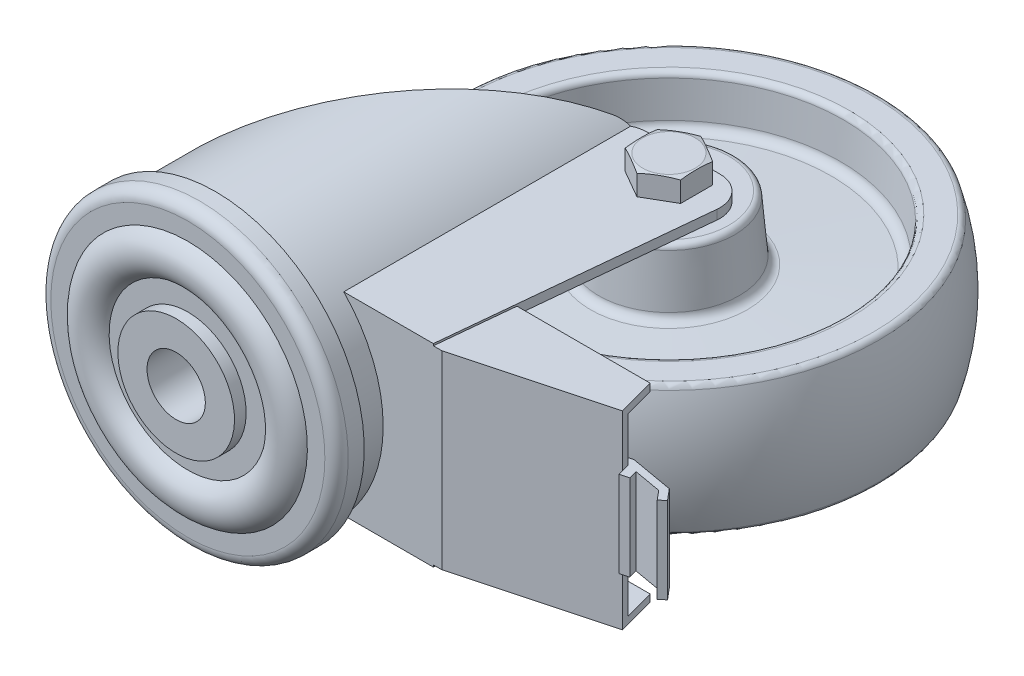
ISO-10303-21;
HEADER;
FILE_DESCRIPTION(('STEP AP214'),'2;1');
FILE_NAME('part.step','',(''),(''),'','','');
FILE_SCHEMA(('AUTOMOTIVE_DESIGN { 1 0 10303 214 1 1 1 1 }'));
ENDSEC;
DATA;
#1=APPLICATION_CONTEXT('core data for automotive mechanical design processes');
#2=APPLICATION_PROTOCOL_DEFINITION('international standard','automotive_design',2000,#1);
#3=PRODUCT_CONTEXT('',#1,'mechanical');
#4=PRODUCT('Part','Part','',(#3));
#5=PRODUCT_RELATED_PRODUCT_CATEGORY('part','',(#4));
#6=PRODUCT_DEFINITION_FORMATION('','',#4);
#7=PRODUCT_DEFINITION_CONTEXT('part definition',#1,'design');
#8=PRODUCT_DEFINITION('design','',#6,#7);
#9=PRODUCT_DEFINITION_SHAPE('','',#8);
#10=(LENGTH_UNIT() NAMED_UNIT(*) SI_UNIT(.MILLI.,.METRE.));
#11=(NAMED_UNIT(*) PLANE_ANGLE_UNIT() SI_UNIT($,.RADIAN.));
#12=(NAMED_UNIT(*) SI_UNIT($,.STERADIAN.) SOLID_ANGLE_UNIT());
#13=UNCERTAINTY_MEASURE_WITH_UNIT(LENGTH_MEASURE(1.E-05),#10,'distance_accuracy_value','');
#14=(GEOMETRIC_REPRESENTATION_CONTEXT(3) GLOBAL_UNCERTAINTY_ASSIGNED_CONTEXT((#13)) GLOBAL_UNIT_ASSIGNED_CONTEXT((#10,
#11,#12)) REPRESENTATION_CONTEXT('',''));
#15=CARTESIAN_POINT('',(0.,0.,0.));
#16=DIRECTION('',(0.,0.,1.));
#17=DIRECTION('',(1.,0.,0.));
#18=AXIS2_PLACEMENT_3D('',#15,#16,#17);
#19=CARTESIAN_POINT('',(55.9999999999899,0.,-113.));
#20=DIRECTION('',(0.,-1.,0.));
#21=DIRECTION('',(-1.,0.,0.));
#22=AXIS2_PLACEMENT_3D('',#19,#20,#21);
#23=SPHERICAL_SURFACE('',#22,74.9999999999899);
#24=CARTESIAN_POINT('',(56.,-21.061643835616,-113.));
#25=DIRECTION('',(0.,-1.,0.));
#26=DIRECTION('',(1.,0.,0.));
#27=AXIS2_PLACEMENT_3D('',#24,#25,#26);
#28=CIRCLE('',#27,71.981991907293);
#29=CARTESIAN_POINT('',(-15.981991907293,-21.061643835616,-113.));
#30=VERTEX_POINT('',#29);
#31=EDGE_CURVE('E1333',#30,#30,#28,.T.);
#32=CARTESIAN_POINT('',(56.,21.061643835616,-113.));
#33=DIRECTION('',(0.,-1.,0.));
#34=DIRECTION('',(1.,0.,0.));
#35=AXIS2_PLACEMENT_3D('',#32,#33,#34);
#36=CIRCLE('',#35,71.981991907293);
#37=CARTESIAN_POINT('',(-15.981991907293,21.061643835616,-113.));
#38=VERTEX_POINT('',#37);
#39=EDGE_CURVE('E1336',#38,#38,#36,.T.);
#40=CARTESIAN_POINT('',(-15.981991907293,-21.061643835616,-113.));
#41=CARTESIAN_POINT('',(-16.1068924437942,-20.6347751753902,-113.));
#42=CARTESIAN_POINT('',(-16.2279949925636,-20.2067952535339,-113.));
#43=CARTESIAN_POINT('',(-16.4625676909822,-19.3487488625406,-113.));
#44=CARTESIAN_POINT('',(-16.5760378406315,-18.9186823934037,-113.));
#45=CARTESIAN_POINT('',(-16.7953093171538,-18.0565988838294,-113.));
#46=CARTESIAN_POINT('',(-16.9011106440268,-17.624581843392,-113.));
#47=CARTESIAN_POINT('',(-17.1050111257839,-16.7587339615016,-113.));
#48=CARTESIAN_POINT('',(-17.2031102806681,-16.3249031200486,-113.));
#49=CARTESIAN_POINT('',(-17.391575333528,-15.4555649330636,-113.));
#50=CARTESIAN_POINT('',(-17.4819412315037,-15.0200575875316,-113.));
#51=CARTESIAN_POINT('',(-17.6549111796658,-14.1475042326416,-113.));
#52=CARTESIAN_POINT('',(-17.7375152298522,-13.7104582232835,-113.));
#53=CARTESIAN_POINT('',(-17.8949353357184,-12.8349658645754,-113.));
#54=CARTESIAN_POINT('',(-17.9697513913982,-12.3965195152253,-113.));
#55=CARTESIAN_POINT('',(-18.1115718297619,-11.5183652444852,-113.));
#56=CARTESIAN_POINT('',(-18.1785762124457,-11.0786573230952,-113.));
#57=CARTESIAN_POINT('',(-18.3047520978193,-10.198119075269,-113.));
#58=CARTESIAN_POINT('',(-18.3639236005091,-9.75728874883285,-113.));
#59=CARTESIAN_POINT('',(-18.4744149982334,-8.87464521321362,-113.));
#60=CARTESIAN_POINT('',(-18.5257348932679,-8.43283200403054,-113.));
#61=CARTESIAN_POINT('',(-18.6205068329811,-7.54836253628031,-113.));
#62=CARTESIAN_POINT('',(-18.6639588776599,-7.10570627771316,-113.));
#63=CARTESIAN_POINT('',(-18.7429813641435,-6.21969081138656,-113.));
#64=CARTESIAN_POINT('',(-18.7785518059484,-5.77633160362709,-113.));
#65=CARTESIAN_POINT('',(-18.8417998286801,-4.88905056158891,-113.));
#66=CARTESIAN_POINT('',(-18.8694774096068,-4.44512872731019,-113.));
#67=CARTESIAN_POINT('',(-18.9169309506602,-3.55686293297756,-113.));
#68=CARTESIAN_POINT('',(-18.9367069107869,-3.11251897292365,-113.));
#69=CARTESIAN_POINT('',(-18.9683509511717,-2.2235495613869,-113.));
#70=CARTESIAN_POINT('',(-18.9802190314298,-1.77892410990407,-113.));
#71=CARTESIAN_POINT('',(-18.996043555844,-0.889532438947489,-113.));
#72=CARTESIAN_POINT('',(-19.,-0.444766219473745,-113.));
#73=CARTESIAN_POINT('',(-19.,0.444766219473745,-113.));
#74=CARTESIAN_POINT('',(-18.996043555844,0.889532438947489,-113.));
#75=CARTESIAN_POINT('',(-18.9802190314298,1.77892410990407,-113.));
#76=CARTESIAN_POINT('',(-18.9683509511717,2.2235495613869,-113.));
#77=CARTESIAN_POINT('',(-18.9367069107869,3.11251897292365,-113.));
#78=CARTESIAN_POINT('',(-18.9169309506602,3.55686293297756,-113.));
#79=CARTESIAN_POINT('',(-18.8694774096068,4.44512872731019,-113.));
#80=CARTESIAN_POINT('',(-18.8417998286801,4.88905056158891,-113.));
#81=CARTESIAN_POINT('',(-18.7785518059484,5.77633160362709,-113.));
#82=CARTESIAN_POINT('',(-18.7429813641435,6.21969081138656,-113.));
#83=CARTESIAN_POINT('',(-18.6639588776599,7.10570627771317,-113.));
#84=CARTESIAN_POINT('',(-18.6205068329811,7.54836253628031,-113.));
#85=CARTESIAN_POINT('',(-18.5257348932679,8.43283200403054,-113.));
#86=CARTESIAN_POINT('',(-18.4744149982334,8.87464521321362,-113.));
#87=CARTESIAN_POINT('',(-18.3639236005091,9.75728874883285,-113.));
#88=CARTESIAN_POINT('',(-18.3047520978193,10.198119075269,-113.));
#89=CARTESIAN_POINT('',(-18.1785762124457,11.0786573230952,-113.));
#90=CARTESIAN_POINT('',(-18.1115718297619,11.5183652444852,-113.));
#91=CARTESIAN_POINT('',(-17.9697513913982,12.3965195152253,-113.));
#92=CARTESIAN_POINT('',(-17.8949353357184,12.8349658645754,-113.));
#93=CARTESIAN_POINT('',(-17.7375152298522,13.7104582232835,-113.));
#94=CARTESIAN_POINT('',(-17.6549111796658,14.1475042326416,-113.));
#95=CARTESIAN_POINT('',(-17.4819412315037,15.0200575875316,-113.));
#96=CARTESIAN_POINT('',(-17.391575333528,15.4555649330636,-113.));
#97=CARTESIAN_POINT('',(-17.2031102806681,16.3249031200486,-113.));
#98=CARTESIAN_POINT('',(-17.1050111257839,16.7587339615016,-113.));
#99=CARTESIAN_POINT('',(-16.9011106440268,17.624581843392,-113.));
#100=CARTESIAN_POINT('',(-16.7953093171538,18.0565988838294,-113.));
#101=CARTESIAN_POINT('',(-16.5760378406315,18.9186823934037,-113.));
#102=CARTESIAN_POINT('',(-16.4625676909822,19.3487488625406,-113.));
#103=CARTESIAN_POINT('',(-16.2279949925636,20.2067952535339,-113.));
#104=CARTESIAN_POINT('',(-16.1068924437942,20.6347751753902,-113.));
#105=CARTESIAN_POINT('',(-15.981991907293,21.061643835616,-113.));
#106=B_SPLINE_CURVE_WITH_KNOTS('',3,(#40,#41,#42,#43,#44,#45,#46,#47,#48,#49,#50,#51,#52,#53,
#54,#55,#56,#57,#58,#59,#60,#61,#62,#63,#64,#65,#66,#67,#68,#69,#70,#71,#72,#73,#74,#75,#76,#77,
#78,#79,#80,#81,#82,#83,#84,#85,#86,#87,#88,#89,#90,#91,#92,#93,#94,#95,#96,#97,#98,#99,#100,
#101,#102,#103,#104,#105),.UNSPECIFIED.,.F.,.F.,(4,2,2,2,2,2,2,2,2,2,2,2,2,2,2,2,2,2,2,2,2,2,2,
2,2,2,2,2,2,2,2,2,4),(0.,1.33428106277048,2.66856212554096,4.00284318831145,5.33712425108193,
6.67140531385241,8.00568637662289,9.33996743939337,10.6742485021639,12.0085295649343,
13.3428106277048,14.6770916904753,16.0113727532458,17.3456538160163,18.6799348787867,
20.0142159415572,21.3484970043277,22.6827780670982,24.0170591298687,25.3513401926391,
26.6856212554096,28.0199023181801,29.3541833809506,30.6884644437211,32.0227455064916,
33.357026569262,34.6913076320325,36.025588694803,37.3598697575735,38.694150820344,
40.0284318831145,41.3627129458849,42.6969940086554),.UNSPECIFIED.);
#107=EDGE_CURVE('BSEAM14',#30,#38,#106,.T.);
#108=ORIENTED_EDGE('',*,*,#31,.F.);
#109=ORIENTED_EDGE('',*,*,#39,.T.);
#110=ORIENTED_EDGE('',*,*,#107,.T.);
#111=ORIENTED_EDGE('',*,*,#107,.F.);
#112=EDGE_LOOP('',(#108,#110,#109,#111));
#113=FACE_BOUND('',#112,.T.);
#114=ADVANCED_FACE('F14',(#113),#23,.T.);
#115=CARTESIAN_POINT('',(56.,20.5000000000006,-113.));
#116=DIRECTION('',(0.,-1.,0.));
#117=DIRECTION('',(1.,0.,0.));
#118=AXIS2_PLACEMENT_3D('',#115,#116,#117);
#119=TOROIDAL_SURFACE('',#118,70.0624721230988,1.99999999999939);
#120=ORIENTED_EDGE('',*,*,#39,.F.);
#121=EDGE_LOOP('',(#120));
#122=FACE_BOUND('',#121,.T.);
#123=CARTESIAN_POINT('',(56.,22.5,-113.));
#124=DIRECTION('',(0.,-1.,0.));
#125=DIRECTION('',(1.,0.,0.));
#126=AXIS2_PLACEMENT_3D('',#123,#124,#125);
#127=CIRCLE('',#126,70.062472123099);
#128=CARTESIAN_POINT('',(126.062472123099,22.5,-113.));
#129=VERTEX_POINT('',#128);
#130=EDGE_CURVE('E1339',#129,#129,#127,.T.);
#131=ORIENTED_EDGE('',*,*,#130,.T.);
#132=EDGE_LOOP('',(#131));
#133=FACE_BOUND('',#132,.T.);
#134=ADVANCED_FACE('F593',(#122,#133),#119,.T.);
#135=CARTESIAN_POINT('',(-5.832662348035,22.5,-113.));
#136=DIRECTION('',(0.,-1.,0.));
#137=DIRECTION('',(1.,0.,0.));
#138=AXIS2_PLACEMENT_3D('',#135,#136,#137);
#139=PLANE('',#138);
#140=ORIENTED_EDGE('',*,*,#130,.F.);
#141=EDGE_LOOP('',(#140));
#142=FACE_BOUND('',#141,.T.);
#143=CARTESIAN_POINT('',(56.,22.5,-113.));
#144=DIRECTION('',(0.,-1.,0.));
#145=DIRECTION('',(1.,0.,0.));
#146=AXIS2_PLACEMENT_3D('',#143,#144,#145);
#147=CIRCLE('',#146,61.832662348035);
#148=CARTESIAN_POINT('',(117.832662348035,22.5,-113.));
#149=VERTEX_POINT('',#148);
#150=EDGE_CURVE('E1342',#149,#149,#147,.T.);
#151=ORIENTED_EDGE('',*,*,#150,.T.);
#152=EDGE_LOOP('',(#151));
#153=FACE_BOUND('',#152,.T.);
#154=ADVANCED_FACE('F600',(#142,#153),#139,.F.);
#155=CARTESIAN_POINT('',(56.,20.499999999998,-113.));
#156=DIRECTION('',(0.,-1.,0.));
#157=DIRECTION('',(1.,0.,0.));
#158=AXIS2_PLACEMENT_3D('',#155,#156,#157);
#159=TOROIDAL_SURFACE('',#158,61.8326623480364,2.00000000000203);
#160=ORIENTED_EDGE('',*,*,#150,.F.);
#161=EDGE_LOOP('',(#160));
#162=FACE_BOUND('',#161,.T.);
#163=CARTESIAN_POINT('',(56.,20.674311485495,-113.));
#164=DIRECTION('',(0.,-1.,0.));
#165=DIRECTION('',(1.,0.,0.));
#166=AXIS2_PLACEMENT_3D('',#163,#164,#165);
#167=CIRCLE('',#166,59.840272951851);
#168=CARTESIAN_POINT('',(115.840272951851,20.674311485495,-113.));
#169=VERTEX_POINT('',#168);
#170=EDGE_CURVE('E1345',#169,#169,#167,.T.);
#171=ORIENTED_EDGE('',*,*,#170,.T.);
#172=EDGE_LOOP('',(#171));
#173=FACE_BOUND('',#172,.T.);
#174=ADVANCED_FACE('F611',(#162,#173),#159,.T.);
#175=CARTESIAN_POINT('',(56.,8.8175433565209,-113.));
#176=DIRECTION('',(0.,1.,0.));
#177=DIRECTION('',(-1.,0.,0.));
#178=AXIS2_PLACEMENT_3D('',#175,#176,#177);
#179=CONICAL_SURFACE('',#178,58.802940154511,0.0872664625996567);
#180=ORIENTED_EDGE('',*,*,#170,.F.);
#181=EDGE_LOOP('',(#180));
#182=FACE_BOUND('',#181,.T.);
#183=CARTESIAN_POINT('',(56.,8.8175433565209,-113.));
#184=DIRECTION('',(0.,-1.,0.));
#185=DIRECTION('',(1.,0.,0.));
#186=AXIS2_PLACEMENT_3D('',#183,#184,#185);
#187=CIRCLE('',#186,58.802940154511);
#188=CARTESIAN_POINT('',(114.802940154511,8.8175433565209,-113.));
#189=VERTEX_POINT('',#188);
#190=EDGE_CURVE('E1348',#189,#189,#187,.T.);
#191=ORIENTED_EDGE('',*,*,#190,.T.);
#192=EDGE_LOOP('',(#191));
#193=FACE_BOUND('',#192,.T.);
#194=ADVANCED_FACE('F615',(#182,#193),#179,.F.);
#195=CARTESIAN_POINT('',(56.,9.07901058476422,-113.));
#196=DIRECTION('',(0.,-1.,0.));
#197=DIRECTION('',(1.,0.,0.));
#198=AXIS2_PLACEMENT_3D('',#195,#196,#197);
#199=TOROIDAL_SURFACE('',#198,55.8143560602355,3.00000000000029);
#200=ORIENTED_EDGE('',*,*,#190,.F.);
#201=EDGE_LOOP('',(#200));
#202=FACE_BOUND('',#201,.T.);
#203=CARTESIAN_POINT('',(56.,6.0831219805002,-113.));
#204=DIRECTION('',(0.,-1.,0.));
#205=DIRECTION('',(1.,0.,0.));
#206=AXIS2_PLACEMENT_3D('',#203,#204,#205);
#207=CIRCLE('',#206,55.657348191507);
#208=CARTESIAN_POINT('',(111.657348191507,6.0831219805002,-113.));
#209=VERTEX_POINT('',#208);
#210=EDGE_CURVE('E1351',#209,#209,#207,.T.);
#211=ORIENTED_EDGE('',*,*,#210,.T.);
#212=EDGE_LOOP('',(#211));
#213=FACE_BOUND('',#212,.T.);
#214=ADVANCED_FACE('F619',(#202,#213),#199,.F.);
#215=CARTESIAN_POINT('',(56.,7.5904002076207,-113.));
#216=DIRECTION('',(0.,-1.,0.));
#217=DIRECTION('',(1.,0.,0.));
#218=AXIS2_PLACEMENT_3D('',#215,#216,#217);
#219=CONICAL_SURFACE('',#218,26.896766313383,1.51843644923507);
#220=ORIENTED_EDGE('',*,*,#210,.F.);
#221=EDGE_LOOP('',(#220));
#222=FACE_BOUND('',#221,.T.);
#223=CARTESIAN_POINT('',(56.,7.5904002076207,-113.));
#224=DIRECTION('',(0.,-1.,0.));
#225=DIRECTION('',(1.,0.,0.));
#226=AXIS2_PLACEMENT_3D('',#223,#224,#225);
#227=CIRCLE('',#226,26.896766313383);
#228=CARTESIAN_POINT('',(82.896766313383,7.5904002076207,-113.));
#229=VERTEX_POINT('',#228);
#230=EDGE_CURVE('E1354',#229,#229,#227,.T.);
#231=ORIENTED_EDGE('',*,*,#230,.T.);
#232=EDGE_LOOP('',(#231));
#233=FACE_BOUND('',#232,.T.);
#234=ADVANCED_FACE('F623',(#222,#233),#219,.T.);
#235=CARTESIAN_POINT('',(56.,10.5862888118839,-113.));
#236=DIRECTION('',(0.,-1.,0.));
#237=DIRECTION('',(1.,0.,0.));
#238=AXIS2_PLACEMENT_3D('',#235,#236,#237);
#239=TOROIDAL_SURFACE('',#238,27.0537741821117,2.99999999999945);
#240=ORIENTED_EDGE('',*,*,#230,.F.);
#241=EDGE_LOOP('',(#240));
#242=FACE_BOUND('',#241,.T.);
#243=CARTESIAN_POINT('',(56.,10.324821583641,-113.));
#244=DIRECTION('',(0.,-1.,0.));
#245=DIRECTION('',(1.,0.,0.));
#246=AXIS2_PLACEMENT_3D('',#243,#244,#245);
#247=CIRCLE('',#246,24.065190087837);
#248=CARTESIAN_POINT('',(80.065190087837,10.324821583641,-113.));
#249=VERTEX_POINT('',#248);
#250=EDGE_CURVE('E1357',#249,#249,#247,.T.);
#251=ORIENTED_EDGE('',*,*,#250,.T.);
#252=EDGE_LOOP('',(#251));
#253=FACE_BOUND('',#252,.T.);
#254=ADVANCED_FACE('F627',(#242,#253),#239,.F.);
#255=CARTESIAN_POINT('',(56.,27.674311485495,-113.));
#256=DIRECTION('',(0.,-1.,0.));
#257=DIRECTION('',(1.,0.,0.));
#258=AXIS2_PLACEMENT_3D('',#255,#256,#257);
#259=CONICAL_SURFACE('',#258,22.547306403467,0.0872664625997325);
#260=ORIENTED_EDGE('',*,*,#250,.F.);
#261=EDGE_LOOP('',(#260));
#262=FACE_BOUND('',#261,.T.);
#263=CARTESIAN_POINT('',(56.,27.674311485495,-113.));
#264=DIRECTION('',(0.,-1.,0.));
#265=DIRECTION('',(1.,0.,0.));
#266=AXIS2_PLACEMENT_3D('',#263,#264,#265);
#267=CIRCLE('',#266,22.547306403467);
#268=CARTESIAN_POINT('',(78.547306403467,27.674311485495,-113.));
#269=VERTEX_POINT('',#268);
#270=EDGE_CURVE('E1360',#269,#269,#267,.T.);
#271=ORIENTED_EDGE('',*,*,#270,.T.);
#272=EDGE_LOOP('',(#271));
#273=FACE_BOUND('',#272,.T.);
#274=ADVANCED_FACE('F631',(#262,#273),#259,.T.);
#275=CARTESIAN_POINT('',(56.,27.5,-113.));
#276=DIRECTION('',(0.,-1.,0.));
#277=DIRECTION('',(1.,0.,0.));
#278=AXIS2_PLACEMENT_3D('',#275,#276,#277);
#279=TOROIDAL_SURFACE('',#278,20.5549170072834,2.00000000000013);
#280=ORIENTED_EDGE('',*,*,#270,.F.);
#281=EDGE_LOOP('',(#280));
#282=FACE_BOUND('',#281,.T.);
#283=CARTESIAN_POINT('',(56.,29.5,-113.));
#284=DIRECTION('',(0.,-1.,0.));
#285=DIRECTION('',(1.,0.,0.));
#286=AXIS2_PLACEMENT_3D('',#283,#284,#285);
#287=CIRCLE('',#286,20.554917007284);
#288=CARTESIAN_POINT('',(76.554917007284,29.5,-113.));
#289=VERTEX_POINT('',#288);
#290=EDGE_CURVE('E1363',#289,#289,#287,.T.);
#291=ORIENTED_EDGE('',*,*,#290,.T.);
#292=EDGE_LOOP('',(#291));
#293=FACE_BOUND('',#292,.T.);
#294=ADVANCED_FACE('F635',(#282,#293),#279,.T.);
#295=CARTESIAN_POINT('',(46.,29.5,-113.));
#296=DIRECTION('',(0.,-1.,0.));
#297=DIRECTION('',(1.,0.,0.));
#298=AXIS2_PLACEMENT_3D('',#295,#296,#297);
#299=PLANE('',#298);
#300=ORIENTED_EDGE('',*,*,#290,.F.);
#301=EDGE_LOOP('',(#300));
#302=FACE_BOUND('',#301,.T.);
#303=CARTESIAN_POINT('',(56.,29.5,-113.));
#304=DIRECTION('',(0.,-1.,0.));
#305=DIRECTION('',(1.,0.,0.));
#306=AXIS2_PLACEMENT_3D('',#303,#304,#305);
#307=CIRCLE('',#306,10.);
#308=CARTESIAN_POINT('',(66.,29.5,-113.));
#309=VERTEX_POINT('',#308);
#310=EDGE_CURVE('E30',#309,#309,#307,.T.);
#311=ORIENTED_EDGE('',*,*,#310,.T.);
#312=EDGE_LOOP('',(#311));
#313=FACE_BOUND('',#312,.T.);
#314=ADVANCED_FACE('F639',(#302,#313),#299,.F.);
#315=CARTESIAN_POINT('',(56.,-20.5000000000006,-113.));
#316=DIRECTION('',(0.,-1.,0.));
#317=DIRECTION('',(1.,0.,0.));
#318=AXIS2_PLACEMENT_3D('',#315,#316,#317);
#319=TOROIDAL_SURFACE('',#318,70.0624721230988,1.9999999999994);
#320=CARTESIAN_POINT('',(56.,-22.5,-113.));
#321=DIRECTION('',(0.,-1.,0.));
#322=DIRECTION('',(1.,0.,0.));
#323=AXIS2_PLACEMENT_3D('',#320,#321,#322);
#324=CIRCLE('',#323,70.062472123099);
#325=CARTESIAN_POINT('',(126.062472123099,-22.5,-113.));
#326=VERTEX_POINT('',#325);
#327=EDGE_CURVE('E1330',#326,#326,#324,.T.);
#328=ORIENTED_EDGE('',*,*,#327,.F.);
#329=EDGE_LOOP('',(#328));
#330=FACE_BOUND('',#329,.T.);
#331=ORIENTED_EDGE('',*,*,#31,.T.);
#332=EDGE_LOOP('',(#331));
#333=FACE_BOUND('',#332,.T.);
#334=ADVANCED_FACE('F606',(#330,#333),#319,.T.);
#335=CARTESIAN_POINT('',(-14.062472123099,-22.5,-113.));
#336=DIRECTION('',(0.,1.,0.));
#337=DIRECTION('',(-1.,0.,0.));
#338=AXIS2_PLACEMENT_3D('',#335,#336,#337);
#339=PLANE('',#338);
#340=CARTESIAN_POINT('',(56.,-22.5,-113.));
#341=DIRECTION('',(0.,-1.,0.));
#342=DIRECTION('',(1.,0.,0.));
#343=AXIS2_PLACEMENT_3D('',#340,#341,#342);
#344=CIRCLE('',#343,61.832662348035);
#345=CARTESIAN_POINT('',(117.832662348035,-22.5,-113.));
#346=VERTEX_POINT('',#345);
#347=EDGE_CURVE('E1327',#346,#346,#344,.T.);
#348=ORIENTED_EDGE('',*,*,#347,.F.);
#349=EDGE_LOOP('',(#348));
#350=FACE_BOUND('',#349,.T.);
#351=ORIENTED_EDGE('',*,*,#327,.T.);
#352=EDGE_LOOP('',(#351));
#353=FACE_BOUND('',#352,.T.);
#354=ADVANCED_FACE('F2002',(#350,#353),#339,.F.);
#355=CARTESIAN_POINT('',(56.,-20.499999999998,-113.));
#356=DIRECTION('',(0.,-1.,0.));
#357=DIRECTION('',(1.,0.,0.));
#358=AXIS2_PLACEMENT_3D('',#355,#356,#357);
#359=TOROIDAL_SURFACE('',#358,61.8326623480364,2.00000000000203);
#360=CARTESIAN_POINT('',(56.,-20.674311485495,-113.));
#361=DIRECTION('',(0.,-1.,0.));
#362=DIRECTION('',(1.,0.,0.));
#363=AXIS2_PLACEMENT_3D('',#360,#361,#362);
#364=CIRCLE('',#363,59.840272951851);
#365=CARTESIAN_POINT('',(115.840272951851,-20.674311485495,-113.));
#366=VERTEX_POINT('',#365);
#367=EDGE_CURVE('E1324',#366,#366,#364,.T.);
#368=ORIENTED_EDGE('',*,*,#367,.F.);
#369=EDGE_LOOP('',(#368));
#370=FACE_BOUND('',#369,.T.);
#371=ORIENTED_EDGE('',*,*,#347,.T.);
#372=EDGE_LOOP('',(#371));
#373=FACE_BOUND('',#372,.T.);
#374=ADVANCED_FACE('F1992',(#370,#373),#359,.T.);
#375=CARTESIAN_POINT('',(56.,-20.674311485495,-113.));
#376=DIRECTION('',(0.,-1.,0.));
#377=DIRECTION('',(1.,0.,0.));
#378=AXIS2_PLACEMENT_3D('',#375,#376,#377);
#379=CONICAL_SURFACE('',#378,59.840272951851,0.0872664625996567);
#380=CARTESIAN_POINT('',(56.,-8.8175433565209,-113.));
#381=DIRECTION('',(0.,-1.,0.));
#382=DIRECTION('',(1.,0.,0.));
#383=AXIS2_PLACEMENT_3D('',#380,#381,#382);
#384=CIRCLE('',#383,58.802940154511);
#385=CARTESIAN_POINT('',(114.802940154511,-8.8175433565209,-113.));
#386=VERTEX_POINT('',#385);
#387=EDGE_CURVE('E1321',#386,#386,#384,.T.);
#388=ORIENTED_EDGE('',*,*,#387,.F.);
#389=EDGE_LOOP('',(#388));
#390=FACE_BOUND('',#389,.T.);
#391=ORIENTED_EDGE('',*,*,#367,.T.);
#392=EDGE_LOOP('',(#391));
#393=FACE_BOUND('',#392,.T.);
#394=ADVANCED_FACE('F1982',(#390,#393),#379,.F.);
#395=CARTESIAN_POINT('',(56.,-9.07901058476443,-113.));
#396=DIRECTION('',(0.,-1.,0.));
#397=DIRECTION('',(1.,0.,0.));
#398=AXIS2_PLACEMENT_3D('',#395,#396,#397);
#399=TOROIDAL_SURFACE('',#398,55.8143560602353,3.00000000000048);
#400=CARTESIAN_POINT('',(56.,-6.0831219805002,-113.));
#401=DIRECTION('',(0.,-1.,0.));
#402=DIRECTION('',(1.,0.,0.));
#403=AXIS2_PLACEMENT_3D('',#400,#401,#402);
#404=CIRCLE('',#403,55.657348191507);
#405=CARTESIAN_POINT('',(111.657348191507,-6.0831219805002,-113.));
#406=VERTEX_POINT('',#405);
#407=EDGE_CURVE('E1318',#406,#406,#404,.T.);
#408=ORIENTED_EDGE('',*,*,#407,.F.);
#409=EDGE_LOOP('',(#408));
#410=FACE_BOUND('',#409,.T.);
#411=ORIENTED_EDGE('',*,*,#387,.T.);
#412=EDGE_LOOP('',(#411));
#413=FACE_BOUND('',#412,.T.);
#414=ADVANCED_FACE('F1972',(#410,#413),#399,.F.);
#415=CARTESIAN_POINT('',(56.,-6.0831219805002,-113.));
#416=DIRECTION('',(0.,1.,0.));
#417=DIRECTION('',(-1.,0.,0.));
#418=AXIS2_PLACEMENT_3D('',#415,#416,#417);
#419=CONICAL_SURFACE('',#418,55.657348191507,1.51843644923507);
#420=CARTESIAN_POINT('',(56.,-7.5904002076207,-113.));
#421=DIRECTION('',(0.,-1.,0.));
#422=DIRECTION('',(1.,0.,0.));
#423=AXIS2_PLACEMENT_3D('',#420,#421,#422);
#424=CIRCLE('',#423,26.896766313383);
#425=CARTESIAN_POINT('',(82.896766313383,-7.5904002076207,-113.));
#426=VERTEX_POINT('',#425);
#427=EDGE_CURVE('E1315',#426,#426,#424,.T.);
#428=ORIENTED_EDGE('',*,*,#427,.F.);
#429=EDGE_LOOP('',(#428));
#430=FACE_BOUND('',#429,.T.);
#431=ORIENTED_EDGE('',*,*,#407,.T.);
#432=EDGE_LOOP('',(#431));
#433=FACE_BOUND('',#432,.T.);
#434=ADVANCED_FACE('F1962',(#430,#433),#419,.T.);
#435=CARTESIAN_POINT('',(56.,-10.5862888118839,-113.));
#436=DIRECTION('',(0.,-1.,0.));
#437=DIRECTION('',(1.,0.,0.));
#438=AXIS2_PLACEMENT_3D('',#435,#436,#437);
#439=TOROIDAL_SURFACE('',#438,27.0537741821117,2.99999999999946);
#440=CARTESIAN_POINT('',(56.,-10.324821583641,-113.));
#441=DIRECTION('',(0.,-1.,0.));
#442=DIRECTION('',(1.,0.,0.));
#443=AXIS2_PLACEMENT_3D('',#440,#441,#442);
#444=CIRCLE('',#443,24.065190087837);
#445=CARTESIAN_POINT('',(80.065190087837,-10.324821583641,-113.));
#446=VERTEX_POINT('',#445);
#447=EDGE_CURVE('E1310',#446,#446,#444,.T.);
#448=ORIENTED_EDGE('',*,*,#447,.F.);
#449=EDGE_LOOP('',(#448));
#450=FACE_BOUND('',#449,.T.);
#451=ORIENTED_EDGE('',*,*,#427,.T.);
#452=EDGE_LOOP('',(#451));
#453=FACE_BOUND('',#452,.T.);
#454=ADVANCED_FACE('F1952',(#450,#453),#439,.F.);
#455=CARTESIAN_POINT('',(56.,-10.324821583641,-113.));
#456=DIRECTION('',(0.,1.,0.));
#457=DIRECTION('',(-1.,0.,0.));
#458=AXIS2_PLACEMENT_3D('',#455,#456,#457);
#459=CONICAL_SURFACE('',#458,24.065190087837,0.0872664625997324);
#460=CARTESIAN_POINT('',(56.,-27.674311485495,-113.));
#461=DIRECTION('',(0.,-1.,0.));
#462=DIRECTION('',(1.,0.,0.));
#463=AXIS2_PLACEMENT_3D('',#460,#461,#462);
#464=CIRCLE('',#463,22.547306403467);
#465=CARTESIAN_POINT('',(78.547306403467,-27.674311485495,-113.));
#466=VERTEX_POINT('',#465);
#467=EDGE_CURVE('E1307',#466,#466,#464,.T.);
#468=ORIENTED_EDGE('',*,*,#467,.F.);
#469=EDGE_LOOP('',(#468));
#470=FACE_BOUND('',#469,.T.);
#471=ORIENTED_EDGE('',*,*,#447,.T.);
#472=EDGE_LOOP('',(#471));
#473=FACE_BOUND('',#472,.T.);
#474=ADVANCED_FACE('F1943',(#470,#473),#459,.T.);
#475=CARTESIAN_POINT('',(56.,-27.5,-113.));
#476=DIRECTION('',(0.,-1.,0.));
#477=DIRECTION('',(1.,0.,0.));
#478=AXIS2_PLACEMENT_3D('',#475,#476,#477);
#479=TOROIDAL_SURFACE('',#478,20.5549170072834,2.00000000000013);
#480=CARTESIAN_POINT('',(56.,-29.5,-113.));
#481=DIRECTION('',(0.,-1.,0.));
#482=DIRECTION('',(1.,0.,0.));
#483=AXIS2_PLACEMENT_3D('',#480,#481,#482);
#484=CIRCLE('',#483,20.554917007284);
#485=CARTESIAN_POINT('',(76.554917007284,-29.5,-113.));
#486=VERTEX_POINT('',#485);
#487=EDGE_CURVE('E914',#486,#486,#484,.T.);
#488=ORIENTED_EDGE('',*,*,#487,.F.);
#489=EDGE_LOOP('',(#488));
#490=FACE_BOUND('',#489,.T.);
#491=ORIENTED_EDGE('',*,*,#467,.T.);
#492=EDGE_LOOP('',(#491));
#493=FACE_BOUND('',#492,.T.);
#494=ADVANCED_FACE('F647',(#490,#493),#479,.T.);
#495=CARTESIAN_POINT('',(35.445082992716,-29.5,-113.));
#496=DIRECTION('',(0.,1.,0.));
#497=DIRECTION('',(-1.,0.,0.));
#498=AXIS2_PLACEMENT_3D('',#495,#496,#497);
#499=PLANE('',#498);
#500=CARTESIAN_POINT('',(56.,-29.5,-113.));
#501=DIRECTION('',(0.,-1.,0.));
#502=DIRECTION('',(1.,0.,0.));
#503=AXIS2_PLACEMENT_3D('',#500,#501,#502);
#504=CIRCLE('',#503,10.);
#505=CARTESIAN_POINT('',(66.,-29.5,-113.));
#506=VERTEX_POINT('',#505);
#507=EDGE_CURVE('E9',#506,#506,#504,.T.);
#508=ORIENTED_EDGE('',*,*,#507,.F.);
#509=EDGE_LOOP('',(#508));
#510=FACE_BOUND('',#509,.T.);
#511=ORIENTED_EDGE('',*,*,#487,.T.);
#512=EDGE_LOOP('',(#511));
#513=FACE_BOUND('',#512,.T.);
#514=ADVANCED_FACE('F644',(#510,#513),#499,.F.);
#515=CARTESIAN_POINT('',(56.,-46.65,-119.));
#516=DIRECTION('',(0.,1.,0.));
#517=DIRECTION('',(1.,0.,0.));
#518=AXIS2_PLACEMENT_3D('',#515,#516,#517);
#519=PLANE('',#518);
#520=CARTESIAN_POINT('',(56.,-46.65,-113.));
#521=DIRECTION('',(0.,1.,0.));
#522=DIRECTION('',(1.,0.,0.));
#523=AXIS2_PLACEMENT_3D('',#520,#521,#522);
#524=CIRCLE('',#523,6.);
#525=CARTESIAN_POINT('',(62.,-46.65,-113.));
#526=VERTEX_POINT('',#525);
#527=EDGE_CURVE('E447',#526,#526,#524,.T.);
#528=ORIENTED_EDGE('',*,*,#527,.F.);
#529=EDGE_LOOP('',(#528));
#530=FACE_BOUND('',#529,.T.);
#531=ADVANCED_FACE('F436',(#530),#519,.F.);
#532=CARTESIAN_POINT('',(56.,-46.65,-113.));
#533=DIRECTION('',(0.,1.,0.));
#534=DIRECTION('',(1.,0.,0.));
#535=AXIS2_PLACEMENT_3D('',#532,#533,#534);
#536=CYLINDRICAL_SURFACE('',#535,6.);
#537=ORIENTED_EDGE('',*,*,#527,.T.);
#538=EDGE_LOOP('',(#537));
#539=FACE_BOUND('',#538,.T.);
#540=CARTESIAN_POINT('',(56.,-43.2,-113.));
#541=DIRECTION('',(0.,1.,0.));
#542=DIRECTION('',(1.,0.,0.));
#543=AXIS2_PLACEMENT_3D('',#540,#541,#542);
#544=CIRCLE('',#543,6.);
#545=CARTESIAN_POINT('',(62.,-43.2,-113.));
#546=VERTEX_POINT('',#545);
#547=EDGE_CURVE('E460',#546,#546,#544,.T.);
#548=ORIENTED_EDGE('',*,*,#547,.F.);
#549=EDGE_LOOP('',(#548));
#550=FACE_BOUND('',#549,.T.);
#551=ADVANCED_FACE('F771',(#539,#550),#536,.T.);
#552=CARTESIAN_POINT('',(0.,0.,-8.125));
#553=DIRECTION('',(0.,0.,1.));
#554=DIRECTION('',(0.,1.,0.));
#555=AXIS2_PLACEMENT_3D('',#552,#553,#554);
#556=TOROIDAL_SURFACE('',#555,34.,8.125);
#557=CARTESIAN_POINT('',(0.,0.,-4.));
#558=DIRECTION('',(0.,0.,1.));
#559=DIRECTION('',(0.,1.,0.));
#560=AXIS2_PLACEMENT_3D('',#557,#558,#559);
#561=CIRCLE('',#560,27.);
#562=CARTESIAN_POINT('',(0.,27.,-4.));
#563=VERTEX_POINT('',#562);
#564=EDGE_CURVE('E1119',#563,#563,#561,.T.);
#565=ORIENTED_EDGE('',*,*,#564,.F.);
#566=EDGE_LOOP('',(#565));
#567=FACE_BOUND('',#566,.T.);
#568=CARTESIAN_POINT('',(0.,0.,-4.));
#569=DIRECTION('',(0.,0.,1.));
#570=DIRECTION('',(0.,1.,0.));
#571=AXIS2_PLACEMENT_3D('',#568,#569,#570);
#572=CIRCLE('',#571,41.);
#573=CARTESIAN_POINT('',(0.,41.,-4.));
#574=VERTEX_POINT('',#573);
#575=EDGE_CURVE('E1116',#574,#574,#572,.T.);
#576=ORIENTED_EDGE('',*,*,#575,.T.);
#577=EDGE_LOOP('',(#576));
#578=FACE_BOUND('',#577,.T.);
#579=ADVANCED_FACE('F768',(#567,#578),#556,.T.);
#580=CARTESIAN_POINT('',(56.,-43.2,-119.));
#581=DIRECTION('',(0.,1.,0.));
#582=DIRECTION('',(1.,0.,0.));
#583=AXIS2_PLACEMENT_3D('',#580,#581,#582);
#584=PLANE('',#583);
#585=CARTESIAN_POINT('',(56.,-43.2,-113.));
#586=DIRECTION('',(0.,1.,0.));
#587=DIRECTION('',(1.,0.,0.));
#588=AXIS2_PLACEMENT_3D('',#585,#586,#587);
#589=CIRCLE('',#588,9.);
#590=CARTESIAN_POINT('',(65.,-43.2,-113.));
#591=VERTEX_POINT('',#590);
#592=EDGE_CURVE('E1217',#591,#591,#589,.T.);
#593=ORIENTED_EDGE('',*,*,#592,.F.);
#594=EDGE_LOOP('',(#593));
#595=FACE_BOUND('',#594,.T.);
#596=ORIENTED_EDGE('',*,*,#547,.T.);
#597=EDGE_LOOP('',(#596));
#598=FACE_BOUND('',#597,.T.);
#599=ADVANCED_FACE('F515',(#595,#598),#584,.F.);
#600=CARTESIAN_POINT('',(-41.,0.,-4.));
#601=DIRECTION('',(0.,0.,-1.));
#602=DIRECTION('',(0.,-1.,0.));
#603=AXIS2_PLACEMENT_3D('',#600,#601,#602);
#604=PLANE('',#603);
#605=ORIENTED_EDGE('',*,*,#575,.F.);
#606=EDGE_LOOP('',(#605));
#607=FACE_BOUND('',#606,.T.);
#608=CARTESIAN_POINT('',(0.,0.,-4.));
#609=DIRECTION('',(0.,0.,1.));
#610=DIRECTION('',(0.,1.,0.));
#611=AXIS2_PLACEMENT_3D('',#608,#609,#610);
#612=CIRCLE('',#611,47.000000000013);
#613=CARTESIAN_POINT('',(0.,47.000000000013,-4.));
#614=VERTEX_POINT('',#613);
#615=EDGE_CURVE('E1113',#614,#614,#612,.T.);
#616=ORIENTED_EDGE('',*,*,#615,.T.);
#617=EDGE_LOOP('',(#616));
#618=FACE_BOUND('',#617,.T.);
#619=ADVANCED_FACE('F763',(#607,#618),#604,.F.);
#620=CARTESIAN_POINT('',(-20.,0.,-4.));
#621=DIRECTION('',(0.,0.,-1.));
#622=DIRECTION('',(0.,-1.,0.));
#623=AXIS2_PLACEMENT_3D('',#620,#621,#622);
#624=PLANE('',#623);
#625=CARTESIAN_POINT('',(0.,0.,-4.));
#626=DIRECTION('',(0.,0.,1.));
#627=DIRECTION('',(0.,1.,0.));
#628=AXIS2_PLACEMENT_3D('',#625,#626,#627);
#629=CIRCLE('',#628,20.);
#630=CARTESIAN_POINT('',(0.,20.,-4.));
#631=VERTEX_POINT('',#630);
#632=EDGE_CURVE('E1122',#631,#631,#629,.T.);
#633=ORIENTED_EDGE('',*,*,#632,.F.);
#634=EDGE_LOOP('',(#633));
#635=FACE_BOUND('',#634,.T.);
#636=ORIENTED_EDGE('',*,*,#564,.T.);
#637=EDGE_LOOP('',(#636));
#638=FACE_BOUND('',#637,.T.);
#639=ADVANCED_FACE('F766',(#635,#638),#624,.F.);
#640=CARTESIAN_POINT('',(56.,-43.2,-113.));
#641=DIRECTION('',(0.,1.,0.));
#642=DIRECTION('',(1.,0.,0.));
#643=AXIS2_PLACEMENT_3D('',#640,#641,#642);
#644=CONICAL_SURFACE('',#643,9.,1.30899693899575);
#645=CARTESIAN_POINT('',(46.5,-40.9684484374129,-98.5079771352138));
#646=CARTESIAN_POINT('',(46.4999999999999,-41.0649599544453,-98.9387711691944));
#647=CARTESIAN_POINT('',(46.4999999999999,-41.1602882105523,-99.3698351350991));
#648=CARTESIAN_POINT('',(46.4999999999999,-41.3479395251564,-100.232635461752));
#649=CARTESIAN_POINT('',(46.4999999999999,-41.4402624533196,-100.664371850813));
#650=CARTESIAN_POINT('',(46.4999999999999,-41.6213452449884,-101.529038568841));
#651=CARTESIAN_POINT('',(46.5,-41.7101015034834,-101.96196965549));
#652=CARTESIAN_POINT('',(46.5,-41.8830901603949,-102.828734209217));
#653=CARTESIAN_POINT('',(46.5,-41.9673225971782,-103.26256766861));
#654=CARTESIAN_POINT('',(46.5,-42.1295343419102,-104.127816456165));
#655=CARTESIAN_POINT('',(46.5,-42.2075582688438,-104.559223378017));
#656=CARTESIAN_POINT('',(46.5,-42.3567772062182,-105.423226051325));
#657=CARTESIAN_POINT('',(46.5,-42.427972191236,-105.8558218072));
#658=CARTESIAN_POINT('',(46.5,-42.5619234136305,-106.722267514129));
#659=CARTESIAN_POINT('',(46.5,-42.6246808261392,-107.156117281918));
#660=CARTESIAN_POINT('',(46.5,-42.7399054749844,-108.025196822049));
#661=CARTESIAN_POINT('',(46.5,-42.7923727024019,-108.460426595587));
#662=CARTESIAN_POINT('',(46.5,-42.885527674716,-109.337170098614));
#663=CARTESIAN_POINT('',(46.5,-42.9260746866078,-109.778699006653));
#664=CARTESIAN_POINT('',(46.5,-42.9925896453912,-110.662863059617));
#665=CARTESIAN_POINT('',(46.5,-43.0185579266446,-111.105498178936));
#666=CARTESIAN_POINT('',(46.5,-43.0544006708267,-111.991232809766));
#667=CARTESIAN_POINT('',(46.5,-43.0642823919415,-112.434332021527));
#668=CARTESIAN_POINT('',(46.5000000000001,-43.0673449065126,-113.320589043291));
#669=CARTESIAN_POINT('',(46.5000000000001,-43.0605257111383,-113.763746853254));
#670=CARTESIAN_POINT('',(46.5000000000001,-43.0305697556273,-114.651117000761));
#671=CARTESIAN_POINT('',(46.5000000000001,-43.0073735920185,-115.095327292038));
#672=CARTESIAN_POINT('',(46.5000000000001,-42.9459858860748,-115.98270090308));
#673=CARTESIAN_POINT('',(46.5000000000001,-42.9077940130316,-116.425864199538));
#674=CARTESIAN_POINT('',(46.5000000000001,-42.8183397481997,-117.311140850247));
#675=CARTESIAN_POINT('',(46.5000000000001,-42.7670688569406,-117.753253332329));
#676=CARTESIAN_POINT('',(46.5000000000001,-42.6535847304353,-118.636056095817));
#677=CARTESIAN_POINT('',(46.5,-42.5913714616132,-119.076746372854));
#678=CARTESIAN_POINT('',(46.5,-42.462351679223,-119.927958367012));
#679=CARTESIAN_POINT('',(46.5000000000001,-42.3961122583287,-120.338566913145));
#680=CARTESIAN_POINT('',(46.5000000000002,-42.257214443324,-121.158702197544));
#681=CARTESIAN_POINT('',(46.5000000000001,-42.1845558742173,-121.568228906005));
#682=CARTESIAN_POINT('',(46.5000000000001,-42.0339919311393,-122.386354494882));
#683=CARTESIAN_POINT('',(46.5000000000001,-41.9560860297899,-122.794953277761));
#684=CARTESIAN_POINT('',(46.5000000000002,-41.7959946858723,-123.611304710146));
#685=CARTESIAN_POINT('',(46.5000000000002,-41.7138092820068,-124.01905736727));
#686=CARTESIAN_POINT('',(46.5000000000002,-41.5459125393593,-124.833934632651));
#687=CARTESIAN_POINT('',(46.5000000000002,-41.4602003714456,-125.241059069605));
#688=CARTESIAN_POINT('',(46.5000000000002,-41.2858819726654,-126.054688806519));
#689=CARTESIAN_POINT('',(46.5000000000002,-41.1972757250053,-126.461194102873));
#690=CARTESIAN_POINT('',(46.5000000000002,-40.9278968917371,-127.679865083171));
#691=CARTESIAN_POINT('',(46.5000000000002,-40.7435527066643,-128.491240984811));
#692=CARTESIAN_POINT('',(46.5000000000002,-40.3700754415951,-130.104435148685));
#693=CARTESIAN_POINT('',(46.5000000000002,-40.1810076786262,-130.906268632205));
#694=CARTESIAN_POINT('',(46.5000000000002,-39.7981405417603,-132.508818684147));
#695=CARTESIAN_POINT('',(46.5000000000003,-39.6043410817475,-133.309535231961));
#696=CARTESIAN_POINT('',(46.5000000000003,-39.2134911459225,-134.909127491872));
#697=CARTESIAN_POINT('',(46.5000000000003,-39.0164449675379,-135.708004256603));
#698=CARTESIAN_POINT('',(46.5000000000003,-38.6196652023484,-137.30506264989));
#699=CARTESIAN_POINT('',(46.5000000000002,-38.4199317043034,-138.103244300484));
#700=CARTESIAN_POINT('',(46.5,-38.2192459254,-138.901183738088));
#701=B_SPLINE_CURVE_WITH_KNOTS('',3,(#645,#646,#647,#648,#649,#650,#651,#652,#653,#654,#655,
#656,#657,#658,#659,#660,#661,#662,#663,#664,#665,#666,#667,#668,#669,#670,#671,#672,#673,#674,
#675,#676,#677,#678,#679,#680,#681,#682,#683,#684,#685,#686,#687,#688,#689,#690,#691,#692,#693,
#694,#695,#696,#697,#698,#699,#700),.UNSPECIFIED.,.F.,.F.,(4,2,2,2,2,2,2,2,2,2,2,2,2,2,2,2,2,2,
2,2,2,2,2,2,2,2,2,4),(0.,1.32442292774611,2.64890321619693,3.9746901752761,5.3004658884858,
6.61563949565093,7.93081799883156,9.24581314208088,10.5608094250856,11.8907589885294,
13.2206780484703,14.5499968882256,15.879314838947,17.2134795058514,18.5476735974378,
19.8827369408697,21.2178043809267,22.4654956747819,23.7132209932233,24.9610719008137,
26.2089115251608,27.4570462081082,28.7051881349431,31.2013030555,33.6727539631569,
36.1442498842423,38.6127022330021,41.0810732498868),.UNSPECIFIED.);
#702=CARTESIAN_POINT('',(46.5,-42.6722325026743,-107.515172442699));
#703=VERTEX_POINT('',#702);
#704=CARTESIAN_POINT('',(46.5,-42.6722325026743,-118.484827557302));
#705=VERTEX_POINT('',#704);
#706=EDGE_CURVE('E463',#703,#705,#701,.T.);
#707=ORIENTED_EDGE('',*,*,#706,.T.);
#708=CARTESIAN_POINT('',(38.5962404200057,-40.9416858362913,-113.921589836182));
#709=CARTESIAN_POINT('',(38.9863087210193,-41.0428364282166,-114.146795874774));
#710=CARTESIAN_POINT('',(39.3766281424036,-41.1427211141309,-114.37214689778));
#711=CARTESIAN_POINT('',(40.1579009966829,-41.3392344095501,-114.823214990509));
#712=CARTESIAN_POINT('',(40.5488544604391,-41.4358628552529,-115.048932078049));
#713=CARTESIAN_POINT('',(41.3322050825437,-41.6253025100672,-115.501199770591));
#714=CARTESIAN_POINT('',(41.7246035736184,-41.7181063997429,-115.727751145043));
#715=CARTESIAN_POINT('',(42.5102622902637,-41.8987129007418,-116.181351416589));
#716=CARTESIAN_POINT('',(42.9035225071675,-41.9865155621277,-116.40840030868));
#717=CARTESIAN_POINT('',(43.6861145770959,-42.1548014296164,-116.860230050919));
#718=CARTESIAN_POINT('',(44.0754337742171,-42.235362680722,-117.085003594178));
#719=CARTESIAN_POINT('',(44.8552083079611,-42.3888609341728,-117.535206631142));
#720=CARTESIAN_POINT('',(45.2456636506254,-42.4617978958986,-117.760636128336));
#721=CARTESIAN_POINT('',(46.0275416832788,-42.5981383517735,-118.212053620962));
#722=CARTESIAN_POINT('',(46.41896345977,-42.661548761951,-118.438041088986));
#723=CARTESIAN_POINT('',(47.2031025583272,-42.7767483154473,-118.89076400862));
#724=CARTESIAN_POINT('',(47.5958198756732,-42.8285375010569,-119.117499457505));
#725=CARTESIAN_POINT('',(48.3864135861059,-42.9186622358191,-119.573948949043));
#726=CARTESIAN_POINT('',(48.7843021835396,-42.956857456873,-119.803670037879));
#727=CARTESIAN_POINT('',(49.5810125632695,-43.0169250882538,-120.263650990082));
#728=CARTESIAN_POINT('',(49.9798343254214,-43.0387978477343,-120.493910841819));
#729=CARTESIAN_POINT('',(50.7781027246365,-43.0648002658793,-120.954791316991));
#730=CARTESIAN_POINT('',(51.1775495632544,-43.068921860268,-121.185412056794));
#731=CARTESIAN_POINT('',(51.9762645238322,-43.0591115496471,-121.64655035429));
#732=CARTESIAN_POINT('',(52.3755326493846,-43.045180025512,-121.877067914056));
#733=CARTESIAN_POINT('',(53.1778148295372,-42.9999611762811,-122.340265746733));
#734=CARTESIAN_POINT('',(53.5808205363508,-42.9684805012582,-122.572941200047));
#735=CARTESIAN_POINT('',(54.3857302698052,-42.8899687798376,-123.03765605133));
#736=CARTESIAN_POINT('',(54.7876341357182,-42.8429355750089,-123.269695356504));
#737=CARTESIAN_POINT('',(55.5901041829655,-42.7357315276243,-123.733001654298));
#738=CARTESIAN_POINT('',(55.9906703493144,-42.6755605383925,-123.964268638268));
#739=CARTESIAN_POINT('',(56.7903159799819,-42.5444369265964,-124.42594425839));
#740=CARTESIAN_POINT('',(57.1893959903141,-42.4734887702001,-124.656353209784));
#741=CARTESIAN_POINT('',(57.5878262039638,-42.3983035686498,-124.886387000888));
#742=B_SPLINE_CURVE_WITH_KNOTS('',3,(#708,#709,#710,#711,#712,#713,#714,#715,#716,#717,#718,
#719,#720,#721,#722,#723,#724,#725,#726,#727,#728,#729,#730,#731,#732,#733,#734,#735,#736,#737,
#738,#739,#740,#741),.UNSPECIFIED.,.F.,.F.,(4,2,2,2,2,2,2,2,2,2,2,2,2,2,2,2,4),(0.,
1.38489721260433,2.7698639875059,4.15736866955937,5.54485946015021,6.91493317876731,
8.28501419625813,9.65409571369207,11.02317224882,12.4059974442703,13.788793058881,
15.1722168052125,16.5556113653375,17.9545577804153,19.3536984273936,20.7528546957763,
22.151432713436),.UNSPECIFIED.);
#743=CARTESIAN_POINT('',(56.,-42.6722325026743,-123.969655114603));
#744=VERTEX_POINT('',#743);
#745=EDGE_CURVE('E18',#705,#744,#742,.T.);
#746=ORIENTED_EDGE('',*,*,#745,.T.);
#747=CARTESIAN_POINT('',(52.0856954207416,-41.9147802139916,-126.229579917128));
#748=CARTESIAN_POINT('',(52.432428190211,-41.9925386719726,-126.029393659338));
#749=CARTESIAN_POINT('',(52.7795210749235,-42.0682345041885,-125.828999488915));
#750=CARTESIAN_POINT('',(53.4745772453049,-42.2144150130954,-125.427708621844));
#751=CARTESIAN_POINT('',(53.8225406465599,-42.2848989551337,-125.226811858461));
#752=CARTESIAN_POINT('',(54.5202384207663,-42.4197111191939,-124.82399586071));
#753=CARTESIAN_POINT('',(54.8699750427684,-42.4840239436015,-124.622075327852));
#754=CARTESIAN_POINT('',(55.5704445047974,-42.6049222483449,-124.21765909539));
#755=CARTESIAN_POINT('',(55.9211773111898,-42.6615079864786,-124.015163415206));
#756=CARTESIAN_POINT('',(56.6191995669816,-42.764745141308,-123.612160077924));
#757=CARTESIAN_POINT('',(56.966475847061,-42.8115141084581,-123.411660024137));
#758=CARTESIAN_POINT('',(57.6619892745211,-42.8944374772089,-123.010105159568));
#759=CARTESIAN_POINT('',(58.0102264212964,-42.9305918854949,-122.809050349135));
#760=CARTESIAN_POINT('',(58.7070885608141,-42.9907630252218,-122.406716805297));
#761=CARTESIAN_POINT('',(59.0557126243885,-43.0147938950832,-122.205438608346));
#762=CARTESIAN_POINT('',(59.7534590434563,-43.0496323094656,-121.802594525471));
#763=CARTESIAN_POINT('',(60.1025813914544,-43.0604400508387,-121.601028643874));
#764=CARTESIAN_POINT('',(60.8012861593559,-43.0682707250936,-121.197631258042));
#765=CARTESIAN_POINT('',(61.1508686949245,-43.0652801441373,-120.995799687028));
#766=CARTESIAN_POINT('',(61.8497447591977,-43.0456433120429,-120.59230340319));
#767=CARTESIAN_POINT('',(62.1990382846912,-43.0289969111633,-120.39063869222));
#768=CARTESIAN_POINT('',(62.8973811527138,-42.9828684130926,-119.98745024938));
#769=CARTESIAN_POINT('',(63.2464297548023,-42.9533716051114,-119.785926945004));
#770=CARTESIAN_POINT('',(63.943643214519,-42.882873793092,-119.383390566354));
#771=CARTESIAN_POINT('',(64.2918080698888,-42.8418727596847,-119.182377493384));
#772=CARTESIAN_POINT('',(64.9915843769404,-42.7493381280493,-118.778361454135));
#773=CARTESIAN_POINT('',(65.3431829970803,-42.6976765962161,-118.575365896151));
#774=CARTESIAN_POINT('',(66.0453599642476,-42.5857681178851,-118.169963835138));
#775=CARTESIAN_POINT('',(66.3959382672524,-42.5255208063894,-117.967557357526));
#776=CARTESIAN_POINT('',(67.0953107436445,-42.3980793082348,-117.563774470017));
#777=CARTESIAN_POINT('',(67.4441071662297,-42.3309014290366,-117.362396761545));
#778=CARTESIAN_POINT('',(68.1407612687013,-42.1907144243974,-116.960183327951));
#779=CARTESIAN_POINT('',(68.4886190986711,-42.1177062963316,-116.759347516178));
#780=CARTESIAN_POINT('',(68.8360847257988,-42.0423861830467,-116.558738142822));
#781=B_SPLINE_CURVE_WITH_KNOTS('',3,(#747,#748,#749,#750,#751,#752,#753,#754,#755,#756,#757,
#758,#759,#760,#761,#762,#763,#764,#765,#766,#767,#768,#769,#770,#771,#772,#773,#774,#775,#776,
#777,#778,#779,#780),.UNSPECIFIED.,.F.,.F.,(4,2,2,2,2,2,2,2,2,2,2,2,2,2,2,2,4),(0.,
1.22357769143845,2.44732752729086,3.67405540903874,4.90074235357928,6.11177653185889,
7.32280994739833,8.5324277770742,9.74202759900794,10.9528123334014,12.1636103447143,
13.3757981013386,14.5879889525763,15.8156746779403,17.0434126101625,18.2683248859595,
19.493028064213),.UNSPECIFIED.);
#782=CARTESIAN_POINT('',(65.5,-42.6722325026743,-118.484827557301));
#783=VERTEX_POINT('',#782);
#784=EDGE_CURVE('E559',#744,#783,#781,.T.);
#785=ORIENTED_EDGE('',*,*,#784,.T.);
#786=CARTESIAN_POINT('',(65.5,-40.9684484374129,-98.5079771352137));
#787=CARTESIAN_POINT('',(65.5,-41.0649599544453,-98.9387711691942));
#788=CARTESIAN_POINT('',(65.4999999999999,-41.1602882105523,-99.369835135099));
#789=CARTESIAN_POINT('',(65.4999999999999,-41.3479395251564,-100.232635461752));
#790=CARTESIAN_POINT('',(65.4999999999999,-41.4402624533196,-100.664371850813));
#791=CARTESIAN_POINT('',(65.4999999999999,-41.6213452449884,-101.529038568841));
#792=CARTESIAN_POINT('',(65.4999999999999,-41.7101015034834,-101.96196965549));
#793=CARTESIAN_POINT('',(65.4999999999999,-41.8830901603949,-102.828734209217));
#794=CARTESIAN_POINT('',(65.5,-41.9673225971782,-103.26256766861));
#795=CARTESIAN_POINT('',(65.5,-42.1295343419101,-104.127816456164));
#796=CARTESIAN_POINT('',(65.5,-42.2075582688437,-104.559223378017));
#797=CARTESIAN_POINT('',(65.5,-42.3567772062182,-105.423226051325));
#798=CARTESIAN_POINT('',(65.5,-42.4279721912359,-105.855821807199));
#799=CARTESIAN_POINT('',(65.5,-42.5619234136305,-106.722267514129));
#800=CARTESIAN_POINT('',(65.5,-42.6246808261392,-107.156117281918));
#801=CARTESIAN_POINT('',(65.5,-42.7399054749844,-108.025196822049));
#802=CARTESIAN_POINT('',(65.5,-42.7923727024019,-108.460426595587));
#803=CARTESIAN_POINT('',(65.5,-42.885527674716,-109.337170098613));
#804=CARTESIAN_POINT('',(65.5,-42.9260746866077,-109.778699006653));
#805=CARTESIAN_POINT('',(65.5,-42.9925896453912,-110.662863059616));
#806=CARTESIAN_POINT('',(65.5,-43.0185579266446,-111.105498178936));
#807=CARTESIAN_POINT('',(65.5,-43.0544006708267,-111.991232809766));
#808=CARTESIAN_POINT('',(65.5,-43.0642823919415,-112.434332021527));
#809=CARTESIAN_POINT('',(65.5,-43.0673449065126,-113.320589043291));
#810=CARTESIAN_POINT('',(65.5,-43.0605257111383,-113.763746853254));
#811=CARTESIAN_POINT('',(65.5,-43.0305697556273,-114.651117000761));
#812=CARTESIAN_POINT('',(65.5,-43.0073735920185,-115.095327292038));
#813=CARTESIAN_POINT('',(65.5,-42.9459858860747,-115.98270090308));
#814=CARTESIAN_POINT('',(65.5,-42.9077940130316,-116.425864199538));
#815=CARTESIAN_POINT('',(65.5,-42.8183397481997,-117.311140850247));
#816=CARTESIAN_POINT('',(65.5,-42.7670688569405,-117.753253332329));
#817=CARTESIAN_POINT('',(65.5,-42.6535847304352,-118.636056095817));
#818=CARTESIAN_POINT('',(65.5,-42.5913714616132,-119.076746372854));
#819=CARTESIAN_POINT('',(65.5,-42.462351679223,-119.927958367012));
#820=CARTESIAN_POINT('',(65.5,-42.3961122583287,-120.338566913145));
#821=CARTESIAN_POINT('',(65.5,-42.257214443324,-121.158702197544));
#822=CARTESIAN_POINT('',(65.5,-42.1845558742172,-121.568228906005));
#823=CARTESIAN_POINT('',(65.5,-42.0339919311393,-122.386354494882));
#824=CARTESIAN_POINT('',(65.5,-41.9560860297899,-122.794953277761));
#825=CARTESIAN_POINT('',(65.5,-41.7959946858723,-123.611304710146));
#826=CARTESIAN_POINT('',(65.5,-41.7138092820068,-124.01905736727));
#827=CARTESIAN_POINT('',(65.5,-41.5459125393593,-124.833934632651));
#828=CARTESIAN_POINT('',(65.5,-41.4602003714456,-125.241059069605));
#829=CARTESIAN_POINT('',(65.5,-41.2858819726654,-126.054688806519));
#830=CARTESIAN_POINT('',(65.5,-41.1972757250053,-126.461194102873));
#831=CARTESIAN_POINT('',(65.5,-40.9278968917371,-127.679865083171));
#832=CARTESIAN_POINT('',(65.5,-40.7435527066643,-128.49124098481));
#833=CARTESIAN_POINT('',(65.5,-40.3700754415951,-130.104435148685));
#834=CARTESIAN_POINT('',(65.5,-40.1810076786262,-130.906268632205));
#835=CARTESIAN_POINT('',(65.5,-39.7981405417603,-132.508818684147));
#836=CARTESIAN_POINT('',(65.5000000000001,-39.6043410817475,-133.30953523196));
#837=CARTESIAN_POINT('',(65.5000000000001,-39.2134911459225,-134.909127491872));
#838=CARTESIAN_POINT('',(65.5000000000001,-39.0164449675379,-135.708004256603));
#839=CARTESIAN_POINT('',(65.5000000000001,-38.6196652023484,-137.30506264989));
#840=CARTESIAN_POINT('',(65.5,-38.4199317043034,-138.103244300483));
#841=CARTESIAN_POINT('',(65.5,-38.2192459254,-138.901183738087));
#842=B_SPLINE_CURVE_WITH_KNOTS('',3,(#786,#787,#788,#789,#790,#791,#792,#793,#794,#795,#796,
#797,#798,#799,#800,#801,#802,#803,#804,#805,#806,#807,#808,#809,#810,#811,#812,#813,#814,#815,
#816,#817,#818,#819,#820,#821,#822,#823,#824,#825,#826,#827,#828,#829,#830,#831,#832,#833,#834,
#835,#836,#837,#838,#839,#840,#841),.UNSPECIFIED.,.F.,.F.,(4,2,2,2,2,2,2,2,2,2,2,2,2,2,2,2,2,2,
2,2,2,2,2,2,2,2,2,4),(0.,1.3244229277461,2.6489032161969,3.97469017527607,5.30046588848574,
6.61563949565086,7.93081799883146,9.24581314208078,10.5608094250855,11.8907589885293,
13.2206780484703,14.5499968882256,15.8793148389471,17.2134795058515,18.5476735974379,
19.8827369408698,21.2178043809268,22.465495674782,23.7132209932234,24.9610719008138,
26.2089115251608,27.4570462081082,28.7051881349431,31.2013030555,33.6727539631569,
36.1442498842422,38.612702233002,41.0810732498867),.UNSPECIFIED.);
#843=CARTESIAN_POINT('',(65.5,-42.6722325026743,-107.515172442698));
#844=VERTEX_POINT('',#843);
#845=EDGE_CURVE('E566',#783,#844,#842,.F.);
#846=ORIENTED_EDGE('',*,*,#845,.T.);
#847=CARTESIAN_POINT('',(67.088354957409,-42.3982037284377,-108.432209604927));
#848=CARTESIAN_POINT('',(66.6899253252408,-42.4733927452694,-108.202176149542));
#849=CARTESIAN_POINT('',(66.2908459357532,-42.5443451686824,-107.971767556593));
#850=CARTESIAN_POINT('',(65.4912015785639,-42.675478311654,-107.510092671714));
#851=CARTESIAN_POINT('',(65.0906360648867,-42.7356545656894,-107.278826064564));
#852=CARTESIAN_POINT('',(64.2881669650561,-42.8428702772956,-106.815520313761));
#853=CARTESIAN_POINT('',(63.8862633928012,-42.8899098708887,-106.583481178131));
#854=CARTESIAN_POINT('',(63.0813541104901,-42.9684353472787,-106.118766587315));
#855=CARTESIAN_POINT('',(62.6783485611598,-42.9999233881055,-105.886091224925));
#856=CARTESIAN_POINT('',(61.8760668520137,-43.0451575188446,-105.422893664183));
#857=CARTESIAN_POINT('',(61.4767990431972,-43.0590969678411,-105.192376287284));
#858=CARTESIAN_POINT('',(60.6780844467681,-43.0689232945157,-104.73123820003));
#859=CARTESIAN_POINT('',(60.2786376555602,-43.0648097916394,-104.5006174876));
#860=CARTESIAN_POINT('',(59.4803692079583,-43.0388231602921,-104.039736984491));
#861=CARTESIAN_POINT('',(59.0815473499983,-43.0169581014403,-103.809477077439));
#862=CARTESIAN_POINT('',(58.2848365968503,-42.9569050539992,-103.349495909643));
#863=CARTESIAN_POINT('',(57.8869477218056,-42.9187167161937,-103.119774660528));
#864=CARTESIAN_POINT('',(57.0963531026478,-42.828604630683,-102.663324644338));
#865=CARTESIAN_POINT('',(56.7036351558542,-42.7768212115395,-102.436588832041));
#866=CARTESIAN_POINT('',(55.919494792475,-42.6616321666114,-101.983865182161));
#867=CARTESIAN_POINT('',(55.528072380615,-42.5982264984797,-101.757877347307));
#868=CARTESIAN_POINT('',(54.7461930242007,-42.4618945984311,-101.306459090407));
#869=CARTESIAN_POINT('',(54.3557369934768,-42.3889614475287,-101.081029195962));
#870=CARTESIAN_POINT('',(53.5759611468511,-42.235470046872,-100.630825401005));
#871=CARTESIAN_POINT('',(53.1866413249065,-42.1549118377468,-100.406051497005));
#872=CARTESIAN_POINT('',(52.4040477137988,-41.986631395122,-99.9542208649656));
#873=CARTESIAN_POINT('',(52.010786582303,-41.898831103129,-99.7271714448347));
#874=CARTESIAN_POINT('',(51.2251261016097,-41.7182288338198,-99.2735701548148));
#875=CARTESIAN_POINT('',(50.8327267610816,-41.6254268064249,-99.0470182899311));
#876=CARTESIAN_POINT('',(50.0493746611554,-41.4359905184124,-98.5947497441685));
#877=CARTESIAN_POINT('',(49.658420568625,-41.3393635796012,-98.3690322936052));
#878=CARTESIAN_POINT('',(48.8771465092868,-41.1428529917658,-97.9179635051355));
#879=CARTESIAN_POINT('',(48.486826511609,-41.0429695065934,-97.6926121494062));
#880=CARTESIAN_POINT('',(48.0967576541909,-40.9418200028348,-97.4674057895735));
#881=B_SPLINE_CURVE_WITH_KNOTS('',3,(#847,#848,#849,#850,#851,#852,#853,#854,#855,#856,#857,
#858,#859,#860,#861,#862,#863,#864,#865,#866,#867,#868,#869,#870,#871,#872,#873,#874,#875,#876,
#877,#878,#879,#880),.UNSPECIFIED.,.F.,.F.,(4,2,2,2,2,2,2,2,2,2,2,2,2,2,2,2,4),(0.,
1.39857786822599,2.79773395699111,4.19687555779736,5.59582295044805,6.97921714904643,
8.36264050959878,9.74543533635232,11.1282597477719,12.4973364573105,13.8664181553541,
15.2364996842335,16.6065739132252,17.9940664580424,19.3815728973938,20.7665408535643,
22.1514392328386),.UNSPECIFIED.);
#882=CARTESIAN_POINT('',(56.,-42.6722325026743,-102.030344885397));
#883=VERTEX_POINT('',#882);
#884=EDGE_CURVE('E572',#844,#883,#881,.T.);
#885=ORIENTED_EDGE('',*,*,#884,.T.);
#886=CARTESIAN_POINT('',(59.3364859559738,-42.0422991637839,-100.104023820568));
#887=CARTESIAN_POINT('',(58.9890215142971,-42.1176209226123,-100.304632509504));
#888=CARTESIAN_POINT('',(58.6411648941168,-42.1906308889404,-100.505467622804));
#889=CARTESIAN_POINT('',(57.9445132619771,-42.3308220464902,-100.907679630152));
#890=CARTESIAN_POINT('',(57.595718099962,-42.3980022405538,-101.109056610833));
#891=CARTESIAN_POINT('',(56.8963481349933,-42.5254489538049,-101.512838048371));
#892=CARTESIAN_POINT('',(56.545771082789,-42.5856991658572,-101.715243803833));
#893=CARTESIAN_POINT('',(55.8435966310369,-42.6976141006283,-102.12064441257));
#894=CARTESIAN_POINT('',(55.4919992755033,-42.7492791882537,-102.323639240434));
#895=CARTESIAN_POINT('',(54.7922255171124,-42.8418215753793,-102.727653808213));
#896=CARTESIAN_POINT('',(54.4440619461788,-42.8828268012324,-102.928666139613));
#897=CARTESIAN_POINT('',(53.7468509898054,-42.9533336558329,-103.331201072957));
#898=CARTESIAN_POINT('',(53.3978036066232,-42.9828353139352,-103.532723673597));
#899=CARTESIAN_POINT('',(52.6994630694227,-43.0289740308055,-103.935910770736));
#900=CARTESIAN_POINT('',(52.3501706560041,-43.0456258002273,-104.137574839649));
#901=CARTESIAN_POINT('',(51.6512966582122,-43.0652736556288,-104.541069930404));
#902=CARTESIAN_POINT('',(51.3017150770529,-43.0682698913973,-104.74290095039));
#903=CARTESIAN_POINT('',(50.6030115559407,-43.0604505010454,-105.146297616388));
#904=CARTESIAN_POINT('',(50.2538895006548,-43.0496483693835,-105.347863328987));
#905=CARTESIAN_POINT('',(49.5561435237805,-43.0148208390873,-105.750707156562));
#906=CARTESIAN_POINT('',(49.2075196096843,-42.9907952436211,-105.951985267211));
#907=CARTESIAN_POINT('',(48.5106576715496,-42.9306341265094,-106.354318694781));
#908=CARTESIAN_POINT('',(48.1624205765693,-42.894484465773,-106.55537347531));
#909=CARTESIAN_POINT('',(47.4669072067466,-42.8115699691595,-106.956928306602));
#910=CARTESIAN_POINT('',(47.1196309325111,-42.76480512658,-107.157428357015));
#911=CARTESIAN_POINT('',(46.4216087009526,-42.6615756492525,-107.560431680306));
#912=CARTESIAN_POINT('',(46.0708759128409,-42.6049934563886,-107.762927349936));
#913=CARTESIAN_POINT('',(45.3704065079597,-42.4841016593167,-108.167343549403));
#914=CARTESIAN_POINT('',(45.0206699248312,-42.4197917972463,-108.369264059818));
#915=CARTESIAN_POINT('',(44.3229722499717,-42.2849850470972,-108.772080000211));
#916=CARTESIAN_POINT('',(43.9750089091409,-42.2145035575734,-108.972976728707));
#917=CARTESIAN_POINT('',(43.2799529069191,-42.0683275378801,-109.374267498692));
#918=CARTESIAN_POINT('',(42.93286012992,-41.9926337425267,-109.574661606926));
#919=CARTESIAN_POINT('',(42.5861274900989,-41.9148771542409,-109.774847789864));
#920=B_SPLINE_CURVE_WITH_KNOTS('',3,(#886,#887,#888,#889,#890,#891,#892,#893,#894,#895,#896,
#897,#898,#899,#900,#901,#902,#903,#904,#905,#906,#907,#908,#909,#910,#911,#912,#913,#914,#915,
#916,#917,#918,#919),.UNSPECIFIED.,.F.,.F.,(4,2,2,2,2,2,2,2,2,2,2,2,2,2,2,2,4),(0.,
1.22470004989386,2.44960916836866,3.67734410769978,4.90502684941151,6.11721456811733,
7.32939919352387,8.54019403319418,9.75097559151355,10.9605739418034,12.1701902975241,
13.381222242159,14.5922549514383,15.8189403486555,17.0456666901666,18.2694150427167,
19.4929912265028),.UNSPECIFIED.);
#921=EDGE_CURVE('E471',#883,#703,#920,.T.);
#922=ORIENTED_EDGE('',*,*,#921,.T.);
#923=EDGE_LOOP('',(#707,#746,#785,#846,#885,#922));
#924=FACE_BOUND('',#923,.T.);
#925=ORIENTED_EDGE('',*,*,#592,.T.);
#926=EDGE_LOOP('',(#925));
#927=FACE_BOUND('',#926,.T.);
#928=ADVANCED_FACE('F478',(#924,#927),#644,.T.);
#929=CARTESIAN_POINT('',(0.,0.,-7.999999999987));
#930=DIRECTION('',(0.,0.,1.));
#931=DIRECTION('',(0.,1.,0.));
#932=AXIS2_PLACEMENT_3D('',#929,#930,#931);
#933=TOROIDAL_SURFACE('',#932,47.000000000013,3.999999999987);
#934=ORIENTED_EDGE('',*,*,#615,.F.);
#935=EDGE_LOOP('',(#934));
#936=FACE_BOUND('',#935,.T.);
#937=CARTESIAN_POINT('',(0.,0.,-7.999999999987));
#938=DIRECTION('',(0.,0.,1.));
#939=DIRECTION('',(0.,1.,0.));
#940=AXIS2_PLACEMENT_3D('',#937,#938,#939);
#941=CIRCLE('',#940,51.);
#942=CARTESIAN_POINT('',(0.,51.,-7.999999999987));
#943=VERTEX_POINT('',#942);
#944=EDGE_CURVE('E1110',#943,#943,#941,.T.);
#945=ORIENTED_EDGE('',*,*,#944,.T.);
#946=EDGE_LOOP('',(#945));
#947=FACE_BOUND('',#946,.T.);
#948=ADVANCED_FACE('F759',(#936,#947),#933,.T.);
#949=CARTESIAN_POINT('',(0.,0.,-13.5));
#950=DIRECTION('',(0.,0.,1.));
#951=DIRECTION('',(0.,1.,0.));
#952=AXIS2_PLACEMENT_3D('',#949,#950,#951);
#953=CYLINDRICAL_SURFACE('',#952,20.);
#954=CARTESIAN_POINT('',(0.,0.,0.));
#955=DIRECTION('',(0.,0.,1.));
#956=DIRECTION('',(0.,1.,0.));
#957=AXIS2_PLACEMENT_3D('',#954,#955,#956);
#958=CIRCLE('',#957,20.);
#959=CARTESIAN_POINT('',(0.,20.,0.));
#960=VERTEX_POINT('',#959);
#961=EDGE_CURVE('E1125',#960,#960,#958,.T.);
#962=ORIENTED_EDGE('',*,*,#961,.F.);
#963=EDGE_LOOP('',(#962));
#964=FACE_BOUND('',#963,.T.);
#965=ORIENTED_EDGE('',*,*,#632,.T.);
#966=EDGE_LOOP('',(#965));
#967=FACE_BOUND('',#966,.T.);
#968=ADVANCED_FACE('F688',(#964,#967),#953,.T.);
#969=CARTESIAN_POINT('',(115.059834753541,14.75,-41.91259204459));
#970=DIRECTION('',(0.258819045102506,0.,0.965925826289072));
#971=DIRECTION('',(0.965925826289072,0.,-0.258819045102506));
#972=AXIS2_PLACEMENT_3D('',#969,#970,#971);
#973=PLANE('',#972);
#974=DIRECTION('',(0.,-1.,0.));
#975=VECTOR('',#974,1.);
#976=CARTESIAN_POINT('',(115.059834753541,14.75,-41.91259204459));
#977=LINE('',#976,#975);
#978=CARTESIAN_POINT('',(115.059834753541,14.75,-41.91259204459));
#979=VERTEX_POINT('',#978);
#980=CARTESIAN_POINT('',(115.059834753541,-14.75,-41.91259204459));
#981=VERTEX_POINT('',#980);
#982=EDGE_CURVE('E1006',#979,#981,#977,.T.);
#983=ORIENTED_EDGE('',*,*,#982,.T.);
#984=DIRECTION('',(-0.965925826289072,0.,0.258819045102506));
#985=VECTOR('',#984,1.);
#986=CARTESIAN_POINT('',(115.059834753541,-14.75,-41.91259204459));
#987=LINE('',#986,#985);
#988=CARTESIAN_POINT('',(90.960462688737,-14.75,-35.455184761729));
#989=VERTEX_POINT('',#988);
#990=EDGE_CURVE('E949',#981,#989,#987,.T.);
#991=ORIENTED_EDGE('',*,*,#990,.T.);
#992=DIRECTION('',(0.,-1.,0.));
#993=VECTOR('',#992,1.);
#994=CARTESIAN_POINT('',(90.960462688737,14.75,-35.455184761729));
#995=LINE('',#994,#993);
#996=CARTESIAN_POINT('',(90.960462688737,14.75,-35.455184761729));
#997=VERTEX_POINT('',#996);
#998=EDGE_CURVE('E1004',#997,#989,#995,.T.);
#999=ORIENTED_EDGE('',*,*,#998,.F.);
#1000=DIRECTION('',(-0.965925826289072,0.,0.258819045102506));
#1001=VECTOR('',#1000,1.);
#1002=CARTESIAN_POINT('',(115.059834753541,14.75,-41.91259204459));
#1003=LINE('',#1002,#1001);
#1004=EDGE_CURVE('E976',#979,#997,#1003,.T.);
#1005=ORIENTED_EDGE('',*,*,#1004,.F.);
#1006=EDGE_LOOP('',(#983,#991,#999,#1005));
#1007=FACE_BOUND('',#1006,.T.);
#1008=ADVANCED_FACE('F684',(#1007),#973,.F.);
#1009=CARTESIAN_POINT('',(129.831951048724,14.75,-39.307869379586));
#1010=DIRECTION('',(-0.173648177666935,0.,0.984807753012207));
#1011=DIRECTION('',(0.984807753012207,0.,0.173648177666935));
#1012=AXIS2_PLACEMENT_3D('',#1009,#1010,#1011);
#1013=PLANE('',#1012);
#1014=DIRECTION('',(0.,-1.,0.));
#1015=VECTOR('',#1014,1.);
#1016=CARTESIAN_POINT('',(129.831951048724,14.75,-39.307869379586));
#1017=LINE('',#1016,#1015);
#1018=CARTESIAN_POINT('',(129.831951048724,14.75,-39.307869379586));
#1019=VERTEX_POINT('',#1018);
#1020=CARTESIAN_POINT('',(129.831951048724,-14.75,-39.307869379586));
#1021=VERTEX_POINT('',#1020);
#1022=EDGE_CURVE('E1008',#1019,#1021,#1017,.T.);
#1023=ORIENTED_EDGE('',*,*,#1022,.T.);
#1024=DIRECTION('',(-0.984807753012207,0.,-0.173648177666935));
#1025=VECTOR('',#1024,1.);
#1026=CARTESIAN_POINT('',(129.831951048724,-14.75,-39.307869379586));
#1027=LINE('',#1026,#1025);
#1028=EDGE_CURVE('E943',#1021,#981,#1027,.T.);
#1029=ORIENTED_EDGE('',*,*,#1028,.T.);
#1030=ORIENTED_EDGE('',*,*,#982,.F.);
#1031=DIRECTION('',(-0.984807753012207,0.,-0.173648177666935));
#1032=VECTOR('',#1031,1.);
#1033=CARTESIAN_POINT('',(129.831951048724,14.75,-39.307869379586));
#1034=LINE('',#1033,#1032);
#1035=EDGE_CURVE('E974',#1019,#979,#1034,.T.);
#1036=ORIENTED_EDGE('',*,*,#1035,.F.);
#1037=EDGE_LOOP('',(#1023,#1029,#1030,#1036));
#1038=FACE_BOUND('',#1037,.T.);
#1039=ADVANCED_FACE('F687',(#1038),#1013,.F.);
#1040=CARTESIAN_POINT('',(133.045889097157,14.75,-35.477647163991));
#1041=DIRECTION('',(-0.766044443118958,0.,0.642787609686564));
#1042=DIRECTION('',(0.642787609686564,0.,0.766044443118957));
#1043=AXIS2_PLACEMENT_3D('',#1040,#1041,#1042);
#1044=PLANE('',#1043);
#1045=DIRECTION('',(0.,-1.,0.));
#1046=VECTOR('',#1045,1.);
#1047=CARTESIAN_POINT('',(133.045889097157,14.75,-35.477647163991));
#1048=LINE('',#1047,#1046);
#1049=CARTESIAN_POINT('',(133.045889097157,14.75,-35.477647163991));
#1050=VERTEX_POINT('',#1049);
#1051=CARTESIAN_POINT('',(133.045889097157,-14.75,-35.477647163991));
#1052=VERTEX_POINT('',#1051);
#1053=EDGE_CURVE('E114',#1050,#1052,#1048,.T.);
#1054=ORIENTED_EDGE('',*,*,#1053,.T.);
#1055=DIRECTION('',(-0.642787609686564,0.,-0.766044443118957));
#1056=VECTOR('',#1055,1.);
#1057=CARTESIAN_POINT('',(133.045889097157,-14.75,-35.477647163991));
#1058=LINE('',#1057,#1056);
#1059=EDGE_CURVE('E940',#1052,#1021,#1058,.T.);
#1060=ORIENTED_EDGE('',*,*,#1059,.T.);
#1061=ORIENTED_EDGE('',*,*,#1022,.F.);
#1062=DIRECTION('',(-0.642787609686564,0.,-0.766044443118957));
#1063=VECTOR('',#1062,1.);
#1064=CARTESIAN_POINT('',(133.045889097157,14.75,-35.477647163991));
#1065=LINE('',#1064,#1063);
#1066=EDGE_CURVE('E972',#1050,#1019,#1065,.T.);
#1067=ORIENTED_EDGE('',*,*,#1066,.F.);
#1068=EDGE_LOOP('',(#1054,#1060,#1061,#1067));
#1069=FACE_BOUND('',#1068,.T.);
#1070=ADVANCED_FACE('F692',(#1069),#1044,.F.);
#1071=CARTESIAN_POINT('',(131.130777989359,14.75,-33.870678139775));
#1072=DIRECTION('',(-0.642787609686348,0.,-0.766044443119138));
#1073=DIRECTION('',(-0.766044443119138,0.,0.642787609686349));
#1074=AXIS2_PLACEMENT_3D('',#1071,#1072,#1073);
#1075=PLANE('',#1074);
#1076=DIRECTION('',(0.,-1.,0.));
#1077=VECTOR('',#1076,1.);
#1078=CARTESIAN_POINT('',(131.130777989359,14.75,-33.870678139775));
#1079=LINE('',#1078,#1077);
#1080=CARTESIAN_POINT('',(131.130777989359,14.75,-33.870678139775));
#1081=VERTEX_POINT('',#1080);
#1082=CARTESIAN_POINT('',(131.130777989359,-14.75,-33.870678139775));
#1083=VERTEX_POINT('',#1082);
#1084=EDGE_CURVE('E993',#1081,#1083,#1079,.T.);
#1085=ORIENTED_EDGE('',*,*,#1084,.T.);
#1086=DIRECTION('',(0.766044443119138,0.,-0.642787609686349));
#1087=VECTOR('',#1086,1.);
#1088=CARTESIAN_POINT('',(131.130777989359,-14.75,-33.870678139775));
#1089=LINE('',#1088,#1087);
#1090=EDGE_CURVE('E938',#1083,#1052,#1089,.T.);
#1091=ORIENTED_EDGE('',*,*,#1090,.T.);
#1092=ORIENTED_EDGE('',*,*,#1053,.F.);
#1093=DIRECTION('',(0.766044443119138,0.,-0.642787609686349));
#1094=VECTOR('',#1093,1.);
#1095=CARTESIAN_POINT('',(131.130777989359,14.75,-33.870678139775));
#1096=LINE('',#1095,#1094);
#1097=EDGE_CURVE('E969',#1081,#1050,#1096,.T.);
#1098=ORIENTED_EDGE('',*,*,#1097,.F.);
#1099=EDGE_LOOP('',(#1085,#1091,#1092,#1098));
#1100=FACE_BOUND('',#1099,.T.);
#1101=ADVANCED_FACE('F655',(#1100),#1075,.F.);
#1102=CARTESIAN_POINT('',(128.501728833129,14.75,-37.003856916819));
#1103=DIRECTION('',(0.766044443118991,0.,-0.642787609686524));
#1104=DIRECTION('',(-0.642787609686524,0.,-0.766044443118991));
#1105=AXIS2_PLACEMENT_3D('',#1102,#1103,#1104);
#1106=PLANE('',#1105);
#1107=DIRECTION('',(0.,-1.,0.));
#1108=VECTOR('',#1107,1.);
#1109=CARTESIAN_POINT('',(128.501728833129,14.75,-37.003856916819));
#1110=LINE('',#1109,#1108);
#1111=CARTESIAN_POINT('',(128.501728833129,14.75,-37.003856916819));
#1112=VERTEX_POINT('',#1111);
#1113=CARTESIAN_POINT('',(128.501728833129,-14.75,-37.003856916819));
#1114=VERTEX_POINT('',#1113);
#1115=EDGE_CURVE('E995',#1112,#1114,#1110,.T.);
#1116=ORIENTED_EDGE('',*,*,#1115,.T.);
#1117=DIRECTION('',(0.642787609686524,0.,0.766044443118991));
#1118=VECTOR('',#1117,1.);
#1119=CARTESIAN_POINT('',(128.501728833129,-14.75,-37.003856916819));
#1120=LINE('',#1119,#1118);
#1121=EDGE_CURVE('E966',#1114,#1083,#1120,.T.);
#1122=ORIENTED_EDGE('',*,*,#1121,.T.);
#1123=ORIENTED_EDGE('',*,*,#1084,.F.);
#1124=DIRECTION('',(0.642787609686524,0.,0.766044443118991));
#1125=VECTOR('',#1124,1.);
#1126=CARTESIAN_POINT('',(128.501728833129,14.75,-37.003856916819));
#1127=LINE('',#1126,#1125);
#1128=EDGE_CURVE('E991',#1112,#1081,#1127,.T.);
#1129=ORIENTED_EDGE('',*,*,#1128,.F.);
#1130=EDGE_LOOP('',(#1116,#1122,#1123,#1129));
#1131=FACE_BOUND('',#1130,.T.);
#1132=ADVANCED_FACE('F661',(#1131),#1106,.F.);
#1133=CARTESIAN_POINT('',(119.033618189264,14.75,-38.673340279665));
#1134=DIRECTION('',(0.173648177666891,0.,-0.984807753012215));
#1135=DIRECTION('',(-0.984807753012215,0.,-0.173648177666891));
#1136=AXIS2_PLACEMENT_3D('',#1133,#1134,#1135);
#1137=PLANE('',#1136);
#1138=DIRECTION('',(0.,-1.,0.));
#1139=VECTOR('',#1138,1.);
#1140=CARTESIAN_POINT('',(119.033618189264,14.75,-38.673340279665));
#1141=LINE('',#1140,#1139);
#1142=CARTESIAN_POINT('',(119.033618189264,14.75,-38.673340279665));
#1143=VERTEX_POINT('',#1142);
#1144=CARTESIAN_POINT('',(119.033618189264,-14.75,-38.673340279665));
#1145=VERTEX_POINT('',#1144);
#1146=EDGE_CURVE('E997',#1143,#1145,#1141,.T.);
#1147=ORIENTED_EDGE('',*,*,#1146,.T.);
#1148=DIRECTION('',(0.984807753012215,0.,0.173648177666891));
#1149=VECTOR('',#1148,1.);
#1150=CARTESIAN_POINT('',(119.033618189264,-14.75,-38.673340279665));
#1151=LINE('',#1150,#1149);
#1152=EDGE_CURVE('E963',#1145,#1114,#1151,.T.);
#1153=ORIENTED_EDGE('',*,*,#1152,.T.);
#1154=ORIENTED_EDGE('',*,*,#1115,.F.);
#1155=DIRECTION('',(0.984807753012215,0.,0.173648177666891));
#1156=VECTOR('',#1155,1.);
#1157=CARTESIAN_POINT('',(119.033618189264,14.75,-38.673340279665));
#1158=LINE('',#1157,#1156);
#1159=EDGE_CURVE('E989',#1143,#1112,#1158,.T.);
#1160=ORIENTED_EDGE('',*,*,#1159,.F.);
#1161=EDGE_LOOP('',(#1147,#1153,#1154,#1160));
#1162=FACE_BOUND('',#1161,.T.);
#1163=ADVANCED_FACE('F664',(#1162),#1137,.F.);
#1164=CARTESIAN_POINT('',(119.813851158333,14.75,-35.761471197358));
#1165=DIRECTION('',(-0.965925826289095,0.,0.258819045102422));
#1166=DIRECTION('',(0.258819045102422,0.,0.965925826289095));
#1167=AXIS2_PLACEMENT_3D('',#1164,#1165,#1166);
#1168=PLANE('',#1167);
#1169=DIRECTION('',(0.,-1.,0.));
#1170=VECTOR('',#1169,1.);
#1171=CARTESIAN_POINT('',(119.813851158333,14.75,-35.761471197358));
#1172=LINE('',#1171,#1170);
#1173=CARTESIAN_POINT('',(119.813851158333,14.75,-35.761471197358));
#1174=VERTEX_POINT('',#1173);
#1175=CARTESIAN_POINT('',(119.813851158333,-14.75,-35.761471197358));
#1176=VERTEX_POINT('',#1175);
#1177=EDGE_CURVE('E999',#1174,#1176,#1172,.T.);
#1178=ORIENTED_EDGE('',*,*,#1177,.T.);
#1179=DIRECTION('',(-0.258819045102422,0.,-0.965925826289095));
#1180=VECTOR('',#1179,1.);
#1181=CARTESIAN_POINT('',(119.813851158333,-14.75,-35.761471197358));
#1182=LINE('',#1181,#1180);
#1183=EDGE_CURVE('E960',#1176,#1145,#1182,.T.);
#1184=ORIENTED_EDGE('',*,*,#1183,.T.);
#1185=ORIENTED_EDGE('',*,*,#1146,.F.);
#1186=DIRECTION('',(-0.258819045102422,0.,-0.965925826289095));
#1187=VECTOR('',#1186,1.);
#1188=CARTESIAN_POINT('',(119.813851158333,14.75,-35.761471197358));
#1189=LINE('',#1188,#1187);
#1190=EDGE_CURVE('E987',#1174,#1143,#1189,.T.);
#1191=ORIENTED_EDGE('',*,*,#1190,.F.);
#1192=EDGE_LOOP('',(#1178,#1184,#1185,#1191));
#1193=FACE_BOUND('',#1192,.T.);
#1194=ADVANCED_FACE('F668',(#1193),#1168,.F.);
#1195=CARTESIAN_POINT('',(116.916073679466,14.75,-34.985014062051));
#1196=DIRECTION('',(-0.258819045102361,0.,-0.965925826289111));
#1197=DIRECTION('',(-0.965925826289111,0.,0.258819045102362));
#1198=AXIS2_PLACEMENT_3D('',#1195,#1196,#1197);
#1199=PLANE('',#1198);
#1200=DIRECTION('',(0.,-1.,0.));
#1201=VECTOR('',#1200,1.);
#1202=CARTESIAN_POINT('',(116.916073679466,14.75,-34.985014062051));
#1203=LINE('',#1202,#1201);
#1204=CARTESIAN_POINT('',(116.916073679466,14.75,-34.985014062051));
#1205=VERTEX_POINT('',#1204);
#1206=CARTESIAN_POINT('',(116.916073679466,-14.75,-34.985014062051));
#1207=VERTEX_POINT('',#1206);
#1208=EDGE_CURVE('E1001',#1205,#1207,#1203,.T.);
#1209=ORIENTED_EDGE('',*,*,#1208,.T.);
#1210=DIRECTION('',(0.965925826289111,0.,-0.258819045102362));
#1211=VECTOR('',#1210,1.);
#1212=CARTESIAN_POINT('',(116.916073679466,-14.75,-34.985014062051));
#1213=LINE('',#1212,#1211);
#1214=EDGE_CURVE('E957',#1207,#1176,#1213,.T.);
#1215=ORIENTED_EDGE('',*,*,#1214,.T.);
#1216=ORIENTED_EDGE('',*,*,#1177,.F.);
#1217=DIRECTION('',(0.965925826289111,0.,-0.258819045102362));
#1218=VECTOR('',#1217,1.);
#1219=CARTESIAN_POINT('',(116.916073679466,14.75,-34.985014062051));
#1220=LINE('',#1219,#1218);
#1221=EDGE_CURVE('E985',#1205,#1174,#1220,.T.);
#1222=ORIENTED_EDGE('',*,*,#1221,.F.);
#1223=EDGE_LOOP('',(#1209,#1215,#1216,#1222));
#1224=FACE_BOUND('',#1223,.T.);
#1225=ADVANCED_FACE('F672',(#1224),#1199,.F.);
#1226=CARTESIAN_POINT('',(56.,40.7,-113.));
#1227=DIRECTION('',(0.,-1.,0.));
#1228=DIRECTION('',(-1.,0.,0.));
#1229=AXIS2_PLACEMENT_3D('',#1226,#1227,#1228);
#1230=PLANE('',#1229);
#1231=CARTESIAN_POINT('',(56.,40.7,-113.));
#1232=DIRECTION('',(0.,1.,0.));
#1233=DIRECTION('',(1.,0.,0.));
#1234=AXIS2_PLACEMENT_3D('',#1231,#1232,#1233);
#1235=CIRCLE('',#1234,9.);
#1236=CARTESIAN_POINT('',(65.,40.7,-113.));
#1237=VERTEX_POINT('',#1236);
#1238=EDGE_CURVE('E457',#1237,#1237,#1235,.T.);
#1239=ORIENTED_EDGE('',*,*,#1238,.T.);
#1240=EDGE_LOOP('',(#1239));
#1241=FACE_BOUND('',#1240,.T.);
#1242=ADVANCED_FACE('F16',(#1241),#1230,.F.);
#1243=CARTESIAN_POINT('',(65.5,-46.65,-118.484827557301));
#1244=DIRECTION('',(-1.,0.,0.));
#1245=DIRECTION('',(0.,0.,-1.));
#1246=AXIS2_PLACEMENT_3D('',#1243,#1244,#1245);
#1247=PLANE('',#1246);
#1248=DIRECTION('',(0.,1.,0.));
#1249=VECTOR('',#1248,1.);
#1250=CARTESIAN_POINT('',(65.5,-46.65,-107.515172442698));
#1251=LINE('',#1250,#1249);
#1252=CARTESIAN_POINT('',(65.5,-33.7277674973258,-107.515172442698));
#1253=VERTEX_POINT('',#1252);
#1254=EDGE_CURVE('E920',#844,#1253,#1251,.T.);
#1255=ORIENTED_EDGE('',*,*,#1254,.F.);
#1256=ORIENTED_EDGE('',*,*,#845,.F.);
#1257=DIRECTION('',(0.,1.,0.));
#1258=VECTOR('',#1257,1.);
#1259=CARTESIAN_POINT('',(65.5,-46.65,-118.484827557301));
#1260=LINE('',#1259,#1258);
#1261=CARTESIAN_POINT('',(65.5,-33.7277674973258,-118.484827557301));
#1262=VERTEX_POINT('',#1261);
#1263=EDGE_CURVE('E922',#783,#1262,#1260,.T.);
#1264=ORIENTED_EDGE('',*,*,#1263,.T.);
#1265=CARTESIAN_POINT('',(65.5,-35.4315515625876,-98.5079771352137));
#1266=CARTESIAN_POINT('',(65.5,-35.3350400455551,-98.9387711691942));
#1267=CARTESIAN_POINT('',(65.4999999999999,-35.2397117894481,-99.369835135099));
#1268=CARTESIAN_POINT('',(65.4999999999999,-35.052060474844,-100.232635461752));
#1269=CARTESIAN_POINT('',(65.4999999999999,-34.9597375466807,-100.664371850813));
#1270=CARTESIAN_POINT('',(65.4999999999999,-34.7786547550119,-101.529038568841));
#1271=CARTESIAN_POINT('',(65.4999999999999,-34.6898984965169,-101.96196965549));
#1272=CARTESIAN_POINT('',(65.4999999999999,-34.5169098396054,-102.828734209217));
#1273=CARTESIAN_POINT('',(65.5,-34.432677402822,-103.26256766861));
#1274=CARTESIAN_POINT('',(65.5,-34.2704656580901,-104.127816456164));
#1275=CARTESIAN_POINT('',(65.5,-34.1924417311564,-104.559223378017));
#1276=CARTESIAN_POINT('',(65.5,-34.0432227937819,-105.423226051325));
#1277=CARTESIAN_POINT('',(65.5,-33.9720278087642,-105.855821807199));
#1278=CARTESIAN_POINT('',(65.5,-33.8380765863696,-106.722267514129));
#1279=CARTESIAN_POINT('',(65.5,-33.7753191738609,-107.156117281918));
#1280=CARTESIAN_POINT('',(65.5,-33.6600945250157,-108.025196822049));
#1281=CARTESIAN_POINT('',(65.5,-33.6076272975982,-108.460426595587));
#1282=CARTESIAN_POINT('',(65.5,-33.5144723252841,-109.337170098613));
#1283=CARTESIAN_POINT('',(65.5,-33.4739253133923,-109.778699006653));
#1284=CARTESIAN_POINT('',(65.5,-33.4074103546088,-110.662863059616));
#1285=CARTESIAN_POINT('',(65.5,-33.3814420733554,-111.105498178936));
#1286=CARTESIAN_POINT('',(65.5,-33.3455993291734,-111.991232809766));
#1287=CARTESIAN_POINT('',(65.5,-33.3357176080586,-112.434332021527));
#1288=CARTESIAN_POINT('',(65.5,-33.3326550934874,-113.320589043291));
#1289=CARTESIAN_POINT('',(65.5,-33.3394742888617,-113.763746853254));
#1290=CARTESIAN_POINT('',(65.5,-33.3694302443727,-114.651117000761));
#1291=CARTESIAN_POINT('',(65.5,-33.3926264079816,-115.095327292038));
#1292=CARTESIAN_POINT('',(65.5,-33.4540141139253,-115.98270090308));
#1293=CARTESIAN_POINT('',(65.5,-33.4922059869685,-116.425864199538));
#1294=CARTESIAN_POINT('',(65.5,-33.5816602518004,-117.311140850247));
#1295=CARTESIAN_POINT('',(65.5,-33.6329311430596,-117.753253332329));
#1296=CARTESIAN_POINT('',(65.5,-33.7464152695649,-118.636056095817));
#1297=CARTESIAN_POINT('',(65.5,-33.8086285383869,-119.076746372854));
#1298=CARTESIAN_POINT('',(65.5,-33.9376483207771,-119.927958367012));
#1299=CARTESIAN_POINT('',(65.5,-34.0038877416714,-120.338566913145));
#1300=CARTESIAN_POINT('',(65.5,-34.1427855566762,-121.158702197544));
#1301=CARTESIAN_POINT('',(65.5,-34.215444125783,-121.568228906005));
#1302=CARTESIAN_POINT('',(65.5,-34.3660080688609,-122.386354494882));
#1303=CARTESIAN_POINT('',(65.5,-34.4439139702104,-122.794953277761));
#1304=CARTESIAN_POINT('',(65.5,-34.604005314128,-123.611304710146));
#1305=CARTESIAN_POINT('',(65.5,-34.6861907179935,-124.01905736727));
#1306=CARTESIAN_POINT('',(65.5,-34.854087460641,-124.833934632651));
#1307=CARTESIAN_POINT('',(65.5,-34.9397996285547,-125.241059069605));
#1308=CARTESIAN_POINT('',(65.5,-35.114118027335,-126.054688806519));
#1309=CARTESIAN_POINT('',(65.5,-35.2027242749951,-126.461194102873));
#1310=CARTESIAN_POINT('',(65.5,-35.4721031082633,-127.679865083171));
#1311=CARTESIAN_POINT('',(65.5,-35.6564472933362,-128.491240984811));
#1312=CARTESIAN_POINT('',(65.5,-36.0299245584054,-130.104435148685));
#1313=CARTESIAN_POINT('',(65.5,-36.2189923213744,-130.906268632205));
#1314=CARTESIAN_POINT('',(65.5,-36.6018594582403,-132.508818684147));
#1315=CARTESIAN_POINT('',(65.5000000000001,-36.7956589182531,-133.30953523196));
#1316=CARTESIAN_POINT('',(65.5000000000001,-37.1865088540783,-134.909127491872));
#1317=CARTESIAN_POINT('',(65.5000000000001,-37.3835550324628,-135.708004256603));
#1318=CARTESIAN_POINT('',(65.5000000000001,-37.7803347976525,-137.30506264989));
#1319=CARTESIAN_POINT('',(65.5,-37.9800682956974,-138.103244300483));
#1320=CARTESIAN_POINT('',(65.5,-38.1807540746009,-138.901183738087));
#1321=B_SPLINE_CURVE_WITH_KNOTS('',3,(#1265,#1266,#1267,#1268,#1269,#1270,#1271,#1272,#1273,
#1274,#1275,#1276,#1277,#1278,#1279,#1280,#1281,#1282,#1283,#1284,#1285,#1286,#1287,#1288,#1289,
#1290,#1291,#1292,#1293,#1294,#1295,#1296,#1297,#1298,#1299,#1300,#1301,#1302,#1303,#1304,#1305,
#1306,#1307,#1308,#1309,#1310,#1311,#1312,#1313,#1314,#1315,#1316,#1317,#1318,#1319,#1320),
.UNSPECIFIED.,.F.,.F.,(4,2,2,2,2,2,2,2,2,2,2,2,2,2,2,2,2,2,2,2,2,2,2,2,2,2,2,4),(0.,
1.3244229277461,2.64890321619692,3.97469017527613,5.30046588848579,6.61563949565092,
7.93081799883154,9.24581314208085,10.5608094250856,11.8907589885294,13.2206780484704,
14.5499968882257,15.8793148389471,17.2134795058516,18.5476735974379,19.8827369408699,
21.2178043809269,22.4654956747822,23.7132209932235,24.9610719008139,26.208911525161,
27.4570462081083,28.7051881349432,31.2013030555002,33.672753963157,36.1442498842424,
38.6127022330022,41.081073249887),.UNSPECIFIED.);
#1322=EDGE_CURVE('E530',#1253,#1262,#1321,.T.);
#1323=ORIENTED_EDGE('',*,*,#1322,.F.);
#1324=EDGE_LOOP('',(#1255,#1256,#1264,#1323));
#1325=FACE_BOUND('',#1324,.T.);
#1326=ADVANCED_FACE('F555',(#1325),#1247,.F.);
#1327=CARTESIAN_POINT('',(65.5,-46.65,-107.515172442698));
#1328=DIRECTION('',(-0.5,0.,-0.866025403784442));
#1329=DIRECTION('',(0.866025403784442,0.,-0.5));
#1330=AXIS2_PLACEMENT_3D('',#1327,#1328,#1329);
#1331=PLANE('',#1330);
#1332=DIRECTION('',(0.,1.,0.));
#1333=VECTOR('',#1332,1.);
#1334=CARTESIAN_POINT('',(56.,-46.65,-102.030344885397));
#1335=LINE('',#1334,#1333);
#1336=CARTESIAN_POINT('',(56.,-33.7277674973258,-102.030344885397));
#1337=VERTEX_POINT('',#1336);
#1338=EDGE_CURVE('E917',#883,#1337,#1335,.T.);
#1339=ORIENTED_EDGE('',*,*,#1338,.F.);
#1340=ORIENTED_EDGE('',*,*,#884,.F.);
#1341=ORIENTED_EDGE('',*,*,#1254,.T.);
#1342=CARTESIAN_POINT('',(48.0967576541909,-35.4581799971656,-97.4674057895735));
#1343=CARTESIAN_POINT('',(48.486826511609,-35.3570304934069,-97.6926121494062));
#1344=CARTESIAN_POINT('',(48.8771465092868,-35.2571470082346,-97.9179635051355));
#1345=CARTESIAN_POINT('',(49.658420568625,-35.0606364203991,-98.3690322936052));
#1346=CARTESIAN_POINT('',(50.0493746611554,-34.9640094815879,-98.5947497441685));
#1347=CARTESIAN_POINT('',(50.8327267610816,-34.7745731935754,-99.0470182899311));
#1348=CARTESIAN_POINT('',(51.2251261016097,-34.6817711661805,-99.2735701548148));
#1349=CARTESIAN_POINT('',(52.010786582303,-34.5011688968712,-99.7271714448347));
#1350=CARTESIAN_POINT('',(52.4040477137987,-34.4133686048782,-99.9542208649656));
#1351=CARTESIAN_POINT('',(53.1866413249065,-34.2450881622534,-100.406051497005));
#1352=CARTESIAN_POINT('',(53.5759611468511,-34.1645299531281,-100.630825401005));
#1353=CARTESIAN_POINT('',(54.3557369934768,-34.0110385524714,-101.081029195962));
#1354=CARTESIAN_POINT('',(54.7461930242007,-33.9381054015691,-101.306459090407));
#1355=CARTESIAN_POINT('',(55.528072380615,-33.8017735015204,-101.757877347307));
#1356=CARTESIAN_POINT('',(55.919494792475,-33.7383678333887,-101.983865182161));
#1357=CARTESIAN_POINT('',(56.7036351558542,-33.6231787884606,-102.436588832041));
#1358=CARTESIAN_POINT('',(57.0963531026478,-33.5713953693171,-102.663324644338));
#1359=CARTESIAN_POINT('',(57.8869477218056,-33.4812832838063,-103.119774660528));
#1360=CARTESIAN_POINT('',(58.2848365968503,-33.4430949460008,-103.349495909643));
#1361=CARTESIAN_POINT('',(59.0815473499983,-33.3830418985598,-103.809477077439));
#1362=CARTESIAN_POINT('',(59.4803692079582,-33.3611768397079,-104.039736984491));
#1363=CARTESIAN_POINT('',(60.2786376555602,-33.3351902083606,-104.5006174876));
#1364=CARTESIAN_POINT('',(60.6780844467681,-33.3310767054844,-104.73123820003));
#1365=CARTESIAN_POINT('',(61.4767990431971,-33.340903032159,-105.192376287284));
#1366=CARTESIAN_POINT('',(61.8760668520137,-33.3548424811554,-105.422893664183));
#1367=CARTESIAN_POINT('',(62.6783485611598,-33.4000766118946,-105.886091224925));
#1368=CARTESIAN_POINT('',(63.0813541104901,-33.4315646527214,-106.118766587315));
#1369=CARTESIAN_POINT('',(63.8862633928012,-33.5100901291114,-106.583481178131));
#1370=CARTESIAN_POINT('',(64.2881669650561,-33.5571297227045,-106.815520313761));
#1371=CARTESIAN_POINT('',(65.0906360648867,-33.6643454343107,-107.278826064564));
#1372=CARTESIAN_POINT('',(65.4912015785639,-33.7245216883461,-107.510092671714));
#1373=CARTESIAN_POINT('',(66.2908459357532,-33.8556548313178,-107.971767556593));
#1374=CARTESIAN_POINT('',(66.6899253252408,-33.9266072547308,-108.202176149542));
#1375=CARTESIAN_POINT('',(67.088354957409,-34.0017962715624,-108.432209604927));
#1376=B_SPLINE_CURVE_WITH_KNOTS('',3,(#1342,#1343,#1344,#1345,#1346,#1347,#1348,#1349,#1350,
#1351,#1352,#1353,#1354,#1355,#1356,#1357,#1358,#1359,#1360,#1361,#1362,#1363,#1364,#1365,#1366,
#1367,#1368,#1369,#1370,#1371,#1372,#1373,#1374,#1375),.UNSPECIFIED.,.F.,.F.,(4,2,2,2,2,2,2,2,2,
2,2,2,2,2,2,2,4),(0.,1.38489837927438,2.76986633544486,4.15737277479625,5.54486531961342,
6.91493954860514,8.28502107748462,9.65410277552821,11.0231794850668,12.4060038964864,
13.7887987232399,15.1722220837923,16.5556162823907,17.9545636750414,19.3537052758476,
20.7528613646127,22.1514392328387),.UNSPECIFIED.);
#1377=EDGE_CURVE('E524',#1337,#1253,#1376,.T.);
#1378=ORIENTED_EDGE('',*,*,#1377,.F.);
#1379=EDGE_LOOP('',(#1339,#1340,#1341,#1378));
#1380=FACE_BOUND('',#1379,.T.);
#1381=ADVANCED_FACE('F578',(#1380),#1331,.F.);
#1382=CARTESIAN_POINT('',(56.,-46.65,-102.030344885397));
#1383=DIRECTION('',(0.500000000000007,0.,-0.866025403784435));
#1384=DIRECTION('',(0.866025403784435,0.,0.500000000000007));
#1385=AXIS2_PLACEMENT_3D('',#1382,#1383,#1384);
#1386=PLANE('',#1385);
#1387=DIRECTION('',(0.,1.,0.));
#1388=VECTOR('',#1387,1.);
#1389=CARTESIAN_POINT('',(46.5,-46.65,-107.515172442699));
#1390=LINE('',#1389,#1388);
#1391=CARTESIAN_POINT('',(46.5,-33.7277674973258,-107.515172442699));
#1392=VERTEX_POINT('',#1391);
#1393=EDGE_CURVE('E105',#703,#1392,#1390,.T.);
#1394=ORIENTED_EDGE('',*,*,#1393,.F.);
#1395=ORIENTED_EDGE('',*,*,#921,.F.);
#1396=ORIENTED_EDGE('',*,*,#1338,.T.);
#1397=CARTESIAN_POINT('',(42.5861274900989,-34.4851228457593,-109.774847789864));
#1398=CARTESIAN_POINT('',(42.93286012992,-34.4073662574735,-109.574661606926));
#1399=CARTESIAN_POINT('',(43.2799529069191,-34.3316724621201,-109.374267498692));
#1400=CARTESIAN_POINT('',(43.9750089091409,-34.1854964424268,-108.972976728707));
#1401=CARTESIAN_POINT('',(44.3229722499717,-34.115014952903,-108.772080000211));
#1402=CARTESIAN_POINT('',(45.0206699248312,-33.9802082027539,-108.369264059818));
#1403=CARTESIAN_POINT('',(45.3704065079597,-33.9158983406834,-108.167343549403));
#1404=CARTESIAN_POINT('',(46.0708759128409,-33.7950065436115,-107.762927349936));
#1405=CARTESIAN_POINT('',(46.4216087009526,-33.7384243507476,-107.560431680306));
#1406=CARTESIAN_POINT('',(47.1196309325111,-33.6351948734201,-107.157428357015));
#1407=CARTESIAN_POINT('',(47.4669072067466,-33.5884300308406,-106.956928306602));
#1408=CARTESIAN_POINT('',(48.1624205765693,-33.5055155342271,-106.55537347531));
#1409=CARTESIAN_POINT('',(48.5106576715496,-33.4693658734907,-106.354318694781));
#1410=CARTESIAN_POINT('',(49.2075196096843,-33.4092047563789,-105.951985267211));
#1411=CARTESIAN_POINT('',(49.5561435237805,-33.3851791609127,-105.750707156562));
#1412=CARTESIAN_POINT('',(50.2538895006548,-33.3503516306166,-105.347863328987));
#1413=CARTESIAN_POINT('',(50.6030115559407,-33.3395494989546,-105.146297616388));
#1414=CARTESIAN_POINT('',(51.3017150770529,-33.3317301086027,-104.74290095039));
#1415=CARTESIAN_POINT('',(51.6512966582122,-33.3347263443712,-104.541069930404));
#1416=CARTESIAN_POINT('',(52.3501706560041,-33.3543741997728,-104.137574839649));
#1417=CARTESIAN_POINT('',(52.6994630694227,-33.3710259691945,-103.935910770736));
#1418=CARTESIAN_POINT('',(53.3978036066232,-33.4171646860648,-103.532723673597));
#1419=CARTESIAN_POINT('',(53.7468509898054,-33.4466663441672,-103.331201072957));
#1420=CARTESIAN_POINT('',(54.4440619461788,-33.5171731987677,-102.928666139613));
#1421=CARTESIAN_POINT('',(54.7922255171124,-33.5581784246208,-102.727653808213));
#1422=CARTESIAN_POINT('',(55.4919992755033,-33.6507208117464,-102.323639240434));
#1423=CARTESIAN_POINT('',(55.8435966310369,-33.7023858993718,-102.12064441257));
#1424=CARTESIAN_POINT('',(56.545771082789,-33.8143008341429,-101.715243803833));
#1425=CARTESIAN_POINT('',(56.8963481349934,-33.8745510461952,-101.512838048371));
#1426=CARTESIAN_POINT('',(57.595718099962,-34.0019977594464,-101.109056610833));
#1427=CARTESIAN_POINT('',(57.9445132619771,-34.06917795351,-100.907679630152));
#1428=CARTESIAN_POINT('',(58.6411648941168,-34.2093691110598,-100.505467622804));
#1429=CARTESIAN_POINT('',(58.9890215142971,-34.2823790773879,-100.304632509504));
#1430=CARTESIAN_POINT('',(59.3364859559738,-34.3577008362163,-100.104023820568));
#1431=B_SPLINE_CURVE_WITH_KNOTS('',3,(#1397,#1398,#1399,#1400,#1401,#1402,#1403,#1404,#1405,
#1406,#1407,#1408,#1409,#1410,#1411,#1412,#1413,#1414,#1415,#1416,#1417,#1418,#1419,#1420,#1421,
#1422,#1423,#1424,#1425,#1426,#1427,#1428,#1429,#1430),.UNSPECIFIED.,.F.,.F.,(4,2,2,2,2,2,2,2,2,
2,2,2,2,2,2,2,4),(0.,1.22357618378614,2.44732453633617,3.67405087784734,4.90073627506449,
6.11176898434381,7.32280092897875,8.53241728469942,9.74201563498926,10.9527971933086,
12.163592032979,13.3757766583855,14.5879643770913,15.815647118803,17.0433820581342,
18.268291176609,19.4929912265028),.UNSPECIFIED.);
#1432=EDGE_CURVE('E502',#1392,#1337,#1431,.T.);
#1433=ORIENTED_EDGE('',*,*,#1432,.F.);
#1434=EDGE_LOOP('',(#1394,#1395,#1396,#1433));
#1435=FACE_BOUND('',#1434,.T.);
#1436=ADVANCED_FACE('F486',(#1435),#1386,.F.);
#1437=CARTESIAN_POINT('',(46.5,-46.65,-107.515172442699));
#1438=DIRECTION('',(1.,0.,0.));
#1439=DIRECTION('',(0.,0.,1.));
#1440=AXIS2_PLACEMENT_3D('',#1437,#1438,#1439);
#1441=PLANE('',#1440);
#1442=DIRECTION('',(0.,1.,0.));
#1443=VECTOR('',#1442,1.);
#1444=CARTESIAN_POINT('',(46.5,-46.65,-118.484827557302));
#1445=LINE('',#1444,#1443);
#1446=CARTESIAN_POINT('',(46.5,-33.7277674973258,-118.484827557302));
#1447=VERTEX_POINT('',#1446);
#1448=EDGE_CURVE('E100',#705,#1447,#1445,.T.);
#1449=ORIENTED_EDGE('',*,*,#1448,.F.);
#1450=ORIENTED_EDGE('',*,*,#706,.F.);
#1451=ORIENTED_EDGE('',*,*,#1393,.T.);
#1452=CARTESIAN_POINT('',(46.5,-35.4315515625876,-98.5079771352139));
#1453=CARTESIAN_POINT('',(46.4999999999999,-35.3350400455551,-98.9387711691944));
#1454=CARTESIAN_POINT('',(46.4999999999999,-35.239711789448,-99.3698351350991));
#1455=CARTESIAN_POINT('',(46.4999999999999,-35.0520604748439,-100.232635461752));
#1456=CARTESIAN_POINT('',(46.4999999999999,-34.9597375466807,-100.664371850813));
#1457=CARTESIAN_POINT('',(46.4999999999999,-34.7786547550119,-101.529038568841));
#1458=CARTESIAN_POINT('',(46.5,-34.6898984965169,-101.96196965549));
#1459=CARTESIAN_POINT('',(46.5,-34.5169098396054,-102.828734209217));
#1460=CARTESIAN_POINT('',(46.5,-34.432677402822,-103.26256766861));
#1461=CARTESIAN_POINT('',(46.5,-34.27046565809,-104.127816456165));
#1462=CARTESIAN_POINT('',(46.5,-34.1924417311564,-104.559223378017));
#1463=CARTESIAN_POINT('',(46.5,-34.0432227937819,-105.423226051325));
#1464=CARTESIAN_POINT('',(46.5,-33.9720278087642,-105.8558218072));
#1465=CARTESIAN_POINT('',(46.5,-33.8380765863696,-106.722267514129));
#1466=CARTESIAN_POINT('',(46.5,-33.7753191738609,-107.156117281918));
#1467=CARTESIAN_POINT('',(46.5,-33.6600945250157,-108.025196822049));
#1468=CARTESIAN_POINT('',(46.5,-33.6076272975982,-108.460426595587));
#1469=CARTESIAN_POINT('',(46.5,-33.5144723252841,-109.337170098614));
#1470=CARTESIAN_POINT('',(46.5,-33.4739253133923,-109.778699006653));
#1471=CARTESIAN_POINT('',(46.5,-33.4074103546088,-110.662863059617));
#1472=CARTESIAN_POINT('',(46.5,-33.3814420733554,-111.105498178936));
#1473=CARTESIAN_POINT('',(46.5,-33.3455993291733,-111.991232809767));
#1474=CARTESIAN_POINT('',(46.5,-33.3357176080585,-112.434332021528));
#1475=CARTESIAN_POINT('',(46.5000000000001,-33.3326550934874,-113.320589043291));
#1476=CARTESIAN_POINT('',(46.5000000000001,-33.3394742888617,-113.763746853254));
#1477=CARTESIAN_POINT('',(46.5000000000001,-33.3694302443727,-114.651117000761));
#1478=CARTESIAN_POINT('',(46.5000000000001,-33.3926264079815,-115.095327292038));
#1479=CARTESIAN_POINT('',(46.5000000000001,-33.4540141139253,-115.98270090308));
#1480=CARTESIAN_POINT('',(46.5000000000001,-33.4922059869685,-116.425864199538));
#1481=CARTESIAN_POINT('',(46.5000000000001,-33.5816602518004,-117.311140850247));
#1482=CARTESIAN_POINT('',(46.5000000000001,-33.6329311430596,-117.753253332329));
#1483=CARTESIAN_POINT('',(46.5000000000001,-33.7464152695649,-118.636056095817));
#1484=CARTESIAN_POINT('',(46.5,-33.8086285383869,-119.076746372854));
#1485=CARTESIAN_POINT('',(46.5,-33.9376483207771,-119.927958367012));
#1486=CARTESIAN_POINT('',(46.5000000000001,-34.0038877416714,-120.338566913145));
#1487=CARTESIAN_POINT('',(46.5000000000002,-34.1427855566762,-121.158702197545));
#1488=CARTESIAN_POINT('',(46.5000000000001,-34.215444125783,-121.568228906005));
#1489=CARTESIAN_POINT('',(46.5000000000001,-34.3660080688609,-122.386354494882));
#1490=CARTESIAN_POINT('',(46.5000000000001,-34.4439139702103,-122.794953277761));
#1491=CARTESIAN_POINT('',(46.5000000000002,-34.604005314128,-123.611304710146));
#1492=CARTESIAN_POINT('',(46.5000000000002,-34.6861907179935,-124.01905736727));
#1493=CARTESIAN_POINT('',(46.5000000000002,-34.854087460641,-124.833934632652));
#1494=CARTESIAN_POINT('',(46.5000000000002,-34.9397996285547,-125.241059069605));
#1495=CARTESIAN_POINT('',(46.5000000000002,-35.114118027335,-126.054688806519));
#1496=CARTESIAN_POINT('',(46.5000000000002,-35.2027242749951,-126.461194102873));
#1497=CARTESIAN_POINT('',(46.5000000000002,-35.4721031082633,-127.679865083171));
#1498=CARTESIAN_POINT('',(46.5000000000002,-35.6564472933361,-128.491240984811));
#1499=CARTESIAN_POINT('',(46.5000000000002,-36.0299245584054,-130.104435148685));
#1500=CARTESIAN_POINT('',(46.5000000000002,-36.2189923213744,-130.906268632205));
#1501=CARTESIAN_POINT('',(46.5000000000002,-36.6018594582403,-132.508818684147));
#1502=CARTESIAN_POINT('',(46.5000000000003,-36.7956589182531,-133.30953523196));
#1503=CARTESIAN_POINT('',(46.5000000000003,-37.1865088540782,-134.909127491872));
#1504=CARTESIAN_POINT('',(46.5000000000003,-37.3835550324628,-135.708004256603));
#1505=CARTESIAN_POINT('',(46.5000000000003,-37.7803347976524,-137.30506264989));
#1506=CARTESIAN_POINT('',(46.5000000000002,-37.9800682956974,-138.103244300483));
#1507=CARTESIAN_POINT('',(46.5,-38.1807540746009,-138.901183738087));
#1508=B_SPLINE_CURVE_WITH_KNOTS('',3,(#1452,#1453,#1454,#1455,#1456,#1457,#1458,#1459,#1460,
#1461,#1462,#1463,#1464,#1465,#1466,#1467,#1468,#1469,#1470,#1471,#1472,#1473,#1474,#1475,#1476,
#1477,#1478,#1479,#1480,#1481,#1482,#1483,#1484,#1485,#1486,#1487,#1488,#1489,#1490,#1491,#1492,
#1493,#1494,#1495,#1496,#1497,#1498,#1499,#1500,#1501,#1502,#1503,#1504,#1505,#1506,#1507),
.UNSPECIFIED.,.F.,.F.,(4,2,2,2,2,2,2,2,2,2,2,2,2,2,2,2,2,2,2,2,2,2,2,2,2,2,2,4),(0.,
1.3244229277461,2.64890321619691,3.97469017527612,5.30046588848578,6.61563949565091,
7.93081799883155,9.24581314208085,10.5608094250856,11.8907589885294,13.2206780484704,
14.5499968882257,15.8793148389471,17.2134795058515,18.5476735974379,19.8827369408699,
21.2178043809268,22.4654956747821,23.7132209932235,24.9610719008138,26.2089115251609,
27.4570462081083,28.7051881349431,31.2013030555,33.6727539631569,36.1442498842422,
38.612702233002,41.0810732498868),.UNSPECIFIED.);
#1509=EDGE_CURVE('E493',#1447,#1392,#1508,.F.);
#1510=ORIENTED_EDGE('',*,*,#1509,.F.);
#1511=EDGE_LOOP('',(#1449,#1450,#1451,#1510));
#1512=FACE_BOUND('',#1511,.T.);
#1513=ADVANCED_FACE('F481',(#1512),#1441,.F.);
#1514=CARTESIAN_POINT('',(46.5,-46.65,-118.484827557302));
#1515=DIRECTION('',(0.5,0.,0.866025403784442));
#1516=DIRECTION('',(-0.866025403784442,0.,0.5));
#1517=AXIS2_PLACEMENT_3D('',#1514,#1515,#1516);
#1518=PLANE('',#1517);
#1519=DIRECTION('',(0.,1.,0.));
#1520=VECTOR('',#1519,1.);
#1521=CARTESIAN_POINT('',(56.,-46.65,-123.969655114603));
#1522=LINE('',#1521,#1520);
#1523=CARTESIAN_POINT('',(56.,-33.7277674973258,-123.969655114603));
#1524=VERTEX_POINT('',#1523);
#1525=EDGE_CURVE('E503',#744,#1524,#1522,.T.);
#1526=ORIENTED_EDGE('',*,*,#1525,.F.);
#1527=ORIENTED_EDGE('',*,*,#745,.F.);
#1528=ORIENTED_EDGE('',*,*,#1448,.T.);
#1529=CARTESIAN_POINT('',(57.5878262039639,-34.0016964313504,-124.886387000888));
#1530=CARTESIAN_POINT('',(57.1893959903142,-33.9265112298,-124.656353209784));
#1531=CARTESIAN_POINT('',(56.790315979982,-33.8555630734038,-124.42594425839));
#1532=CARTESIAN_POINT('',(55.9906703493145,-33.7244394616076,-123.964268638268));
#1533=CARTESIAN_POINT('',(55.5901041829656,-33.6642684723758,-123.733001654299));
#1534=CARTESIAN_POINT('',(54.7876341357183,-33.5570644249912,-123.269695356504));
#1535=CARTESIAN_POINT('',(54.3857302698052,-33.5100312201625,-123.03765605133));
#1536=CARTESIAN_POINT('',(53.5808205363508,-33.4315194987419,-122.572941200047));
#1537=CARTESIAN_POINT('',(53.1778148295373,-33.4000388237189,-122.340265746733));
#1538=CARTESIAN_POINT('',(52.3755326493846,-33.3548199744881,-121.877067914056));
#1539=CARTESIAN_POINT('',(51.9762645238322,-33.3408884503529,-121.64655035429));
#1540=CARTESIAN_POINT('',(51.1775495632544,-33.3310781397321,-121.185412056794));
#1541=CARTESIAN_POINT('',(50.7781027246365,-33.3351997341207,-120.954791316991));
#1542=CARTESIAN_POINT('',(49.9798343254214,-33.3612021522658,-120.493910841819));
#1543=CARTESIAN_POINT('',(49.5810125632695,-33.3830749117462,-120.263650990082));
#1544=CARTESIAN_POINT('',(48.7843021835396,-33.443142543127,-119.803670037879));
#1545=CARTESIAN_POINT('',(48.3864135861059,-33.4813377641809,-119.573948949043));
#1546=CARTESIAN_POINT('',(47.5958198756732,-33.5714624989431,-119.117499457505));
#1547=CARTESIAN_POINT('',(47.2031025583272,-33.6232516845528,-118.89076400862));
#1548=CARTESIAN_POINT('',(46.4189634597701,-33.7384512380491,-118.438041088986));
#1549=CARTESIAN_POINT('',(46.0275416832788,-33.8018616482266,-118.212053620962));
#1550=CARTESIAN_POINT('',(45.2456636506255,-33.9382021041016,-117.760636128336));
#1551=CARTESIAN_POINT('',(44.8552083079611,-34.0111390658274,-117.535206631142));
#1552=CARTESIAN_POINT('',(44.0754337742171,-34.1646373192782,-117.085003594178));
#1553=CARTESIAN_POINT('',(43.6861145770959,-34.2451985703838,-116.860230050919));
#1554=CARTESIAN_POINT('',(42.9035225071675,-34.4134844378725,-116.40840030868));
#1555=CARTESIAN_POINT('',(42.5102622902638,-34.5012870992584,-116.181351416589));
#1556=CARTESIAN_POINT('',(41.7246035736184,-34.6818936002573,-115.727751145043));
#1557=CARTESIAN_POINT('',(41.3322050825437,-34.7746974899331,-115.501199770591));
#1558=CARTESIAN_POINT('',(40.5488544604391,-34.9641371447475,-115.048932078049));
#1559=CARTESIAN_POINT('',(40.1579009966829,-35.0607655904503,-114.823214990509));
#1560=CARTESIAN_POINT('',(39.3766281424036,-35.2572788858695,-114.372146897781));
#1561=CARTESIAN_POINT('',(38.9863087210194,-35.3571635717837,-114.146795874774));
#1562=CARTESIAN_POINT('',(38.5962404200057,-35.4583141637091,-113.921589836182));
#1563=B_SPLINE_CURVE_WITH_KNOTS('',3,(#1529,#1530,#1531,#1532,#1533,#1534,#1535,#1536,#1537,
#1538,#1539,#1540,#1541,#1542,#1543,#1544,#1545,#1546,#1547,#1548,#1549,#1550,#1551,#1552,#1553,
#1554,#1555,#1556,#1557,#1558,#1559,#1560,#1561,#1562),.UNSPECIFIED.,.F.,.F.,(4,2,2,2,2,2,2,2,2,
2,2,2,2,2,2,2,4),(0.,1.39857801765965,2.7977342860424,4.19687493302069,5.59582134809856,
6.97921590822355,8.36263965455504,9.74543526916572,11.1282604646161,12.497336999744,
13.866418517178,15.2364995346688,16.6065732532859,17.9940640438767,19.3815687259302,
20.7665355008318,22.1514327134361),.UNSPECIFIED.);
#1564=EDGE_CURVE('E544',#1524,#1447,#1563,.T.);
#1565=ORIENTED_EDGE('',*,*,#1564,.F.);
#1566=EDGE_LOOP('',(#1526,#1527,#1528,#1565));
#1567=FACE_BOUND('',#1566,.T.);
#1568=ADVANCED_FACE('F485',(#1567),#1518,.F.);
#1569=CARTESIAN_POINT('',(56.,-46.65,-123.969655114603));
#1570=DIRECTION('',(-0.5,0.,0.866025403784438));
#1571=DIRECTION('',(-0.866025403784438,0.,-0.5));
#1572=AXIS2_PLACEMENT_3D('',#1569,#1570,#1571);
#1573=PLANE('',#1572);
#1574=ORIENTED_EDGE('',*,*,#1263,.F.);
#1575=ORIENTED_EDGE('',*,*,#784,.F.);
#1576=ORIENTED_EDGE('',*,*,#1525,.T.);
#1577=CARTESIAN_POINT('',(68.8360847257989,-34.3576138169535,-116.558738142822));
#1578=CARTESIAN_POINT('',(68.4886190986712,-34.2822937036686,-116.759347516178));
#1579=CARTESIAN_POINT('',(68.1407612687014,-34.2092855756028,-116.960183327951));
#1580=CARTESIAN_POINT('',(67.4441071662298,-34.0690985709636,-117.362396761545));
#1581=CARTESIAN_POINT('',(67.0953107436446,-34.0019206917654,-117.563774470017));
#1582=CARTESIAN_POINT('',(66.3959382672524,-33.8744791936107,-117.967557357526));
#1583=CARTESIAN_POINT('',(66.0453599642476,-33.814231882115,-118.169963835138));
#1584=CARTESIAN_POINT('',(65.3431829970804,-33.702323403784,-118.575365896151));
#1585=CARTESIAN_POINT('',(64.9915843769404,-33.6506618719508,-118.778361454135));
#1586=CARTESIAN_POINT('',(64.2918080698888,-33.5581272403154,-119.182377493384));
#1587=CARTESIAN_POINT('',(63.943643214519,-33.5171262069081,-119.383390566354));
#1588=CARTESIAN_POINT('',(63.2464297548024,-33.4466283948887,-119.785926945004));
#1589=CARTESIAN_POINT('',(62.8973811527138,-33.4171315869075,-119.98745024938));
#1590=CARTESIAN_POINT('',(62.1990382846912,-33.3710030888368,-120.39063869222));
#1591=CARTESIAN_POINT('',(61.8497447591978,-33.3543566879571,-120.59230340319));
#1592=CARTESIAN_POINT('',(61.1508686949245,-33.3347198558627,-120.995799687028));
#1593=CARTESIAN_POINT('',(60.8012861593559,-33.3317292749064,-121.197631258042));
#1594=CARTESIAN_POINT('',(60.1025813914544,-33.3395599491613,-121.601028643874));
#1595=CARTESIAN_POINT('',(59.7534590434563,-33.3503676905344,-121.802594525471));
#1596=CARTESIAN_POINT('',(59.0557126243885,-33.3852061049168,-122.205438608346));
#1597=CARTESIAN_POINT('',(58.7070885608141,-33.4092369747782,-122.406716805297));
#1598=CARTESIAN_POINT('',(58.0102264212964,-33.4694081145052,-122.809050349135));
#1599=CARTESIAN_POINT('',(57.661989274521,-33.5055625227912,-123.010105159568));
#1600=CARTESIAN_POINT('',(56.966475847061,-33.588485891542,-123.411660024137));
#1601=CARTESIAN_POINT('',(56.6191995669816,-33.6352548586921,-123.612160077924));
#1602=CARTESIAN_POINT('',(55.9211773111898,-33.7384920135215,-124.015163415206));
#1603=CARTESIAN_POINT('',(55.5704445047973,-33.7950777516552,-124.21765909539));
#1604=CARTESIAN_POINT('',(54.8699750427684,-33.9159760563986,-124.622075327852));
#1605=CARTESIAN_POINT('',(54.5202384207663,-33.9802888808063,-124.82399586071));
#1606=CARTESIAN_POINT('',(53.8225406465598,-34.1151010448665,-125.226811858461));
#1607=CARTESIAN_POINT('',(53.4745772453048,-34.1855849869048,-125.427708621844));
#1608=CARTESIAN_POINT('',(52.7795210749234,-34.3317654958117,-125.828999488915));
#1609=CARTESIAN_POINT('',(52.4324281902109,-34.4074613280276,-126.029393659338));
#1610=CARTESIAN_POINT('',(52.0856954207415,-34.4852197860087,-126.229579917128));
#1611=B_SPLINE_CURVE_WITH_KNOTS('',3,(#1577,#1578,#1579,#1580,#1581,#1582,#1583,#1584,#1585,
#1586,#1587,#1588,#1589,#1590,#1591,#1592,#1593,#1594,#1595,#1596,#1597,#1598,#1599,#1600,#1601,
#1602,#1603,#1604,#1605,#1606,#1607,#1608,#1609,#1610),.UNSPECIFIED.,.F.,.F.,(4,2,2,2,2,2,2,2,2,
2,2,2,2,2,2,2,4),(0.,1.22470317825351,2.44961545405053,3.67735338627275,4.90503911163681,
6.11722996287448,7.32941771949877,8.54021573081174,9.75100046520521,10.960600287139,
12.1702181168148,13.3812515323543,14.5922857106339,15.8189726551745,17.0457005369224,
18.2694503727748,19.4930280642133),.UNSPECIFIED.);
#1612=EDGE_CURVE('E537',#1262,#1524,#1611,.T.);
#1613=ORIENTED_EDGE('',*,*,#1612,.F.);
#1614=EDGE_LOOP('',(#1574,#1575,#1576,#1613));
#1615=FACE_BOUND('',#1614,.T.);
#1616=ADVANCED_FACE('F550',(#1615),#1573,.F.);
#1617=CARTESIAN_POINT('',(0.,0.,-13.5));
#1618=DIRECTION('',(0.,0.,1.));
#1619=DIRECTION('',(0.,1.,0.));
#1620=AXIS2_PLACEMENT_3D('',#1617,#1618,#1619);
#1621=CYLINDRICAL_SURFACE('',#1620,51.);
#1622=ORIENTED_EDGE('',*,*,#944,.F.);
#1623=EDGE_LOOP('',(#1622));
#1624=FACE_BOUND('',#1623,.T.);
#1625=CARTESIAN_POINT('',(0.,0.,-13.5));
#1626=DIRECTION('',(0.,0.,1.));
#1627=DIRECTION('',(0.,1.,0.));
#1628=AXIS2_PLACEMENT_3D('',#1625,#1626,#1627);
#1629=CIRCLE('',#1628,51.);
#1630=CARTESIAN_POINT('',(0.,51.,-13.5));
#1631=VERTEX_POINT('',#1630);
#1632=EDGE_CURVE('E1107',#1631,#1631,#1629,.T.);
#1633=ORIENTED_EDGE('',*,*,#1632,.T.);
#1634=EDGE_LOOP('',(#1633));
#1635=FACE_BOUND('',#1634,.T.);
#1636=ADVANCED_FACE('F553',(#1624,#1635),#1621,.T.);
#1637=CARTESIAN_POINT('',(0.,0.,0.));
#1638=DIRECTION('',(0.,0.,-1.));
#1639=DIRECTION('',(0.,-1.,0.));
#1640=AXIS2_PLACEMENT_3D('',#1637,#1638,#1639);
#1641=PLANE('',#1640);
#1642=ORIENTED_EDGE('',*,*,#961,.T.);
#1643=EDGE_LOOP('',(#1642));
#1644=FACE_BOUND('',#1643,.T.);
#1645=CARTESIAN_POINT('',(0.,0.,0.));
#1646=DIRECTION('',(0.,0.,1.));
#1647=DIRECTION('',(0.,1.,0.));
#1648=AXIS2_PLACEMENT_3D('',#1645,#1646,#1647);
#1649=CIRCLE('',#1648,10.);
#1650=CARTESIAN_POINT('',(0.,10.,0.));
#1651=VERTEX_POINT('',#1650);
#1652=EDGE_CURVE('E1101',#1651,#1651,#1649,.T.);
#1653=ORIENTED_EDGE('',*,*,#1652,.F.);
#1654=EDGE_LOOP('',(#1653));
#1655=FACE_BOUND('',#1654,.T.);
#1656=ADVANCED_FACE('F653',(#1644,#1655),#1641,.F.);
#1657=CARTESIAN_POINT('',(133.045889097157,-14.75,-35.477647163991));
#1658=DIRECTION('',(0.,1.,0.));
#1659=DIRECTION('',(-1.,0.,0.));
#1660=AXIS2_PLACEMENT_3D('',#1657,#1658,#1659);
#1661=PLANE('',#1660);
#1662=DIRECTION('',(0.258819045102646,0.,0.965925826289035));
#1663=VECTOR('',#1662,1.);
#1664=CARTESIAN_POINT('',(115.836291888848,-14.75,-39.014814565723));
#1665=LINE('',#1664,#1663);
#1666=CARTESIAN_POINT('',(116.483339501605,-14.75,-36.6));
#1667=VERTEX_POINT('',#1666);
#1668=EDGE_CURVE('E955',#1667,#1207,#1665,.T.);
#1669=ORIENTED_EDGE('',*,*,#1668,.F.);
#1670=DIRECTION('',(-0.258819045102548,0.,-0.965925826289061));
#1671=VECTOR('',#1670,1.);
#1672=CARTESIAN_POINT('',(116.483339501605,-14.75,-36.6));
#1673=LINE('',#1672,#1671);
#1674=CARTESIAN_POINT('',(115.823350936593,-14.75,-39.063110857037));
#1675=VERTEX_POINT('',#1674);
#1676=EDGE_CURVE('E1011',#1667,#1675,#1673,.T.);
#1677=ORIENTED_EDGE('',*,*,#1676,.T.);
#1678=DIRECTION('',(0.965925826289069,0.,-0.258819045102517));
#1679=VECTOR('',#1678,1.);
#1680=CARTESIAN_POINT('',(67.257760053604,-14.75,-26.05));
#1681=LINE('',#1680,#1679);
#1682=CARTESIAN_POINT('',(91.7239788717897,-14.75,-32.6057035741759));
#1683=VERTEX_POINT('',#1682);
#1684=EDGE_CURVE('E1192',#1683,#1675,#1681,.T.);
#1685=ORIENTED_EDGE('',*,*,#1684,.F.);
#1686=DIRECTION('',(0.258819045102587,0.,0.965925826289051));
#1687=VECTOR('',#1686,1.);
#1688=CARTESIAN_POINT('',(90.960462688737,-14.75,-35.455184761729));
#1689=LINE('',#1688,#1687);
#1690=EDGE_CURVE('E952',#989,#1683,#1689,.T.);
#1691=ORIENTED_EDGE('',*,*,#1690,.F.);
#1692=ORIENTED_EDGE('',*,*,#990,.F.);
#1693=ORIENTED_EDGE('',*,*,#1028,.F.);
#1694=ORIENTED_EDGE('',*,*,#1059,.F.);
#1695=ORIENTED_EDGE('',*,*,#1090,.F.);
#1696=ORIENTED_EDGE('',*,*,#1121,.F.);
#1697=ORIENTED_EDGE('',*,*,#1152,.F.);
#1698=ORIENTED_EDGE('',*,*,#1183,.F.);
#1699=ORIENTED_EDGE('',*,*,#1214,.F.);
#1700=EDGE_LOOP('',(#1669,#1677,#1685,#1691,#1692,#1693,#1694,#1695,#1696,#1697,#1698,#1699));
#1701=FACE_BOUND('',#1700,.T.);
#1702=ADVANCED_FACE('F649',(#1701),#1661,.F.);
#1703=CARTESIAN_POINT('',(90.960462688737,14.75,-35.455184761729));
#1704=DIRECTION('',(0.965925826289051,0.,-0.258819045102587));
#1705=DIRECTION('',(-0.258819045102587,0.,-0.965925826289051));
#1706=AXIS2_PLACEMENT_3D('',#1703,#1704,#1705);
#1707=PLANE('',#1706);
#1708=DIRECTION('',(0.,-1.,0.));
#1709=VECTOR('',#1708,1.);
#1710=CARTESIAN_POINT('',(91.7239788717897,30.09,-32.6057035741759));
#1711=LINE('',#1710,#1709);
#1712=CARTESIAN_POINT('',(91.7239788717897,14.75,-32.6057035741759));
#1713=VERTEX_POINT('',#1712);
#1714=EDGE_CURVE('E1195',#1713,#1683,#1711,.T.);
#1715=ORIENTED_EDGE('',*,*,#1714,.F.);
#1716=DIRECTION('',(0.258819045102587,0.,0.965925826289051));
#1717=VECTOR('',#1716,1.);
#1718=CARTESIAN_POINT('',(90.960462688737,14.75,-35.455184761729));
#1719=LINE('',#1718,#1717);
#1720=EDGE_CURVE('E978',#997,#1713,#1719,.T.);
#1721=ORIENTED_EDGE('',*,*,#1720,.F.);
#1722=ORIENTED_EDGE('',*,*,#998,.T.);
#1723=ORIENTED_EDGE('',*,*,#1690,.T.);
#1724=EDGE_LOOP('',(#1715,#1721,#1722,#1723));
#1725=FACE_BOUND('',#1724,.T.);
#1726=ADVANCED_FACE('F652',(#1725),#1707,.F.);
#1727=CARTESIAN_POINT('',(133.045889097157,14.75,-35.477647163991));
#1728=DIRECTION('',(0.,1.,0.));
#1729=DIRECTION('',(-1.,0.,0.));
#1730=AXIS2_PLACEMENT_3D('',#1727,#1728,#1729);
#1731=PLANE('',#1730);
#1732=DIRECTION('',(0.965925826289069,0.,-0.258819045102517));
#1733=VECTOR('',#1732,1.);
#1734=CARTESIAN_POINT('',(67.257760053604,14.75,-26.05));
#1735=LINE('',#1734,#1733);
#1736=CARTESIAN_POINT('',(115.823350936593,14.75,-39.063110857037));
#1737=VERTEX_POINT('',#1736);
#1738=EDGE_CURVE('E1198',#1713,#1737,#1735,.T.);
#1739=ORIENTED_EDGE('',*,*,#1738,.T.);
#1740=DIRECTION('',(0.258819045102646,0.,0.965925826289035));
#1741=VECTOR('',#1740,1.);
#1742=CARTESIAN_POINT('',(115.836291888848,14.75,-39.014814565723));
#1743=LINE('',#1742,#1741);
#1744=CARTESIAN_POINT('',(116.483339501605,14.75,-36.6));
#1745=VERTEX_POINT('',#1744);
#1746=EDGE_CURVE('E982',#1737,#1745,#1743,.T.);
#1747=ORIENTED_EDGE('',*,*,#1746,.T.);
#1748=EDGE_CURVE('E981',#1745,#1205,#1743,.T.);
#1749=ORIENTED_EDGE('',*,*,#1748,.T.);
#1750=ORIENTED_EDGE('',*,*,#1221,.T.);
#1751=ORIENTED_EDGE('',*,*,#1190,.T.);
#1752=ORIENTED_EDGE('',*,*,#1159,.T.);
#1753=ORIENTED_EDGE('',*,*,#1128,.T.);
#1754=ORIENTED_EDGE('',*,*,#1097,.T.);
#1755=ORIENTED_EDGE('',*,*,#1066,.T.);
#1756=ORIENTED_EDGE('',*,*,#1035,.T.);
#1757=ORIENTED_EDGE('',*,*,#1004,.T.);
#1758=ORIENTED_EDGE('',*,*,#1720,.T.);
#1759=EDGE_LOOP('',(#1739,#1747,#1749,#1750,#1751,#1752,#1753,#1754,#1755,#1756,#1757,#1758));
#1760=FACE_BOUND('',#1759,.T.);
#1761=ADVANCED_FACE('F656',(#1760),#1731,.T.);
#1762=CARTESIAN_POINT('',(115.836291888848,14.75,-39.014814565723));
#1763=DIRECTION('',(0.965925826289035,0.,-0.258819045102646));
#1764=DIRECTION('',(-0.258819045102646,0.,-0.965925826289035));
#1765=AXIS2_PLACEMENT_3D('',#1762,#1763,#1764);
#1766=PLANE('',#1765);
#1767=ORIENTED_EDGE('',*,*,#1748,.F.);
#1768=DIRECTION('',(0.,-1.,0.));
#1769=VECTOR('',#1768,1.);
#1770=CARTESIAN_POINT('',(116.483339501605,32.54,-36.6));
#1771=LINE('',#1770,#1769);
#1772=EDGE_CURVE('E1096',#1745,#1667,#1771,.T.);
#1773=ORIENTED_EDGE('',*,*,#1772,.T.);
#1774=ORIENTED_EDGE('',*,*,#1668,.T.);
#1775=ORIENTED_EDGE('',*,*,#1208,.F.);
#1776=EDGE_LOOP('',(#1767,#1773,#1774,#1775));
#1777=FACE_BOUND('',#1776,.T.);
#1778=ADVANCED_FACE('F659',(#1777),#1766,.F.);
#1779=CARTESIAN_POINT('',(56.,40.1641016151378,-113.));
#1780=DIRECTION('',(0.,-1.,0.));
#1781=DIRECTION('',(-1.,0.,0.));
#1782=AXIS2_PLACEMENT_3D('',#1779,#1780,#1781);
#1783=CONICAL_SURFACE('',#1782,11.,1.30899693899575);
#1784=ORIENTED_EDGE('',*,*,#1238,.F.);
#1785=EDGE_LOOP('',(#1784));
#1786=FACE_BOUND('',#1785,.T.);
#1787=CARTESIAN_POINT('',(38.5962404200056,38.4416858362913,-113.921589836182));
#1788=CARTESIAN_POINT('',(38.9863087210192,38.5428364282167,-114.146795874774));
#1789=CARTESIAN_POINT('',(39.3766281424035,38.642721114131,-114.37214689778));
#1790=CARTESIAN_POINT('',(40.1579009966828,38.8392344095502,-114.823214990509));
#1791=CARTESIAN_POINT('',(40.548854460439,38.9358628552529,-115.048932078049));
#1792=CARTESIAN_POINT('',(41.3322050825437,39.1253025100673,-115.501199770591));
#1793=CARTESIAN_POINT('',(41.7246035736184,39.218106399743,-115.727751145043));
#1794=CARTESIAN_POINT('',(42.5102622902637,39.3987129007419,-116.181351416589));
#1795=CARTESIAN_POINT('',(42.9035225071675,39.4865155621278,-116.40840030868));
#1796=CARTESIAN_POINT('',(43.6861145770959,39.6548014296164,-116.860230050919));
#1797=CARTESIAN_POINT('',(44.0754337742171,39.7353626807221,-117.085003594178));
#1798=CARTESIAN_POINT('',(44.8552083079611,39.8888609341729,-117.535206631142));
#1799=CARTESIAN_POINT('',(45.2456636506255,39.9617978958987,-117.760636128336));
#1800=CARTESIAN_POINT('',(46.0275416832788,40.0981383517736,-118.212053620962));
#1801=CARTESIAN_POINT('',(46.4189634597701,40.1615487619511,-118.438041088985));
#1802=CARTESIAN_POINT('',(47.2031025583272,40.2767483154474,-118.89076400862));
#1803=CARTESIAN_POINT('',(47.5958198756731,40.328537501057,-119.117499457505));
#1804=CARTESIAN_POINT('',(48.3864135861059,40.4186622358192,-119.573948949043));
#1805=CARTESIAN_POINT('',(48.7843021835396,40.4568574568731,-119.803670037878));
#1806=CARTESIAN_POINT('',(49.5810125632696,40.5169250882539,-120.263650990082));
#1807=CARTESIAN_POINT('',(49.9798343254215,40.5387978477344,-120.493910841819));
#1808=CARTESIAN_POINT('',(50.7781027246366,40.5648002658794,-120.954791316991));
#1809=CARTESIAN_POINT('',(51.1775495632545,40.5689218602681,-121.185412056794));
#1810=CARTESIAN_POINT('',(51.9762645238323,40.5591115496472,-121.64655035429));
#1811=CARTESIAN_POINT('',(52.3755326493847,40.5451800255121,-121.877067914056));
#1812=CARTESIAN_POINT('',(53.1778148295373,40.4999611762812,-122.340265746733));
#1813=CARTESIAN_POINT('',(53.5808205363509,40.4684805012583,-122.572941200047));
#1814=CARTESIAN_POINT('',(54.3857302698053,40.3899687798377,-123.03765605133));
#1815=CARTESIAN_POINT('',(54.7876341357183,40.342935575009,-123.269695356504));
#1816=CARTESIAN_POINT('',(55.5901041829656,40.2357315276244,-123.733001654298));
#1817=CARTESIAN_POINT('',(55.9906703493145,40.1755605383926,-123.964268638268));
#1818=CARTESIAN_POINT('',(56.790315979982,40.0444369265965,-124.42594425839));
#1819=CARTESIAN_POINT('',(57.1893959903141,39.9734887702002,-124.656353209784));
#1820=CARTESIAN_POINT('',(57.5878262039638,39.8983035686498,-124.886387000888));
#1821=B_SPLINE_CURVE_WITH_KNOTS('',3,(#1787,#1788,#1789,#1790,#1791,#1792,#1793,#1794,#1795,
#1796,#1797,#1798,#1799,#1800,#1801,#1802,#1803,#1804,#1805,#1806,#1807,#1808,#1809,#1810,#1811,
#1812,#1813,#1814,#1815,#1816,#1817,#1818,#1819,#1820),.UNSPECIFIED.,.F.,.F.,(4,2,2,2,2,2,2,2,2,
2,2,2,2,2,2,2,4),(0.,1.38489721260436,2.76986398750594,4.15736866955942,5.5448594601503,
6.91493317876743,8.28501419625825,9.65409571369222,11.0231722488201,12.4059974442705,
13.7887930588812,15.1722168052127,16.5556113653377,17.9545577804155,19.3536984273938,
20.7528546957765,22.1514327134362),.UNSPECIFIED.);
#1822=CARTESIAN_POINT('',(46.5,40.1722325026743,-118.484827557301));
#1823=VERTEX_POINT('',#1822);
#1824=CARTESIAN_POINT('',(56.,40.1722325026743,-123.969655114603));
#1825=VERTEX_POINT('',#1824);
#1826=EDGE_CURVE('E439',#1823,#1825,#1821,.T.);
#1827=ORIENTED_EDGE('',*,*,#1826,.F.);
#1828=CARTESIAN_POINT('',(46.5,38.4684484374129,-98.5079771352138));
#1829=CARTESIAN_POINT('',(46.5,38.5649599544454,-98.9387711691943));
#1830=CARTESIAN_POINT('',(46.5,38.6602882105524,-99.3698351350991));
#1831=CARTESIAN_POINT('',(46.5,38.8479395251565,-100.232635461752));
#1832=CARTESIAN_POINT('',(46.5,38.9402624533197,-100.664371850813));
#1833=CARTESIAN_POINT('',(46.5,39.1213452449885,-101.529038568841));
#1834=CARTESIAN_POINT('',(46.5,39.2101015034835,-101.96196965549));
#1835=CARTESIAN_POINT('',(46.5,39.3830901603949,-102.828734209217));
#1836=CARTESIAN_POINT('',(46.5,39.4673225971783,-103.26256766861));
#1837=CARTESIAN_POINT('',(46.5,39.6295343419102,-104.127816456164));
#1838=CARTESIAN_POINT('',(46.5,39.7075582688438,-104.559223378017));
#1839=CARTESIAN_POINT('',(46.5,39.8567772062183,-105.423226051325));
#1840=CARTESIAN_POINT('',(46.5,39.927972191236,-105.855821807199));
#1841=CARTESIAN_POINT('',(46.5,40.0619234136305,-106.722267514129));
#1842=CARTESIAN_POINT('',(46.5,40.1246808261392,-107.156117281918));
#1843=CARTESIAN_POINT('',(46.5,40.2399054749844,-108.025196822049));
#1844=CARTESIAN_POINT('',(46.5,40.2923727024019,-108.460426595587));
#1845=CARTESIAN_POINT('',(46.5,40.385527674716,-109.337170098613));
#1846=CARTESIAN_POINT('',(46.5,40.4260746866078,-109.778699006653));
#1847=CARTESIAN_POINT('',(46.5,40.4925896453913,-110.662863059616));
#1848=CARTESIAN_POINT('',(46.5,40.5185579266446,-111.105498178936));
#1849=CARTESIAN_POINT('',(46.5,40.5544006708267,-111.991232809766));
#1850=CARTESIAN_POINT('',(46.5,40.5642823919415,-112.434332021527));
#1851=CARTESIAN_POINT('',(46.5,40.5673449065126,-113.320589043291));
#1852=CARTESIAN_POINT('',(46.5,40.5605257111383,-113.763746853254));
#1853=CARTESIAN_POINT('',(46.5,40.5305697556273,-114.651117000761));
#1854=CARTESIAN_POINT('',(46.5,40.5073735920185,-115.095327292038));
#1855=CARTESIAN_POINT('',(46.5,40.4459858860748,-115.98270090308));
#1856=CARTESIAN_POINT('',(46.5,40.4077940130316,-116.425864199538));
#1857=CARTESIAN_POINT('',(46.5,40.3183397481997,-117.311140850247));
#1858=CARTESIAN_POINT('',(46.5,40.2670688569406,-117.753253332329));
#1859=CARTESIAN_POINT('',(46.5,40.1535847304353,-118.636056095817));
#1860=CARTESIAN_POINT('',(46.5,40.0913714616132,-119.076746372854));
#1861=CARTESIAN_POINT('',(46.5,39.9623516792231,-119.927958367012));
#1862=CARTESIAN_POINT('',(46.5,39.8961122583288,-120.338566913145));
#1863=CARTESIAN_POINT('',(46.5,39.7572144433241,-121.158702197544));
#1864=CARTESIAN_POINT('',(46.5,39.6845558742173,-121.568228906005));
#1865=CARTESIAN_POINT('',(46.5,39.5339919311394,-122.386354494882));
#1866=CARTESIAN_POINT('',(46.5,39.45608602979,-122.794953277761));
#1867=CARTESIAN_POINT('',(46.5,39.2959946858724,-123.611304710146));
#1868=CARTESIAN_POINT('',(46.5,39.2138092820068,-124.01905736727));
#1869=CARTESIAN_POINT('',(46.5,39.0459125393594,-124.833934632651));
#1870=CARTESIAN_POINT('',(46.5,38.9602003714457,-125.241059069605));
#1871=CARTESIAN_POINT('',(46.5,38.7858819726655,-126.054688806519));
#1872=CARTESIAN_POINT('',(46.5,38.6972757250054,-126.461194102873));
#1873=CARTESIAN_POINT('',(46.5,38.4278968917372,-127.679865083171));
#1874=CARTESIAN_POINT('',(46.5,38.2435527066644,-128.49124098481));
#1875=CARTESIAN_POINT('',(46.5,37.8700754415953,-130.104435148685));
#1876=CARTESIAN_POINT('',(46.5,37.6810076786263,-130.906268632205));
#1877=CARTESIAN_POINT('',(46.5,37.2981405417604,-132.508818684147));
#1878=CARTESIAN_POINT('',(46.5,37.1043410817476,-133.30953523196));
#1879=CARTESIAN_POINT('',(46.5,36.7134911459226,-134.909127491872));
#1880=CARTESIAN_POINT('',(46.5,36.5164449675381,-135.708004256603));
#1881=CARTESIAN_POINT('',(46.5,36.1196652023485,-137.30506264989));
#1882=CARTESIAN_POINT('',(46.5,35.9199317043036,-138.103244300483));
#1883=CARTESIAN_POINT('',(46.5,35.7192459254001,-138.901183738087));
#1884=B_SPLINE_CURVE_WITH_KNOTS('',3,(#1828,#1829,#1830,#1831,#1832,#1833,#1834,#1835,#1836,
#1837,#1838,#1839,#1840,#1841,#1842,#1843,#1844,#1845,#1846,#1847,#1848,#1849,#1850,#1851,#1852,
#1853,#1854,#1855,#1856,#1857,#1858,#1859,#1860,#1861,#1862,#1863,#1864,#1865,#1866,#1867,#1868,
#1869,#1870,#1871,#1872,#1873,#1874,#1875,#1876,#1877,#1878,#1879,#1880,#1881,#1882,#1883),
.UNSPECIFIED.,.F.,.F.,(4,2,2,2,2,2,2,2,2,2,2,2,2,2,2,2,2,2,2,2,2,2,2,2,2,2,2,4),(0.,
1.32442292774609,2.64890321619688,3.97469017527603,5.30046588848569,6.61563949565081,
7.9308179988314,9.24581314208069,10.5608094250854,11.8907589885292,13.2206780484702,
14.5499968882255,15.8793148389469,17.2134795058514,18.5476735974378,19.8827369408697,
21.2178043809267,22.4654956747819,23.7132209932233,24.9610719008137,26.2089115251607,
27.4570462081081,28.7051881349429,31.2013030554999,33.6727539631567,36.1442498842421,
38.6127022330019,41.0810732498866),.UNSPECIFIED.);
#1885=CARTESIAN_POINT('',(46.5,40.1722325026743,-107.515172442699));
#1886=VERTEX_POINT('',#1885);
#1887=EDGE_CURVE('E448',#1886,#1823,#1884,.T.);
#1888=ORIENTED_EDGE('',*,*,#1887,.F.);
#1889=CARTESIAN_POINT('',(59.3364859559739,39.5422991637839,-100.104023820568));
#1890=CARTESIAN_POINT('',(58.9890215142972,39.6176209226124,-100.304632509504));
#1891=CARTESIAN_POINT('',(58.6411648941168,39.6906308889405,-100.505467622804));
#1892=CARTESIAN_POINT('',(57.9445132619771,39.8308220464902,-100.907679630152));
#1893=CARTESIAN_POINT('',(57.595718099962,39.8980022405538,-101.109056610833));
#1894=CARTESIAN_POINT('',(56.8963481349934,40.025448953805,-101.512838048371));
#1895=CARTESIAN_POINT('',(56.5457710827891,40.0856991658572,-101.715243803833));
#1896=CARTESIAN_POINT('',(55.843596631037,40.1976141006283,-102.12064441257));
#1897=CARTESIAN_POINT('',(55.4919992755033,40.2492791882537,-102.323639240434));
#1898=CARTESIAN_POINT('',(54.7922255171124,40.3418215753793,-102.727653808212));
#1899=CARTESIAN_POINT('',(54.4440619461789,40.3828268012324,-102.928666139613));
#1900=CARTESIAN_POINT('',(53.7468509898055,40.4533336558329,-103.331201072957));
#1901=CARTESIAN_POINT('',(53.3978036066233,40.4828353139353,-103.532723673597));
#1902=CARTESIAN_POINT('',(52.6994630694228,40.5289740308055,-103.935910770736));
#1903=CARTESIAN_POINT('',(52.3501706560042,40.5456258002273,-104.137574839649));
#1904=CARTESIAN_POINT('',(51.6512966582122,40.5652736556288,-104.541069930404));
#1905=CARTESIAN_POINT('',(51.3017150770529,40.5682698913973,-104.74290095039));
#1906=CARTESIAN_POINT('',(50.6030115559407,40.5604505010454,-105.146297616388));
#1907=CARTESIAN_POINT('',(50.2538895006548,40.5496483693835,-105.347863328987));
#1908=CARTESIAN_POINT('',(49.5561435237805,40.5148208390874,-105.750707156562));
#1909=CARTESIAN_POINT('',(49.2075196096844,40.4907952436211,-105.951985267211));
#1910=CARTESIAN_POINT('',(48.5106576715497,40.4306341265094,-106.354318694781));
#1911=CARTESIAN_POINT('',(48.1624205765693,40.394484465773,-106.55537347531));
#1912=CARTESIAN_POINT('',(47.4669072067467,40.3115699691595,-106.956928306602));
#1913=CARTESIAN_POINT('',(47.1196309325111,40.26480512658,-107.157428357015));
#1914=CARTESIAN_POINT('',(46.4216087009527,40.1615756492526,-107.560431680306));
#1915=CARTESIAN_POINT('',(46.0708759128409,40.1049934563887,-107.762927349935));
#1916=CARTESIAN_POINT('',(45.3704065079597,39.9841016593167,-108.167343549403));
#1917=CARTESIAN_POINT('',(45.0206699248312,39.9197917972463,-108.369264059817));
#1918=CARTESIAN_POINT('',(44.3229722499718,39.7849850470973,-108.772080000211));
#1919=CARTESIAN_POINT('',(43.9750089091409,39.7145035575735,-108.972976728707));
#1920=CARTESIAN_POINT('',(43.2799529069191,39.5683275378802,-109.374267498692));
#1921=CARTESIAN_POINT('',(42.93286012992,39.4926337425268,-109.574661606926));
#1922=CARTESIAN_POINT('',(42.586127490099,39.414877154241,-109.774847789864));
#1923=B_SPLINE_CURVE_WITH_KNOTS('',3,(#1889,#1890,#1891,#1892,#1893,#1894,#1895,#1896,#1897,
#1898,#1899,#1900,#1901,#1902,#1903,#1904,#1905,#1906,#1907,#1908,#1909,#1910,#1911,#1912,#1913,
#1914,#1915,#1916,#1917,#1918,#1919,#1920,#1921,#1922),.UNSPECIFIED.,.F.,.F.,(4,2,2,2,2,2,2,2,2,
2,2,2,2,2,2,2,4),(0.,1.22470004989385,2.44960916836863,3.67734410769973,4.90502684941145,
6.11721456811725,7.32939919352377,8.54019403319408,9.75097559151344,10.9605739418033,
12.1701902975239,13.3812222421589,14.5922549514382,15.8189403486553,17.0456666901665,
18.2694150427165,19.4929912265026),.UNSPECIFIED.);
#1924=CARTESIAN_POINT('',(56.,40.1722325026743,-102.030344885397));
#1925=VERTEX_POINT('',#1924);
#1926=EDGE_CURVE('E898',#1925,#1886,#1923,.T.);
#1927=ORIENTED_EDGE('',*,*,#1926,.F.);
#1928=CARTESIAN_POINT('',(67.088354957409,39.8982037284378,-108.432209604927));
#1929=CARTESIAN_POINT('',(66.6899253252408,39.9733927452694,-108.202176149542));
#1930=CARTESIAN_POINT('',(66.2908459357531,40.0443451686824,-107.971767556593));
#1931=CARTESIAN_POINT('',(65.4912015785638,40.1754783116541,-107.510092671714));
#1932=CARTESIAN_POINT('',(65.0906360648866,40.2356545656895,-107.278826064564));
#1933=CARTESIAN_POINT('',(64.288166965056,40.3428702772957,-106.815520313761));
#1934=CARTESIAN_POINT('',(63.8862633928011,40.3899098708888,-106.583481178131));
#1935=CARTESIAN_POINT('',(63.08135411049,40.4684353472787,-106.118766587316));
#1936=CARTESIAN_POINT('',(62.6783485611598,40.4999233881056,-105.886091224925));
#1937=CARTESIAN_POINT('',(61.8760668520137,40.5451575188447,-105.422893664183));
#1938=CARTESIAN_POINT('',(61.4767990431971,40.5590969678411,-105.192376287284));
#1939=CARTESIAN_POINT('',(60.6780844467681,40.5689232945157,-104.731238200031));
#1940=CARTESIAN_POINT('',(60.2786376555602,40.5648097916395,-104.5006174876));
#1941=CARTESIAN_POINT('',(59.4803692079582,40.5388231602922,-104.039736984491));
#1942=CARTESIAN_POINT('',(59.0815473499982,40.5169581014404,-103.809477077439));
#1943=CARTESIAN_POINT('',(58.2848365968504,40.4569050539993,-103.349495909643));
#1944=CARTESIAN_POINT('',(57.8869477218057,40.4187167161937,-103.119774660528));
#1945=CARTESIAN_POINT('',(57.0963531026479,40.328604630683,-102.663324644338));
#1946=CARTESIAN_POINT('',(56.7036351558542,40.2768212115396,-102.436588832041));
#1947=CARTESIAN_POINT('',(55.9194947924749,40.1616321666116,-101.983865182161));
#1948=CARTESIAN_POINT('',(55.528072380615,40.0982264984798,-101.757877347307));
#1949=CARTESIAN_POINT('',(54.7461930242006,39.9618945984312,-101.306459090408));
#1950=CARTESIAN_POINT('',(54.3557369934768,39.8889614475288,-101.081029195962));
#1951=CARTESIAN_POINT('',(53.575961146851,39.7354700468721,-100.630825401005));
#1952=CARTESIAN_POINT('',(53.1866413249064,39.6549118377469,-100.406051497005));
#1953=CARTESIAN_POINT('',(52.4040477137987,39.4866313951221,-99.9542208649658));
#1954=CARTESIAN_POINT('',(52.0107865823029,39.3988311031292,-99.7271714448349));
#1955=CARTESIAN_POINT('',(51.2251261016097,39.2182288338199,-99.273570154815));
#1956=CARTESIAN_POINT('',(50.8327267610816,39.125426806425,-99.0470182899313));
#1957=CARTESIAN_POINT('',(50.0493746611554,38.9359905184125,-98.5947497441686));
#1958=CARTESIAN_POINT('',(49.658420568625,38.8393635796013,-98.3690322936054));
#1959=CARTESIAN_POINT('',(48.8771465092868,38.6428529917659,-97.9179635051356));
#1960=CARTESIAN_POINT('',(48.4868265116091,38.5429695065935,-97.6926121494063));
#1961=CARTESIAN_POINT('',(48.096757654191,38.4418200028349,-97.4674057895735));
#1962=B_SPLINE_CURVE_WITH_KNOTS('',3,(#1928,#1929,#1930,#1931,#1932,#1933,#1934,#1935,#1936,
#1937,#1938,#1939,#1940,#1941,#1942,#1943,#1944,#1945,#1946,#1947,#1948,#1949,#1950,#1951,#1952,
#1953,#1954,#1955,#1956,#1957,#1958,#1959,#1960,#1961),.UNSPECIFIED.,.F.,.F.,(4,2,2,2,2,2,2,2,2,
2,2,2,2,2,2,2,4),(0.,1.39857786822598,2.79773395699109,4.19687555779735,5.59582295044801,
6.97921714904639,8.36264050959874,9.74543533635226,11.1282597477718,12.4973364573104,
13.866418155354,15.2364996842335,16.6065739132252,17.9940664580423,19.3815728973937,
20.7665408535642,22.1514392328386),.UNSPECIFIED.);
#1963=CARTESIAN_POINT('',(65.5,40.1722325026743,-107.515172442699));
#1964=VERTEX_POINT('',#1963);
#1965=EDGE_CURVE('E387',#1964,#1925,#1962,.T.);
#1966=ORIENTED_EDGE('',*,*,#1965,.F.);
#1967=CARTESIAN_POINT('',(65.5,38.4684484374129,-98.5079771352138));
#1968=CARTESIAN_POINT('',(65.5,38.5649599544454,-98.9387711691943));
#1969=CARTESIAN_POINT('',(65.5,38.6602882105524,-99.3698351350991));
#1970=CARTESIAN_POINT('',(65.5,38.8479395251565,-100.232635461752));
#1971=CARTESIAN_POINT('',(65.5,38.9402624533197,-100.664371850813));
#1972=CARTESIAN_POINT('',(65.5,39.1213452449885,-101.529038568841));
#1973=CARTESIAN_POINT('',(65.5,39.2101015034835,-101.96196965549));
#1974=CARTESIAN_POINT('',(65.5,39.3830901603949,-102.828734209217));
#1975=CARTESIAN_POINT('',(65.5,39.4673225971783,-103.26256766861));
#1976=CARTESIAN_POINT('',(65.5,39.6295343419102,-104.127816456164));
#1977=CARTESIAN_POINT('',(65.5,39.7075582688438,-104.559223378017));
#1978=CARTESIAN_POINT('',(65.5,39.8567772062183,-105.423226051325));
#1979=CARTESIAN_POINT('',(65.5,39.927972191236,-105.855821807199));
#1980=CARTESIAN_POINT('',(65.5,40.0619234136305,-106.722267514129));
#1981=CARTESIAN_POINT('',(65.5,40.1246808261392,-107.156117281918));
#1982=CARTESIAN_POINT('',(65.5,40.2399054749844,-108.025196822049));
#1983=CARTESIAN_POINT('',(65.5,40.2923727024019,-108.460426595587));
#1984=CARTESIAN_POINT('',(65.5,40.385527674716,-109.337170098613));
#1985=CARTESIAN_POINT('',(65.5,40.4260746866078,-109.778699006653));
#1986=CARTESIAN_POINT('',(65.5,40.4925896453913,-110.662863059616));
#1987=CARTESIAN_POINT('',(65.5,40.5185579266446,-111.105498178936));
#1988=CARTESIAN_POINT('',(65.5,40.5544006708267,-111.991232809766));
#1989=CARTESIAN_POINT('',(65.5,40.5642823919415,-112.434332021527));
#1990=CARTESIAN_POINT('',(65.5,40.5673449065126,-113.320589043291));
#1991=CARTESIAN_POINT('',(65.5,40.5605257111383,-113.763746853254));
#1992=CARTESIAN_POINT('',(65.5,40.5305697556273,-114.651117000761));
#1993=CARTESIAN_POINT('',(65.5,40.5073735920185,-115.095327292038));
#1994=CARTESIAN_POINT('',(65.5,40.4459858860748,-115.98270090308));
#1995=CARTESIAN_POINT('',(65.5,40.4077940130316,-116.425864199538));
#1996=CARTESIAN_POINT('',(65.5,40.3183397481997,-117.311140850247));
#1997=CARTESIAN_POINT('',(65.5,40.2670688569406,-117.753253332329));
#1998=CARTESIAN_POINT('',(65.5,40.1535847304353,-118.636056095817));
#1999=CARTESIAN_POINT('',(65.5,40.0913714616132,-119.076746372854));
#2000=CARTESIAN_POINT('',(65.5,39.9623516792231,-119.927958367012));
#2001=CARTESIAN_POINT('',(65.5,39.8961122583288,-120.338566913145));
#2002=CARTESIAN_POINT('',(65.5,39.7572144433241,-121.158702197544));
#2003=CARTESIAN_POINT('',(65.5,39.6845558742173,-121.568228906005));
#2004=CARTESIAN_POINT('',(65.5,39.5339919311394,-122.386354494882));
#2005=CARTESIAN_POINT('',(65.5,39.45608602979,-122.794953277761));
#2006=CARTESIAN_POINT('',(65.5,39.2959946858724,-123.611304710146));
#2007=CARTESIAN_POINT('',(65.5,39.2138092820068,-124.01905736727));
#2008=CARTESIAN_POINT('',(65.5,39.0459125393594,-124.833934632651));
#2009=CARTESIAN_POINT('',(65.5,38.9602003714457,-125.241059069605));
#2010=CARTESIAN_POINT('',(65.5,38.7858819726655,-126.054688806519));
#2011=CARTESIAN_POINT('',(65.5,38.6972757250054,-126.461194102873));
#2012=CARTESIAN_POINT('',(65.5,38.4278968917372,-127.679865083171));
#2013=CARTESIAN_POINT('',(65.5,38.2435527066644,-128.49124098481));
#2014=CARTESIAN_POINT('',(65.5,37.8700754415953,-130.104435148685));
#2015=CARTESIAN_POINT('',(65.5,37.6810076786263,-130.906268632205));
#2016=CARTESIAN_POINT('',(65.5,37.2981405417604,-132.508818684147));
#2017=CARTESIAN_POINT('',(65.5,37.1043410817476,-133.30953523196));
#2018=CARTESIAN_POINT('',(65.5,36.7134911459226,-134.909127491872));
#2019=CARTESIAN_POINT('',(65.5,36.5164449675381,-135.708004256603));
#2020=CARTESIAN_POINT('',(65.5,36.1196652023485,-137.30506264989));
#2021=CARTESIAN_POINT('',(65.5,35.9199317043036,-138.103244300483));
#2022=CARTESIAN_POINT('',(65.5,35.7192459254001,-138.901183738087));
#2023=B_SPLINE_CURVE_WITH_KNOTS('',3,(#1967,#1968,#1969,#1970,#1971,#1972,#1973,#1974,#1975,
#1976,#1977,#1978,#1979,#1980,#1981,#1982,#1983,#1984,#1985,#1986,#1987,#1988,#1989,#1990,#1991,
#1992,#1993,#1994,#1995,#1996,#1997,#1998,#1999,#2000,#2001,#2002,#2003,#2004,#2005,#2006,#2007,
#2008,#2009,#2010,#2011,#2012,#2013,#2014,#2015,#2016,#2017,#2018,#2019,#2020,#2021,#2022),
.UNSPECIFIED.,.F.,.F.,(4,2,2,2,2,2,2,2,2,2,2,2,2,2,2,2,2,2,2,2,2,2,2,2,2,2,2,4),(0.,
1.32442292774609,2.64890321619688,3.97469017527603,5.30046588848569,6.61563949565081,
7.9308179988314,9.24581314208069,10.5608094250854,11.8907589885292,13.2206780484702,
14.5499968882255,15.8793148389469,17.2134795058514,18.5476735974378,19.8827369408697,
21.2178043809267,22.4654956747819,23.7132209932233,24.9610719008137,26.2089115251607,
27.4570462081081,28.7051881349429,31.2013030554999,33.6727539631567,36.1442498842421,
38.6127022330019,41.0810732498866),.UNSPECIFIED.);
#2024=CARTESIAN_POINT('',(65.5,40.1722325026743,-118.484827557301));
#2025=VERTEX_POINT('',#2024);
#2026=EDGE_CURVE('E409',#2025,#1964,#2023,.F.);
#2027=ORIENTED_EDGE('',*,*,#2026,.F.);
#2028=CARTESIAN_POINT('',(52.0856954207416,39.4147802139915,-126.229579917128));
#2029=CARTESIAN_POINT('',(52.432428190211,39.4925386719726,-126.029393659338));
#2030=CARTESIAN_POINT('',(52.7795210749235,39.5682345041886,-125.828999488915));
#2031=CARTESIAN_POINT('',(53.4745772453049,39.7144150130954,-125.427708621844));
#2032=CARTESIAN_POINT('',(53.8225406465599,39.7848989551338,-125.226811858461));
#2033=CARTESIAN_POINT('',(54.5202384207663,39.9197111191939,-124.82399586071));
#2034=CARTESIAN_POINT('',(54.8699750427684,39.9840239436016,-124.622075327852));
#2035=CARTESIAN_POINT('',(55.5704445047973,40.1049222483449,-124.21765909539));
#2036=CARTESIAN_POINT('',(55.9211773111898,40.1615079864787,-124.015163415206));
#2037=CARTESIAN_POINT('',(56.6191995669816,40.264745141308,-123.612160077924));
#2038=CARTESIAN_POINT('',(56.966475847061,40.3115141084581,-123.411660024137));
#2039=CARTESIAN_POINT('',(57.6619892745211,40.3944374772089,-123.010105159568));
#2040=CARTESIAN_POINT('',(58.0102264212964,40.4305918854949,-122.809050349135));
#2041=CARTESIAN_POINT('',(58.7070885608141,40.4907630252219,-122.406716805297));
#2042=CARTESIAN_POINT('',(59.0557126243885,40.5147938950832,-122.205438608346));
#2043=CARTESIAN_POINT('',(59.7534590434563,40.5496323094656,-121.802594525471));
#2044=CARTESIAN_POINT('',(60.1025813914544,40.5604400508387,-121.601028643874));
#2045=CARTESIAN_POINT('',(60.8012861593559,40.5682707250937,-121.197631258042));
#2046=CARTESIAN_POINT('',(61.1508686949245,40.5652801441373,-120.995799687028));
#2047=CARTESIAN_POINT('',(61.8497447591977,40.5456433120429,-120.59230340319));
#2048=CARTESIAN_POINT('',(62.1990382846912,40.5289969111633,-120.39063869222));
#2049=CARTESIAN_POINT('',(62.8973811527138,40.4828684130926,-119.98745024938));
#2050=CARTESIAN_POINT('',(63.2464297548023,40.4533716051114,-119.785926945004));
#2051=CARTESIAN_POINT('',(63.943643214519,40.382873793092,-119.383390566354));
#2052=CARTESIAN_POINT('',(64.2918080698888,40.3418727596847,-119.182377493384));
#2053=CARTESIAN_POINT('',(64.9915843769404,40.2493381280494,-118.778361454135));
#2054=CARTESIAN_POINT('',(65.3431829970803,40.1976765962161,-118.575365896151));
#2055=CARTESIAN_POINT('',(66.0453599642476,40.0857681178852,-118.169963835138));
#2056=CARTESIAN_POINT('',(66.3959382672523,40.0255208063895,-117.967557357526));
#2057=CARTESIAN_POINT('',(67.0953107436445,39.8980793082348,-117.563774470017));
#2058=CARTESIAN_POINT('',(67.4441071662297,39.8309014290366,-117.362396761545));
#2059=CARTESIAN_POINT('',(68.1407612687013,39.6907144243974,-116.960183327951));
#2060=CARTESIAN_POINT('',(68.4886190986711,39.6177062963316,-116.759347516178));
#2061=CARTESIAN_POINT('',(68.8360847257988,39.5423861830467,-116.558738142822));
#2062=B_SPLINE_CURVE_WITH_KNOTS('',3,(#2028,#2029,#2030,#2031,#2032,#2033,#2034,#2035,#2036,
#2037,#2038,#2039,#2040,#2041,#2042,#2043,#2044,#2045,#2046,#2047,#2048,#2049,#2050,#2051,#2052,
#2053,#2054,#2055,#2056,#2057,#2058,#2059,#2060,#2061),.UNSPECIFIED.,.F.,.F.,(4,2,2,2,2,2,2,2,2,
2,2,2,2,2,2,2,4),(0.,1.22357769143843,2.44732752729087,3.67405540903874,4.90074235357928,
6.1117765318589,7.32280994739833,8.53242777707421,9.74202759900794,10.9528123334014,
12.1636103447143,13.3757981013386,14.5879889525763,15.8156746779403,17.0434126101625,
18.2683248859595,19.493028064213),.UNSPECIFIED.);
#2063=EDGE_CURVE('E402',#1825,#2025,#2062,.T.);
#2064=ORIENTED_EDGE('',*,*,#2063,.F.);
#2065=EDGE_LOOP('',(#1827,#1888,#1927,#1966,#2027,#2064));
#2066=FACE_BOUND('',#2065,.T.);
#2067=ADVANCED_FACE('F416',(#1786,#2066),#1783,.T.);
#2068=CARTESIAN_POINT('',(56.,-33.7358983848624,-113.));
#2069=DIRECTION('',(0.,-1.,0.));
#2070=DIRECTION('',(-1.,0.,0.));
#2071=AXIS2_PLACEMENT_3D('',#2068,#2069,#2070);
#2072=CONICAL_SURFACE('',#2071,11.,1.3089969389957);
#2073=ORIENTED_EDGE('',*,*,#1612,.T.);
#2074=ORIENTED_EDGE('',*,*,#1564,.T.);
#2075=ORIENTED_EDGE('',*,*,#1509,.T.);
#2076=ORIENTED_EDGE('',*,*,#1432,.T.);
#2077=ORIENTED_EDGE('',*,*,#1377,.T.);
#2078=ORIENTED_EDGE('',*,*,#1322,.T.);
#2079=EDGE_LOOP('',(#2073,#2074,#2075,#2076,#2077,#2078));
#2080=FACE_BOUND('',#2079,.T.);
#2081=CARTESIAN_POINT('',(56.,-33.2,-113.));
#2082=DIRECTION('',(0.,1.,0.));
#2083=DIRECTION('',(-1.,0.,0.));
#2084=AXIS2_PLACEMENT_3D('',#2081,#2082,#2083);
#2085=CIRCLE('',#2084,9.);
#2086=CARTESIAN_POINT('',(47.,-33.2,-113.));
#2087=VERTEX_POINT('',#2086);
#2088=EDGE_CURVE('E1201',#2087,#2087,#2085,.F.);
#2089=ORIENTED_EDGE('',*,*,#2088,.T.);
#2090=EDGE_LOOP('',(#2089));
#2091=FACE_BOUND('',#2090,.T.);
#2092=ADVANCED_FACE('F510',(#2080,#2091),#2072,.T.);
#2093=CARTESIAN_POINT('',(-51.,0.,-13.5));
#2094=DIRECTION('',(0.,0.,1.));
#2095=DIRECTION('',(0.,1.,0.));
#2096=AXIS2_PLACEMENT_3D('',#2093,#2094,#2095);
#2097=PLANE('',#2096);
#2098=ORIENTED_EDGE('',*,*,#1632,.F.);
#2099=EDGE_LOOP('',(#2098));
#2100=FACE_BOUND('',#2099,.T.);
#2101=CARTESIAN_POINT('',(0.,0.,-13.5));
#2102=DIRECTION('',(0.,0.,1.));
#2103=DIRECTION('',(0.,1.,0.));
#2104=AXIS2_PLACEMENT_3D('',#2101,#2102,#2103);
#2105=CIRCLE('',#2104,47.5);
#2106=CARTESIAN_POINT('',(0.,47.5,-13.5));
#2107=VERTEX_POINT('',#2106);
#2108=EDGE_CURVE('E1178',#2107,#2107,#2105,.T.);
#2109=ORIENTED_EDGE('',*,*,#2108,.T.);
#2110=EDGE_LOOP('',(#2109));
#2111=FACE_BOUND('',#2110,.T.);
#2112=ADVANCED_FACE('F513',(#2100,#2111),#2097,.F.);
#2113=CARTESIAN_POINT('',(0.,0.,-20.));
#2114=DIRECTION('',(0.,0.,1.));
#2115=DIRECTION('',(0.,1.,0.));
#2116=AXIS2_PLACEMENT_3D('',#2113,#2114,#2115);
#2117=CYLINDRICAL_SURFACE('',#2116,10.);
#2118=CARTESIAN_POINT('',(0.,0.,-14.2));
#2119=DIRECTION('',(0.,0.,-1.));
#2120=DIRECTION('',(0.,-1.,0.));
#2121=AXIS2_PLACEMENT_3D('',#2118,#2119,#2120);
#2122=CIRCLE('',#2121,10.);
#2123=CARTESIAN_POINT('',(0.,-10.,-14.2));
#2124=VERTEX_POINT('',#2123);
#2125=EDGE_CURVE('E1104',#2124,#2124,#2122,.F.);
#2126=ORIENTED_EDGE('',*,*,#2125,.F.);
#2127=EDGE_LOOP('',(#2126));
#2128=FACE_BOUND('',#2127,.T.);
#2129=ORIENTED_EDGE('',*,*,#1652,.T.);
#2130=EDGE_LOOP('',(#2129));
#2131=FACE_BOUND('',#2130,.T.);
#2132=ADVANCED_FACE('F742',(#2128,#2131),#2117,.F.);
#2133=CARTESIAN_POINT('',(116.483339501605,32.54,-36.6));
#2134=DIRECTION('',(-0.965925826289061,0.,0.258819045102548));
#2135=DIRECTION('',(0.258819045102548,0.,0.965925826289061));
#2136=AXIS2_PLACEMENT_3D('',#2133,#2134,#2135);
#2137=PLANE('',#2136);
#2138=ORIENTED_EDGE('',*,*,#1676,.F.);
#2139=CARTESIAN_POINT('',(116.483339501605,-32.54,-36.6));
#2140=VERTEX_POINT('',#2139);
#2141=EDGE_CURVE('E1091',#1667,#2140,#1771,.T.);
#2142=ORIENTED_EDGE('',*,*,#2141,.T.);
#2143=DIRECTION('',(-0.258819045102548,0.,-0.965925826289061));
#2144=VECTOR('',#2143,1.);
#2145=CARTESIAN_POINT('',(116.483339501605,-32.54,-36.6));
#2146=LINE('',#2145,#2144);
#2147=CARTESIAN_POINT('',(113.,-32.54,-49.6));
#2148=VERTEX_POINT('',#2147);
#2149=EDGE_CURVE('E1066',#2140,#2148,#2146,.T.);
#2150=ORIENTED_EDGE('',*,*,#2149,.T.);
#2151=DIRECTION('',(0.,-1.,0.));
#2152=VECTOR('',#2151,1.);
#2153=CARTESIAN_POINT('',(113.,32.54,-49.6));
#2154=LINE('',#2153,#2152);
#2155=CARTESIAN_POINT('',(113.,-30.09,-49.6));
#2156=VERTEX_POINT('',#2155);
#2157=EDGE_CURVE('E1087',#2156,#2148,#2154,.T.);
#2158=ORIENTED_EDGE('',*,*,#2157,.F.);
#2159=DIRECTION('',(-0.258819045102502,0.,-0.965925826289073));
#2160=VECTOR('',#2159,1.);
#2161=CARTESIAN_POINT('',(115.823350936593,-30.09,-39.063110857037));
#2162=LINE('',#2161,#2160);
#2163=CARTESIAN_POINT('',(115.823350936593,-30.09,-39.063110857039));
#2164=VERTEX_POINT('',#2163);
#2165=EDGE_CURVE('E1016',#2164,#2156,#2162,.T.);
#2166=ORIENTED_EDGE('',*,*,#2165,.F.);
#2167=DIRECTION('',(0.,-1.,0.));
#2168=VECTOR('',#2167,1.);
#2169=CARTESIAN_POINT('',(115.823350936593,30.09,-39.063110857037));
#2170=LINE('',#2169,#2168);
#2171=EDGE_CURVE('E1050',#1675,#2164,#2170,.T.);
#2172=ORIENTED_EDGE('',*,*,#2171,.F.);
#2173=EDGE_LOOP('',(#2138,#2142,#2150,#2158,#2166,#2172));
#2174=FACE_BOUND('',#2173,.T.);
#2175=ADVANCED_FACE('F728',(#2174),#2137,.F.);
#2176=CARTESIAN_POINT('',(67.257760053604,30.09,-26.05));
#2177=DIRECTION('',(-0.258819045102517,0.,-0.965925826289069));
#2178=DIRECTION('',(-0.965925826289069,0.,0.258819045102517));
#2179=AXIS2_PLACEMENT_3D('',#2176,#2177,#2178);
#2180=PLANE('',#2179);
#2181=ORIENTED_EDGE('',*,*,#1738,.F.);
#2182=ORIENTED_EDGE('',*,*,#1714,.T.);
#2183=ORIENTED_EDGE('',*,*,#1684,.T.);
#2184=ORIENTED_EDGE('',*,*,#2171,.T.);
#2185=DIRECTION('',(0.965925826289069,0.,-0.258819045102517));
#2186=VECTOR('',#2185,1.);
#2187=CARTESIAN_POINT('',(67.257760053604,-30.09,-26.05));
#2188=LINE('',#2187,#2186);
#2189=CARTESIAN_POINT('',(67.257760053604,-30.09,-26.05));
#2190=VERTEX_POINT('',#2189);
#2191=EDGE_CURVE('E1013',#2190,#2164,#2188,.T.);
#2192=ORIENTED_EDGE('',*,*,#2191,.F.);
#2193=DIRECTION('',(0.,-1.,0.));
#2194=VECTOR('',#2193,1.);
#2195=CARTESIAN_POINT('',(67.257760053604,30.09,-26.05));
#2196=LINE('',#2195,#2194);
#2197=CARTESIAN_POINT('',(67.257760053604,30.09,-26.05));
#2198=VERTEX_POINT('',#2197);
#2199=EDGE_CURVE('E1042',#2198,#2190,#2196,.T.);
#2200=ORIENTED_EDGE('',*,*,#2199,.F.);
#2201=DIRECTION('',(0.965925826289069,0.,-0.258819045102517));
#2202=VECTOR('',#2201,1.);
#2203=CARTESIAN_POINT('',(67.257760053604,30.09,-26.05));
#2204=LINE('',#2203,#2202);
#2205=CARTESIAN_POINT('',(115.823350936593,30.09,-39.063110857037));
#2206=VERTEX_POINT('',#2205);
#2207=EDGE_CURVE('E1028',#2198,#2206,#2204,.T.);
#2208=ORIENTED_EDGE('',*,*,#2207,.T.);
#2209=EDGE_CURVE('E1051',#2206,#1737,#2170,.T.);
#2210=ORIENTED_EDGE('',*,*,#2209,.T.);
#2211=EDGE_LOOP('',(#2181,#2182,#2183,#2184,#2192,#2200,#2208,#2210));
#2212=FACE_BOUND('',#2211,.T.);
#2213=ADVANCED_FACE('F724',(#2212),#2180,.T.);
#2214=CARTESIAN_POINT('',(116.483339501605,32.54,-36.6));
#2215=VERTEX_POINT('',#2214);
#2216=EDGE_CURVE('E1092',#2215,#1745,#1771,.T.);
#2217=ORIENTED_EDGE('',*,*,#2216,.T.);
#2218=ORIENTED_EDGE('',*,*,#1746,.F.);
#2219=ORIENTED_EDGE('',*,*,#2209,.F.);
#2220=DIRECTION('',(-0.258819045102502,0.,-0.965925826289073));
#2221=VECTOR('',#2220,1.);
#2222=CARTESIAN_POINT('',(115.823350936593,30.09,-39.063110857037));
#2223=LINE('',#2222,#2221);
#2224=CARTESIAN_POINT('',(113.,30.09,-49.6));
#2225=VERTEX_POINT('',#2224);
#2226=EDGE_CURVE('E1031',#2206,#2225,#2223,.T.);
#2227=ORIENTED_EDGE('',*,*,#2226,.T.);
#2228=CARTESIAN_POINT('',(113.,32.54,-49.6));
#2229=VERTEX_POINT('',#2228);
#2230=EDGE_CURVE('E1088',#2229,#2225,#2154,.T.);
#2231=ORIENTED_EDGE('',*,*,#2230,.F.);
#2232=DIRECTION('',(-0.258819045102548,0.,-0.965925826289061));
#2233=VECTOR('',#2232,1.);
#2234=CARTESIAN_POINT('',(116.483339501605,32.54,-36.6));
#2235=LINE('',#2234,#2233);
#2236=EDGE_CURVE('E1077',#2215,#2229,#2235,.T.);
#2237=ORIENTED_EDGE('',*,*,#2236,.F.);
#2238=EDGE_LOOP('',(#2217,#2218,#2219,#2227,#2231,#2237));
#2239=FACE_BOUND('',#2238,.T.);
#2240=ADVANCED_FACE('F727',(#2239),#2137,.F.);
#2241=CARTESIAN_POINT('',(67.593473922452,32.54,-23.5));
#2242=DIRECTION('',(-0.258819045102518,0.,-0.965925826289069));
#2243=DIRECTION('',(-0.965925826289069,0.,0.258819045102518));
#2244=AXIS2_PLACEMENT_3D('',#2241,#2242,#2243);
#2245=PLANE('',#2244);
#2246=DIRECTION('',(0.,-1.,0.));
#2247=VECTOR('',#2246,1.);
#2248=CARTESIAN_POINT('',(67.593473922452,32.54,-23.5));
#2249=LINE('',#2248,#2247);
#2250=CARTESIAN_POINT('',(67.593473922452,32.54,-23.5));
#2251=VERTEX_POINT('',#2250);
#2252=CARTESIAN_POINT('',(67.593473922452,-32.54,-23.5));
#2253=VERTEX_POINT('',#2252);
#2254=EDGE_CURVE('E1084',#2251,#2253,#2249,.T.);
#2255=ORIENTED_EDGE('',*,*,#2254,.T.);
#2256=DIRECTION('',(0.965925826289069,0.,-0.258819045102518));
#2257=VECTOR('',#2256,1.);
#2258=CARTESIAN_POINT('',(67.593473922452,-32.54,-23.5));
#2259=LINE('',#2258,#2257);
#2260=EDGE_CURVE('E1063',#2253,#2140,#2259,.T.);
#2261=ORIENTED_EDGE('',*,*,#2260,.T.);
#2262=ORIENTED_EDGE('',*,*,#2141,.F.);
#2263=ORIENTED_EDGE('',*,*,#1772,.F.);
#2264=ORIENTED_EDGE('',*,*,#2216,.F.);
#2265=DIRECTION('',(0.965925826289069,0.,-0.258819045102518));
#2266=VECTOR('',#2265,1.);
#2267=CARTESIAN_POINT('',(67.593473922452,32.54,-23.5));
#2268=LINE('',#2267,#2266);
#2269=EDGE_CURVE('E1074',#2251,#2215,#2268,.T.);
#2270=ORIENTED_EDGE('',*,*,#2269,.F.);
#2271=EDGE_LOOP('',(#2255,#2261,#2262,#2263,#2264,#2270));
#2272=FACE_BOUND('',#2271,.T.);
#2273=ADVANCED_FACE('F433',(#2272),#2245,.F.);
#2274=CARTESIAN_POINT('',(46.5,40.7,-118.484827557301));
#2275=DIRECTION('',(-0.5,0.,-0.866025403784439));
#2276=DIRECTION('',(0.866025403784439,0.,-0.5));
#2277=AXIS2_PLACEMENT_3D('',#2274,#2275,#2276);
#2278=PLANE('',#2277);
#2279=ORIENTED_EDGE('',*,*,#1826,.T.);
#2280=DIRECTION('',(0.,-1.,0.));
#2281=VECTOR('',#2280,1.);
#2282=CARTESIAN_POINT('',(56.,40.7,-123.969655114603));
#2283=LINE('',#2282,#2281);
#2284=CARTESIAN_POINT('',(56.,33.2,-123.969655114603));
#2285=VERTEX_POINT('',#2284);
#2286=EDGE_CURVE('E398',#1825,#2285,#2283,.T.);
#2287=ORIENTED_EDGE('',*,*,#2286,.T.);
#2288=DIRECTION('',(0.866025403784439,0.,-0.5));
#2289=VECTOR('',#2288,1.);
#2290=CARTESIAN_POINT('',(46.5,33.2,-118.484827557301));
#2291=LINE('',#2290,#2289);
#2292=CARTESIAN_POINT('',(54.3199155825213,33.2,-122.99965792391));
#2293=VERTEX_POINT('',#2292);
#2294=EDGE_CURVE('E1213',#2293,#2285,#2291,.T.);
#2295=ORIENTED_EDGE('',*,*,#2294,.F.);
#2296=DIRECTION('',(-0.866025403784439,0.,0.5));
#2297=VECTOR('',#2296,1.);
#2298=CARTESIAN_POINT('',(33.4953631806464,33.2,-110.976596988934));
#2299=LINE('',#2298,#2297);
#2300=CARTESIAN_POINT('',(46.5,33.2,-118.484827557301));
#2301=VERTEX_POINT('',#2300);
#2302=EDGE_CURVE('E902',#2293,#2301,#2299,.T.);
#2303=ORIENTED_EDGE('',*,*,#2302,.T.);
#2304=DIRECTION('',(0.,-1.,0.));
#2305=VECTOR('',#2304,1.);
#2306=CARTESIAN_POINT('',(46.5,40.7,-118.484827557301));
#2307=LINE('',#2306,#2305);
#2308=EDGE_CURVE('E390',#1823,#2301,#2307,.T.);
#2309=ORIENTED_EDGE('',*,*,#2308,.F.);
#2310=EDGE_LOOP('',(#2279,#2287,#2295,#2303,#2309));
#2311=FACE_BOUND('',#2310,.T.);
#2312=ADVANCED_FACE('F426',(#2311),#2278,.T.);
#2313=CARTESIAN_POINT('',(46.5,40.7,-107.515172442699));
#2314=DIRECTION('',(-1.,0.,0.));
#2315=DIRECTION('',(0.,1.,0.));
#2316=AXIS2_PLACEMENT_3D('',#2313,#2314,#2315);
#2317=PLANE('',#2316);
#2318=ORIENTED_EDGE('',*,*,#1887,.T.);
#2319=ORIENTED_EDGE('',*,*,#2308,.T.);
#2320=DIRECTION('',(0.,0.,1.));
#2321=VECTOR('',#2320,1.);
#2322=CARTESIAN_POINT('',(46.5,33.2,-23.5));
#2323=LINE('',#2322,#2321);
#2324=CARTESIAN_POINT('',(46.5,33.2,-107.515172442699));
#2325=VERTEX_POINT('',#2324);
#2326=EDGE_CURVE('E383',#2301,#2325,#2323,.T.);
#2327=ORIENTED_EDGE('',*,*,#2326,.T.);
#2328=DIRECTION('',(0.,-1.,0.));
#2329=VECTOR('',#2328,1.);
#2330=CARTESIAN_POINT('',(46.5,40.7,-107.515172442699));
#2331=LINE('',#2330,#2329);
#2332=EDGE_CURVE('E382',#1886,#2325,#2331,.T.);
#2333=ORIENTED_EDGE('',*,*,#2332,.F.);
#2334=EDGE_LOOP('',(#2318,#2319,#2327,#2333));
#2335=FACE_BOUND('',#2334,.T.);
#2336=ADVANCED_FACE('F432',(#2335),#2317,.T.);
#2337=CARTESIAN_POINT('',(56.,40.7,-102.030344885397));
#2338=DIRECTION('',(-0.5,0.,0.866025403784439));
#2339=DIRECTION('',(-0.866025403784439,0.,-0.5));
#2340=AXIS2_PLACEMENT_3D('',#2337,#2338,#2339);
#2341=PLANE('',#2340);
#2342=ORIENTED_EDGE('',*,*,#1926,.T.);
#2343=ORIENTED_EDGE('',*,*,#2332,.T.);
#2344=DIRECTION('',(0.866025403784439,0.,0.5));
#2345=VECTOR('',#2344,1.);
#2346=CARTESIAN_POINT('',(111.004636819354,33.2,-70.2734030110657));
#2347=LINE('',#2346,#2345);
#2348=CARTESIAN_POINT('',(56.,33.2,-102.030344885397));
#2349=VERTEX_POINT('',#2348);
#2350=EDGE_CURVE('E367',#2325,#2349,#2347,.T.);
#2351=ORIENTED_EDGE('',*,*,#2350,.T.);
#2352=DIRECTION('',(0.,-1.,0.));
#2353=VECTOR('',#2352,1.);
#2354=CARTESIAN_POINT('',(56.,40.7,-102.030344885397));
#2355=LINE('',#2354,#2353);
#2356=EDGE_CURVE('E379',#1925,#2349,#2355,.T.);
#2357=ORIENTED_EDGE('',*,*,#2356,.F.);
#2358=EDGE_LOOP('',(#2342,#2343,#2351,#2357));
#2359=FACE_BOUND('',#2358,.T.);
#2360=ADVANCED_FACE('F378',(#2359),#2341,.T.);
#2361=CARTESIAN_POINT('',(65.5,40.7,-107.515172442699));
#2362=DIRECTION('',(0.5,0.,0.866025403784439));
#2363=DIRECTION('',(-0.866025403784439,0.,0.5));
#2364=AXIS2_PLACEMENT_3D('',#2361,#2362,#2363);
#2365=PLANE('',#2364);
#2366=ORIENTED_EDGE('',*,*,#1965,.T.);
#2367=ORIENTED_EDGE('',*,*,#2356,.T.);
#2368=DIRECTION('',(0.866025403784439,0.,-0.5));
#2369=VECTOR('',#2368,1.);
#2370=CARTESIAN_POINT('',(42.9953631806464,33.2,-94.5221143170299));
#2371=LINE('',#2370,#2369);
#2372=CARTESIAN_POINT('',(65.5,33.2,-107.515172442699));
#2373=VERTEX_POINT('',#2372);
#2374=EDGE_CURVE('E364',#2349,#2373,#2371,.T.);
#2375=ORIENTED_EDGE('',*,*,#2374,.T.);
#2376=DIRECTION('',(0.,-1.,0.));
#2377=VECTOR('',#2376,1.);
#2378=CARTESIAN_POINT('',(65.5,40.7,-107.515172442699));
#2379=LINE('',#2378,#2377);
#2380=EDGE_CURVE('E388',#1964,#2373,#2379,.T.);
#2381=ORIENTED_EDGE('',*,*,#2380,.F.);
#2382=EDGE_LOOP('',(#2366,#2367,#2375,#2381));
#2383=FACE_BOUND('',#2382,.T.);
#2384=ADVANCED_FACE('F385',(#2383),#2365,.T.);
#2385=CARTESIAN_POINT('',(65.5,40.7,-118.484827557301));
#2386=DIRECTION('',(1.,0.,0.));
#2387=DIRECTION('',(0.,0.,1.));
#2388=AXIS2_PLACEMENT_3D('',#2385,#2386,#2387);
#2389=PLANE('',#2388);
#2390=ORIENTED_EDGE('',*,*,#2026,.T.);
#2391=ORIENTED_EDGE('',*,*,#2380,.T.);
#2392=DIRECTION('',(0.,0.,-1.));
#2393=VECTOR('',#2392,1.);
#2394=CARTESIAN_POINT('',(65.5,33.2,-23.5));
#2395=LINE('',#2394,#2393);
#2396=CARTESIAN_POINT('',(65.5,33.2,-118.484827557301));
#2397=VERTEX_POINT('',#2396);
#2398=EDGE_CURVE('E369',#2373,#2397,#2395,.T.);
#2399=ORIENTED_EDGE('',*,*,#2398,.T.);
#2400=DIRECTION('',(0.,-1.,0.));
#2401=VECTOR('',#2400,1.);
#2402=CARTESIAN_POINT('',(65.5,40.7,-118.484827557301));
#2403=LINE('',#2402,#2401);
#2404=EDGE_CURVE('E392',#2025,#2397,#2403,.T.);
#2405=ORIENTED_EDGE('',*,*,#2404,.F.);
#2406=EDGE_LOOP('',(#2390,#2391,#2399,#2405));
#2407=FACE_BOUND('',#2406,.T.);
#2408=ADVANCED_FACE('F424',(#2407),#2389,.T.);
#2409=CARTESIAN_POINT('',(56.,40.7,-123.969655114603));
#2410=DIRECTION('',(0.5,0.,-0.866025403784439));
#2411=DIRECTION('',(0.866025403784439,0.,0.5));
#2412=AXIS2_PLACEMENT_3D('',#2409,#2410,#2411);
#2413=PLANE('',#2412);
#2414=ORIENTED_EDGE('',*,*,#2063,.T.);
#2415=ORIENTED_EDGE('',*,*,#2404,.T.);
#2416=DIRECTION('',(-0.866025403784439,0.,-0.5));
#2417=VECTOR('',#2416,1.);
#2418=CARTESIAN_POINT('',(120.504636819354,33.2,-86.7278856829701));
#2419=LINE('',#2418,#2417);
#2420=CARTESIAN_POINT('',(57.6788991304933,33.2,-123.00034224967));
#2421=VERTEX_POINT('',#2420);
#2422=EDGE_CURVE('E39',#2397,#2421,#2419,.T.);
#2423=ORIENTED_EDGE('',*,*,#2422,.T.);
#2424=DIRECTION('',(0.866025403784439,0.,0.5));
#2425=VECTOR('',#2424,1.);
#2426=CARTESIAN_POINT('',(56.,33.2,-123.969655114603));
#2427=LINE('',#2426,#2425);
#2428=EDGE_CURVE('E401',#2285,#2421,#2427,.T.);
#2429=ORIENTED_EDGE('',*,*,#2428,.F.);
#2430=ORIENTED_EDGE('',*,*,#2286,.F.);
#2431=EDGE_LOOP('',(#2414,#2415,#2423,#2429,#2430));
#2432=FACE_BOUND('',#2431,.T.);
#2433=ADVANCED_FACE('F419',(#2432),#2413,.T.);
#2434=CARTESIAN_POINT('',(116.483339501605,-32.54,-36.6));
#2435=DIRECTION('',(0.,1.,0.));
#2436=DIRECTION('',(-1.,0.,0.));
#2437=AXIS2_PLACEMENT_3D('',#2434,#2435,#2436);
#2438=PLANE('',#2437);
#2439=DIRECTION('',(-0.0983178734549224,0.,0.995155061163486));
#2440=VECTOR('',#2439,1.);
#2441=CARTESIAN_POINT('',(73.4515506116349,-32.54,-112.018349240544));
#2442=LINE('',#2441,#2440);
#2443=CARTESIAN_POINT('',(67.2848338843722,-32.54,-49.6));
#2444=VERTEX_POINT('',#2443);
#2445=CARTESIAN_POINT('',(64.7062442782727,-32.54,-23.5));
#2446=VERTEX_POINT('',#2445);
#2447=EDGE_CURVE('E1181',#2444,#2446,#2442,.T.);
#2448=ORIENTED_EDGE('',*,*,#2447,.F.);
#2449=DIRECTION('',(-1.,0.,0.));
#2450=VECTOR('',#2449,1.);
#2451=CARTESIAN_POINT('',(113.,-32.54,-49.6));
#2452=LINE('',#2451,#2450);
#2453=EDGE_CURVE('E1069',#2148,#2444,#2452,.T.);
#2454=ORIENTED_EDGE('',*,*,#2453,.F.);
#2455=ORIENTED_EDGE('',*,*,#2149,.F.);
#2456=ORIENTED_EDGE('',*,*,#2260,.F.);
#2457=DIRECTION('',(1.,0.,0.));
#2458=VECTOR('',#2457,1.);
#2459=CARTESIAN_POINT('',(54.,-32.54,-23.5));
#2460=LINE('',#2459,#2458);
#2461=EDGE_CURVE('E1072',#2446,#2253,#2460,.T.);
#2462=ORIENTED_EDGE('',*,*,#2461,.F.);
#2463=EDGE_LOOP('',(#2448,#2454,#2455,#2456,#2462));
#2464=FACE_BOUND('',#2463,.T.);
#2465=ADVANCED_FACE('F423',(#2464),#2438,.F.);
#2466=CARTESIAN_POINT('',(113.,32.54,-49.6));
#2467=DIRECTION('',(0.,0.,1.));
#2468=DIRECTION('',(0.,1.,0.));
#2469=AXIS2_PLACEMENT_3D('',#2466,#2467,#2468);
#2470=PLANE('',#2469);
#2471=DIRECTION('',(-1.,0.,0.));
#2472=VECTOR('',#2471,1.);
#2473=CARTESIAN_POINT('',(113.,-30.09,-49.6));
#2474=LINE('',#2473,#2472);
#2475=CARTESIAN_POINT('',(67.2848338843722,-30.09,-49.6));
#2476=VERTEX_POINT('',#2475);
#2477=EDGE_CURVE('E1019',#2156,#2476,#2474,.T.);
#2478=ORIENTED_EDGE('',*,*,#2477,.F.);
#2479=ORIENTED_EDGE('',*,*,#2157,.T.);
#2480=ORIENTED_EDGE('',*,*,#2453,.T.);
#2481=DIRECTION('',(0.,-1.,0.));
#2482=VECTOR('',#2481,1.);
#2483=CARTESIAN_POINT('',(67.2848338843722,150.,-49.6));
#2484=LINE('',#2483,#2482);
#2485=EDGE_CURVE('E1184',#2476,#2444,#2484,.T.);
#2486=ORIENTED_EDGE('',*,*,#2485,.F.);
#2487=EDGE_LOOP('',(#2478,#2479,#2480,#2486));
#2488=FACE_BOUND('',#2487,.T.);
#2489=ADVANCED_FACE('F732',(#2488),#2470,.F.);
#2490=CARTESIAN_POINT('',(84.,-33.2,-23.5));
#2491=DIRECTION('',(0.,1.,0.));
#2492=DIRECTION('',(-1.,0.,0.));
#2493=AXIS2_PLACEMENT_3D('',#2490,#2491,#2492);
#2494=PLANE('',#2493);
#2495=CARTESIAN_POINT('',(38.5,-33.2,-112.996434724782));
#2496=DIRECTION('',(0.,1.,0.));
#2497=DIRECTION('',(-1.,0.,0.));
#2498=AXIS2_PLACEMENT_3D('',#2495,#2496,#2497);
#2499=CIRCLE('',#2498,10.);
#2500=CARTESIAN_POINT('',(38.4979626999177,-33.2,-122.996434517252));
#2501=VERTEX_POINT('',#2500);
#2502=CARTESIAN_POINT('',(33.9707226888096,-33.2,-121.911907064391));
#2503=VERTEX_POINT('',#2502);
#2504=EDGE_CURVE('E1229',#2501,#2503,#2499,.T.);
#2505=ORIENTED_EDGE('',*,*,#2504,.F.);
#2506=DIRECTION('',(-0.999999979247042,0.,0.000203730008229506));
#2507=VECTOR('',#2506,1.);
#2508=CARTESIAN_POINT('',(83.9797277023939,-33.2,-123.005700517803));
#2509=LINE('',#2508,#2507);
#2510=CARTESIAN_POINT('',(63.4979626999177,-33.2,-123.001527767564));
#2511=VERTEX_POINT('',#2510);
#2512=EDGE_CURVE('E1223',#2511,#2501,#2509,.T.);
#2513=ORIENTED_EDGE('',*,*,#2512,.F.);
#2514=CARTESIAN_POINT('',(63.5,-33.2,-113.001527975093));
#2515=DIRECTION('',(0.,1.,0.));
#2516=DIRECTION('',(-1.,0.,0.));
#2517=AXIS2_PLACEMENT_3D('',#2514,#2515,#2516);
#2518=CIRCLE('',#2517,10.);
#2519=CARTESIAN_POINT('',(73.4515506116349,-33.2,-112.018349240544));
#2520=VERTEX_POINT('',#2519);
#2521=EDGE_CURVE('E1250',#2520,#2511,#2518,.T.);
#2522=ORIENTED_EDGE('',*,*,#2521,.F.);
#2523=DIRECTION('',(0.0983178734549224,0.,-0.995155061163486));
#2524=VECTOR('',#2523,1.);
#2525=CARTESIAN_POINT('',(64.8927455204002,-33.2,-25.3877305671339));
#2526=LINE('',#2525,#2524);
#2527=CARTESIAN_POINT('',(64.7062442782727,-33.2,-23.5));
#2528=VERTEX_POINT('',#2527);
#2529=EDGE_CURVE('E1248',#2528,#2520,#2526,.T.);
#2530=ORIENTED_EDGE('',*,*,#2529,.F.);
#2531=DIRECTION('',(1.,0.,0.));
#2532=VECTOR('',#2531,1.);
#2533=CARTESIAN_POINT('',(0.,-33.2,-23.5));
#2534=LINE('',#2533,#2532);
#2535=CARTESIAN_POINT('',(33.9707226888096,-33.2,-23.5));
#2536=VERTEX_POINT('',#2535);
#2537=EDGE_CURVE('E1152',#2536,#2528,#2534,.T.);
#2538=ORIENTED_EDGE('',*,*,#2537,.F.);
#2539=DIRECTION('',(0.,0.,1.));
#2540=VECTOR('',#2539,1.);
#2541=CARTESIAN_POINT('',(33.9707226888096,-33.2,-123.));
#2542=LINE('',#2541,#2540);
#2543=EDGE_CURVE('E1160',#2536,#2503,#2542,.F.);
#2544=ORIENTED_EDGE('',*,*,#2543,.T.);
#2545=EDGE_LOOP('',(#2505,#2513,#2522,#2530,#2538,#2544));
#2546=FACE_BOUND('',#2545,.T.);
#2547=ORIENTED_EDGE('',*,*,#2088,.F.);
#2548=EDGE_LOOP('',(#2547));
#2549=FACE_BOUND('',#2548,.T.);
#2550=ADVANCED_FACE('F845',(#2546,#2549),#2494,.F.);
#2551=CARTESIAN_POINT('',(0.,0.,-123.));
#2552=DIRECTION('',(0.,0.,1.));
#2553=DIRECTION('',(0.,1.,0.));
#2554=AXIS2_PLACEMENT_3D('',#2551,#2552,#2553);
#2555=CYLINDRICAL_SURFACE('',#2554,47.5);
#2556=CARTESIAN_POINT('',(0.,0.,-80.6813518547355));
#2557=DIRECTION('',(-0.782433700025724,0.,-0.622733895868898));
#2558=DIRECTION('',(-0.622733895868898,0.,0.782433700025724));
#2559=AXIS2_PLACEMENT_3D('',#2556,#2557,#2558);
#2560=ELLIPSE('',#2559,76.2765610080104,47.5);
#2561=CARTESIAN_POINT('',(30.6756629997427,-36.2664266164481,-119.223773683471));
#2562=VERTEX_POINT('',#2561);
#2563=CARTESIAN_POINT('',(30.6756629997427,36.2664266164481,-119.223773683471));
#2564=VERTEX_POINT('',#2563);
#2565=EDGE_CURVE('E839',#2562,#2564,#2560,.T.);
#2566=ORIENTED_EDGE('',*,*,#2565,.F.);
#2567=CARTESIAN_POINT('',(38.4979626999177,-27.8236745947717,-122.996434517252));
#2568=CARTESIAN_POINT('',(38.3278427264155,-28.0590670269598,-122.996392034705));
#2569=CARTESIAN_POINT('',(38.155544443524,-28.2929109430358,-122.992022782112));
#2570=CARTESIAN_POINT('',(37.8068254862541,-28.7572280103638,-122.973911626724));
#2571=CARTESIAN_POINT('',(37.630403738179,-28.9877002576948,-122.96016725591));
#2572=CARTESIAN_POINT('',(37.2730814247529,-29.4457483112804,-122.922514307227));
#2573=CARTESIAN_POINT('',(37.0921663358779,-29.6733097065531,-122.898567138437));
#2574=CARTESIAN_POINT('',(36.7269278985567,-30.1241929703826,-122.839728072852));
#2575=CARTESIAN_POINT('',(36.5426048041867,-30.3475151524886,-122.804836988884));
#2576=CARTESIAN_POINT('',(35.978252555,-31.0187162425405,-122.681013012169));
#2577=CARTESIAN_POINT('',(35.5934321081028,-31.4593827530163,-122.573553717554));
#2578=CARTESIAN_POINT('',(34.8173219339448,-32.3162059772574,-122.302690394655));
#2579=CARTESIAN_POINT('',(34.4260448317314,-32.7324046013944,-122.139385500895));
#2580=CARTESIAN_POINT('',(33.8066805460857,-33.3686426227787,-121.830349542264));
#2581=CARTESIAN_POINT('',(33.578185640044,-33.5984744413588,-121.705398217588));
#2582=CARTESIAN_POINT('',(33.1236037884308,-34.0467122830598,-121.432349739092));
#2583=CARTESIAN_POINT('',(32.8975173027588,-34.2651161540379,-121.284248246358));
#2584=CARTESIAN_POINT('',(32.4521278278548,-34.6872143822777,-120.964981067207));
#2585=CARTESIAN_POINT('',(32.2327854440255,-34.8910110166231,-120.794006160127));
#2586=CARTESIAN_POINT('',(31.8020790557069,-35.284028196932,-120.427299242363));
#2587=CARTESIAN_POINT('',(31.5907096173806,-35.4732587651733,-120.231584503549));
#2588=CARTESIAN_POINT('',(31.2623879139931,-35.7622683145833,-119.899146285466));
#2589=CARTESIAN_POINT('',(31.1417899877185,-35.8673002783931,-119.770534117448));
#2590=CARTESIAN_POINT('',(30.9050823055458,-36.0714628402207,-119.504051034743));
#2591=CARTESIAN_POINT('',(30.7889840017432,-36.1705786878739,-119.366158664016));
#2592=CARTESIAN_POINT('',(30.6756629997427,-36.2664266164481,-119.223773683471));
#2593=B_SPLINE_CURVE_WITH_KNOTS('',3,(#2567,#2568,#2569,#2570,#2571,#2572,#2573,#2574,#2575,
#2576,#2577,#2578,#2579,#2580,#2581,#2582,#2583,#2584,#2585,#2586,#2587,#2588,#2589,#2590,#2591,
#2592),.UNSPECIFIED.,.F.,.F.,(4,2,2,2,2,2,2,2,2,2,2,2,4),(0.,0.871279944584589,1.74278934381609,
2.61762480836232,3.49239531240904,5.27402401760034,7.05250633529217,8.09370753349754,
9.13510411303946,10.1683011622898,11.2007808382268,11.816138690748,12.4329716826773),.UNSPECIFIED.);
#2594=EDGE_CURVE('E824',#2503,#2562,#2593,.T.);
#2595=ORIENTED_EDGE('',*,*,#2594,.F.);
#2596=ORIENTED_EDGE('',*,*,#2543,.F.);
#2597=CARTESIAN_POINT('',(0.,0.,-23.5));
#2598=DIRECTION('',(0.,0.,-1.));
#2599=DIRECTION('',(0.,-1.,0.));
#2600=AXIS2_PLACEMENT_3D('',#2597,#2598,#2599);
#2601=CIRCLE('',#2600,47.5);
#2602=CARTESIAN_POINT('',(33.9707226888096,33.2,-23.5));
#2603=VERTEX_POINT('',#2602);
#2604=EDGE_CURVE('E1166',#2603,#2536,#2601,.T.);
#2605=ORIENTED_EDGE('',*,*,#2604,.F.);
#2606=DIRECTION('',(0.,0.,1.));
#2607=VECTOR('',#2606,1.);
#2608=CARTESIAN_POINT('',(33.9707226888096,33.2,-123.));
#2609=LINE('',#2608,#2607);
#2610=CARTESIAN_POINT('',(33.9707226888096,33.2,-121.911907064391));
#2611=VERTEX_POINT('',#2610);
#2612=EDGE_CURVE('E1163',#2603,#2611,#2609,.F.);
#2613=ORIENTED_EDGE('',*,*,#2612,.T.);
#2614=CARTESIAN_POINT('',(30.6756629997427,36.2664266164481,-119.223773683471));
#2615=CARTESIAN_POINT('',(30.8661426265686,36.105354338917,-119.463134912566));
#2616=CARTESIAN_POINT('',(31.0644184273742,35.9350308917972,-119.689696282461));
#2617=CARTESIAN_POINT('',(31.4726510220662,35.5780095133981,-120.117066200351));
#2618=CARTESIAN_POINT('',(31.6825867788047,35.3913407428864,-120.317919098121));
#2619=CARTESIAN_POINT('',(32.1084951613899,35.0053770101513,-120.692423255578));
#2620=CARTESIAN_POINT('',(32.3243725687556,34.8062488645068,-120.86635665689));
#2621=CARTESIAN_POINT('',(32.7616043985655,34.3950199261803,-121.19063602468));
#2622=CARTESIAN_POINT('',(32.9829617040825,34.1829122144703,-121.340969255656));
#2623=CARTESIAN_POINT('',(33.4972966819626,33.6800702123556,-121.66194438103));
#2624=CARTESIAN_POINT('',(33.7913105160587,33.38525967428,-121.824553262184));
#2625=CARTESIAN_POINT('',(34.3797131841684,32.7790171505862,-122.114044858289));
#2626=CARTESIAN_POINT('',(34.6741020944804,32.4675809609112,-122.240918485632));
#2627=CARTESIAN_POINT('',(35.2614417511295,31.8287619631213,-122.462735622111));
#2628=CARTESIAN_POINT('',(35.5543741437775,31.5012968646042,-122.55748891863));
#2629=CARTESIAN_POINT('',(36.1343122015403,30.8343450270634,-122.71723592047));
#2630=CARTESIAN_POINT('',(36.4213191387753,30.494860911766,-122.782236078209));
#2631=CARTESIAN_POINT('',(37.0151657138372,29.7719174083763,-122.890626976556));
#2632=CARTESIAN_POINT('',(37.3212106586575,29.3873976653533,-122.931292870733));
#2633=CARTESIAN_POINT('',(37.7705209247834,28.8044677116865,-122.970912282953));
#2634=CARTESIAN_POINT('',(37.9180576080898,28.6099729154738,-122.980559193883));
#2635=CARTESIAN_POINT('',(38.2102245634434,28.2185819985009,-122.993303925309));
#2636=CARTESIAN_POINT('',(38.3548546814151,28.0216857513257,-122.996401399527));
#2637=CARTESIAN_POINT('',(38.4979626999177,27.8236745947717,-122.996434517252));
#2638=B_SPLINE_CURVE_WITH_KNOTS('',3,(#2614,#2615,#2616,#2617,#2618,#2619,#2620,#2621,#2622,
#2623,#2624,#2625,#2626,#2627,#2628,#2629,#2630,#2631,#2632,#2633,#2634,#2635,#2636,#2637),
.UNSPECIFIED.,.F.,.F.,(4,2,2,2,2,2,2,2,2,2,2,4),(0.,1.03633651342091,2.07086042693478,
3.09367550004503,4.11704063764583,5.45598229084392,6.79526413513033,8.14234387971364,
9.48913135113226,10.9672314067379,11.7000723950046,12.4329521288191),.UNSPECIFIED.);
#2639=EDGE_CURVE('E833',#2564,#2611,#2638,.T.);
#2640=ORIENTED_EDGE('',*,*,#2639,.F.);
#2641=EDGE_LOOP('',(#2566,#2595,#2596,#2605,#2613,#2640));
#2642=FACE_BOUND('',#2641,.T.);
#2643=ORIENTED_EDGE('',*,*,#2108,.F.);
#2644=EDGE_LOOP('',(#2643));
#2645=FACE_BOUND('',#2644,.T.);
#2646=ADVANCED_FACE('F782',(#2642,#2645),#2555,.T.);
#2647=CARTESIAN_POINT('',(0.,0.,-14.2));
#2648=DIRECTION('',(0.,0.,-1.));
#2649=DIRECTION('',(0.,-1.,0.));
#2650=AXIS2_PLACEMENT_3D('',#2647,#2648,#2649);
#2651=PLANE('',#2650);
#2652=CARTESIAN_POINT('',(0.,0.,-14.2));
#2653=DIRECTION('',(0.,0.,1.));
#2654=DIRECTION('',(0.,1.,0.));
#2655=AXIS2_PLACEMENT_3D('',#2652,#2653,#2654);
#2656=CIRCLE('',#2655,44.3);
#2657=CARTESIAN_POINT('',(0.,44.3,-14.2));
#2658=VERTEX_POINT('',#2657);
#2659=EDGE_CURVE('E1128',#2658,#2658,#2656,.T.);
#2660=ORIENTED_EDGE('',*,*,#2659,.F.);
#2661=EDGE_LOOP('',(#2660));
#2662=FACE_BOUND('',#2661,.T.);
#2663=ORIENTED_EDGE('',*,*,#2125,.T.);
#2664=EDGE_LOOP('',(#2663));
#2665=FACE_BOUND('',#2664,.T.);
#2666=ADVANCED_FACE('F783',(#2662,#2665),#2651,.T.);
#2667=CARTESIAN_POINT('',(-47.5,150.,-21.));
#2668=DIRECTION('',(-0.782433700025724,0.,-0.622733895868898));
#2669=DIRECTION('',(-0.622733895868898,0.,0.782433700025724));
#2670=AXIS2_PLACEMENT_3D('',#2667,#2668,#2669);
#2671=PLANE('',#2670);
#2672=DIRECTION('',(0.,-1.,0.));
#2673=VECTOR('',#2672,1.);
#2674=CARTESIAN_POINT('',(30.6756629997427,150.,-119.223773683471));
#2675=LINE('',#2674,#2673);
#2676=CARTESIAN_POINT('',(30.6756629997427,31.9608150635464,-119.223773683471));
#2677=VERTEX_POINT('',#2676);
#2678=EDGE_CURVE('E1284',#2564,#2677,#2675,.T.);
#2679=ORIENTED_EDGE('',*,*,#2678,.T.);
#2680=CARTESIAN_POINT('',(0.,0.,-80.6813518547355));
#2681=DIRECTION('',(-0.782433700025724,0.,-0.622733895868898));
#2682=DIRECTION('',(-0.622733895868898,0.,0.782433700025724));
#2683=AXIS2_PLACEMENT_3D('',#2680,#2681,#2682);
#2684=ELLIPSE('',#2683,71.137929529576,44.3);
#2685=CARTESIAN_POINT('',(30.6756629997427,-31.9608150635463,-119.223773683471));
#2686=VERTEX_POINT('',#2685);
#2687=EDGE_CURVE('E1136',#2677,#2686,#2684,.F.);
#2688=ORIENTED_EDGE('',*,*,#2687,.T.);
#2689=EDGE_CURVE('E1277',#2686,#2562,#2675,.T.);
#2690=ORIENTED_EDGE('',*,*,#2689,.T.);
#2691=ORIENTED_EDGE('',*,*,#2565,.T.);
#2692=EDGE_LOOP('',(#2679,#2688,#2690,#2691));
#2693=FACE_BOUND('',#2692,.T.);
#2694=ADVANCED_FACE('F702',(#2693),#2671,.T.);
#2695=CARTESIAN_POINT('',(115.823350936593,-30.09,-39.063110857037));
#2696=DIRECTION('',(0.,1.,0.));
#2697=DIRECTION('',(-1.,0.,0.));
#2698=AXIS2_PLACEMENT_3D('',#2695,#2696,#2697);
#2699=PLANE('',#2698);
#2700=ORIENTED_EDGE('',*,*,#2191,.T.);
#2701=ORIENTED_EDGE('',*,*,#2165,.T.);
#2702=ORIENTED_EDGE('',*,*,#2477,.T.);
#2703=CARTESIAN_POINT('',(58.1233586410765,-30.09,-49.6));
#2704=VERTEX_POINT('',#2703);
#2705=EDGE_CURVE('E1018',#2476,#2704,#2474,.T.);
#2706=ORIENTED_EDGE('',*,*,#2705,.T.);
#2707=DIRECTION('',(-0.171758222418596,0.,0.985139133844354));
#2708=VECTOR('',#2707,1.);
#2709=CARTESIAN_POINT('',(58.1233586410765,-30.09,-49.6));
#2710=LINE('',#2709,#2708);
#2711=CARTESIAN_POINT('',(54.0174349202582,-30.09,-26.05));
#2712=VERTEX_POINT('',#2711);
#2713=EDGE_CURVE('E1022',#2704,#2712,#2710,.T.);
#2714=ORIENTED_EDGE('',*,*,#2713,.T.);
#2715=DIRECTION('',(1.,0.,0.));
#2716=VECTOR('',#2715,1.);
#2717=CARTESIAN_POINT('',(54.0174349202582,-30.09,-26.05));
#2718=LINE('',#2717,#2716);
#2719=EDGE_CURVE('E1025',#2712,#2190,#2718,.T.);
#2720=ORIENTED_EDGE('',*,*,#2719,.T.);
#2721=EDGE_LOOP('',(#2700,#2701,#2702,#2706,#2714,#2720));
#2722=FACE_BOUND('',#2721,.T.);
#2723=ADVANCED_FACE('F680',(#2722),#2699,.T.);
#2724=CARTESIAN_POINT('',(54.0174349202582,30.09,-26.05));
#2725=DIRECTION('',(0.,0.,-1.));
#2726=DIRECTION('',(0.,-1.,0.));
#2727=AXIS2_PLACEMENT_3D('',#2724,#2725,#2726);
#2728=PLANE('',#2727);
#2729=DIRECTION('',(0.,-1.,0.));
#2730=VECTOR('',#2729,1.);
#2731=CARTESIAN_POINT('',(54.0174349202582,30.09,-26.05));
#2732=LINE('',#2731,#2730);
#2733=CARTESIAN_POINT('',(54.0174349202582,30.09,-26.05));
#2734=VERTEX_POINT('',#2733);
#2735=EDGE_CURVE('E1044',#2734,#2712,#2732,.T.);
#2736=ORIENTED_EDGE('',*,*,#2735,.F.);
#2737=DIRECTION('',(1.,0.,0.));
#2738=VECTOR('',#2737,1.);
#2739=CARTESIAN_POINT('',(54.0174349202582,30.09,-26.05));
#2740=LINE('',#2739,#2738);
#2741=EDGE_CURVE('E1040',#2734,#2198,#2740,.T.);
#2742=ORIENTED_EDGE('',*,*,#2741,.T.);
#2743=ORIENTED_EDGE('',*,*,#2199,.T.);
#2744=ORIENTED_EDGE('',*,*,#2719,.F.);
#2745=EDGE_LOOP('',(#2736,#2742,#2743,#2744));
#2746=FACE_BOUND('',#2745,.T.);
#2747=ADVANCED_FACE('F701',(#2746),#2728,.T.);
#2748=CARTESIAN_POINT('',(115.823350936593,30.09,-39.063110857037));
#2749=DIRECTION('',(0.,1.,0.));
#2750=DIRECTION('',(-1.,0.,0.));
#2751=AXIS2_PLACEMENT_3D('',#2748,#2749,#2750);
#2752=PLANE('',#2751);
#2753=ORIENTED_EDGE('',*,*,#2207,.F.);
#2754=ORIENTED_EDGE('',*,*,#2741,.F.);
#2755=DIRECTION('',(-0.171758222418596,0.,0.985139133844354));
#2756=VECTOR('',#2755,1.);
#2757=CARTESIAN_POINT('',(58.1233586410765,30.09,-49.6));
#2758=LINE('',#2757,#2756);
#2759=CARTESIAN_POINT('',(58.1233586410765,30.09,-49.6));
#2760=VERTEX_POINT('',#2759);
#2761=EDGE_CURVE('E1038',#2760,#2734,#2758,.T.);
#2762=ORIENTED_EDGE('',*,*,#2761,.F.);
#2763=DIRECTION('',(-1.,0.,0.));
#2764=VECTOR('',#2763,1.);
#2765=CARTESIAN_POINT('',(113.,30.09,-49.6));
#2766=LINE('',#2765,#2764);
#2767=CARTESIAN_POINT('',(67.2848338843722,30.09,-49.6));
#2768=VERTEX_POINT('',#2767);
#2769=EDGE_CURVE('E1034',#2768,#2760,#2766,.T.);
#2770=ORIENTED_EDGE('',*,*,#2769,.F.);
#2771=EDGE_CURVE('E1035',#2225,#2768,#2766,.T.);
#2772=ORIENTED_EDGE('',*,*,#2771,.F.);
#2773=ORIENTED_EDGE('',*,*,#2226,.F.);
#2774=EDGE_LOOP('',(#2753,#2754,#2762,#2770,#2772,#2773));
#2775=FACE_BOUND('',#2774,.T.);
#2776=ADVANCED_FACE('F704',(#2775),#2752,.F.);
#2777=CARTESIAN_POINT('',(0.,33.2,-23.5));
#2778=DIRECTION('',(0.,0.,-1.));
#2779=DIRECTION('',(0.,-1.,0.));
#2780=AXIS2_PLACEMENT_3D('',#2777,#2778,#2779);
#2781=PLANE('',#2780);
#2782=DIRECTION('',(1.,0.,0.));
#2783=VECTOR('',#2782,1.);
#2784=CARTESIAN_POINT('',(54.,32.54,-23.5));
#2785=LINE('',#2784,#2783);
#2786=CARTESIAN_POINT('',(64.7062442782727,32.54,-23.5));
#2787=VERTEX_POINT('',#2786);
#2788=EDGE_CURVE('E1082',#2787,#2251,#2785,.T.);
#2789=ORIENTED_EDGE('',*,*,#2788,.F.);
#2790=DIRECTION('',(0.,-1.,0.));
#2791=VECTOR('',#2790,1.);
#2792=CARTESIAN_POINT('',(64.7062442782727,33.2,-23.5));
#2793=LINE('',#2792,#2791);
#2794=CARTESIAN_POINT('',(64.7062442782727,33.2,-23.5));
#2795=VERTEX_POINT('',#2794);
#2796=EDGE_CURVE('E1257',#2795,#2787,#2793,.T.);
#2797=ORIENTED_EDGE('',*,*,#2796,.F.);
#2798=DIRECTION('',(1.,0.,0.));
#2799=VECTOR('',#2798,1.);
#2800=CARTESIAN_POINT('',(0.,33.2,-23.5));
#2801=LINE('',#2800,#2799);
#2802=EDGE_CURVE('E1157',#2603,#2795,#2801,.T.);
#2803=ORIENTED_EDGE('',*,*,#2802,.F.);
#2804=ORIENTED_EDGE('',*,*,#2604,.T.);
#2805=ORIENTED_EDGE('',*,*,#2537,.T.);
#2806=EDGE_CURVE('E1254',#2446,#2528,#2793,.T.);
#2807=ORIENTED_EDGE('',*,*,#2806,.F.);
#2808=ORIENTED_EDGE('',*,*,#2461,.T.);
#2809=ORIENTED_EDGE('',*,*,#2254,.F.);
#2810=EDGE_LOOP('',(#2789,#2797,#2803,#2804,#2805,#2807,#2808,#2809));
#2811=FACE_BOUND('',#2810,.T.);
#2812=ADVANCED_FACE('F707',(#2811),#2781,.F.);
#2813=ORIENTED_EDGE('',*,*,#2230,.T.);
#2814=ORIENTED_EDGE('',*,*,#2771,.T.);
#2815=CARTESIAN_POINT('',(67.2848338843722,32.54,-49.6));
#2816=VERTEX_POINT('',#2815);
#2817=EDGE_CURVE('E1189',#2816,#2768,#2484,.T.);
#2818=ORIENTED_EDGE('',*,*,#2817,.F.);
#2819=DIRECTION('',(-1.,0.,0.));
#2820=VECTOR('',#2819,1.);
#2821=CARTESIAN_POINT('',(113.,32.54,-49.6));
#2822=LINE('',#2821,#2820);
#2823=EDGE_CURVE('E1079',#2229,#2816,#2822,.T.);
#2824=ORIENTED_EDGE('',*,*,#2823,.F.);
#2825=EDGE_LOOP('',(#2813,#2814,#2818,#2824));
#2826=FACE_BOUND('',#2825,.T.);
#2827=ADVANCED_FACE('F737',(#2826),#2470,.F.);
#2828=CARTESIAN_POINT('',(116.483339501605,32.54,-36.6));
#2829=DIRECTION('',(0.,1.,0.));
#2830=DIRECTION('',(-1.,0.,0.));
#2831=AXIS2_PLACEMENT_3D('',#2828,#2829,#2830);
#2832=PLANE('',#2831);
#2833=ORIENTED_EDGE('',*,*,#2823,.T.);
#2834=DIRECTION('',(-0.0983178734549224,0.,0.995155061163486));
#2835=VECTOR('',#2834,1.);
#2836=CARTESIAN_POINT('',(73.4515506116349,32.54,-112.018349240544));
#2837=LINE('',#2836,#2835);
#2838=EDGE_CURVE('E1188',#2816,#2787,#2837,.T.);
#2839=ORIENTED_EDGE('',*,*,#2838,.T.);
#2840=ORIENTED_EDGE('',*,*,#2788,.T.);
#2841=ORIENTED_EDGE('',*,*,#2269,.T.);
#2842=ORIENTED_EDGE('',*,*,#2236,.T.);
#2843=EDGE_LOOP('',(#2833,#2839,#2840,#2841,#2842));
#2844=FACE_BOUND('',#2843,.T.);
#2845=ADVANCED_FACE('F734',(#2844),#2832,.T.);
#2846=CARTESIAN_POINT('',(56.,33.2,-124.));
#2847=DIRECTION('',(0.,1.,0.));
#2848=DIRECTION('',(1.,0.,0.));
#2849=AXIS2_PLACEMENT_3D('',#2846,#2847,#2848);
#2850=PLANE('',#2849);
#2851=DIRECTION('',(-0.999999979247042,0.,0.000203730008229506));
#2852=VECTOR('',#2851,1.);
#2853=CARTESIAN_POINT('',(83.9797277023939,33.2,-123.005700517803));
#2854=LINE('',#2853,#2852);
#2855=EDGE_CURVE('E1212',#2421,#2293,#2854,.T.);
#2856=ORIENTED_EDGE('',*,*,#2855,.T.);
#2857=ORIENTED_EDGE('',*,*,#2294,.T.);
#2858=ORIENTED_EDGE('',*,*,#2428,.T.);
#2859=EDGE_LOOP('',(#2856,#2857,#2858));
#2860=FACE_BOUND('',#2859,.T.);
#2861=ADVANCED_FACE('F435',(#2860),#2850,.F.);
#2862=CARTESIAN_POINT('',(84.,33.2,-23.5));
#2863=DIRECTION('',(0.,1.,0.));
#2864=DIRECTION('',(-1.,0.,0.));
#2865=AXIS2_PLACEMENT_3D('',#2862,#2863,#2864);
#2866=PLANE('',#2865);
#2867=ORIENTED_EDGE('',*,*,#2422,.F.);
#2868=ORIENTED_EDGE('',*,*,#2398,.F.);
#2869=ORIENTED_EDGE('',*,*,#2374,.F.);
#2870=ORIENTED_EDGE('',*,*,#2350,.F.);
#2871=ORIENTED_EDGE('',*,*,#2326,.F.);
#2872=ORIENTED_EDGE('',*,*,#2302,.F.);
#2873=CARTESIAN_POINT('',(38.4979626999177,33.2,-122.996434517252));
#2874=VERTEX_POINT('',#2873);
#2875=EDGE_CURVE('E1208',#2293,#2874,#2854,.T.);
#2876=ORIENTED_EDGE('',*,*,#2875,.T.);
#2877=CARTESIAN_POINT('',(38.5,33.2,-112.996434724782));
#2878=DIRECTION('',(0.,1.,0.));
#2879=DIRECTION('',(-1.,0.,0.));
#2880=AXIS2_PLACEMENT_3D('',#2877,#2878,#2879);
#2881=CIRCLE('',#2880,10.);
#2882=EDGE_CURVE('E840',#2874,#2611,#2881,.T.);
#2883=ORIENTED_EDGE('',*,*,#2882,.T.);
#2884=ORIENTED_EDGE('',*,*,#2612,.F.);
#2885=ORIENTED_EDGE('',*,*,#2802,.T.);
#2886=DIRECTION('',(0.0983178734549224,0.,-0.995155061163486));
#2887=VECTOR('',#2886,1.);
#2888=CARTESIAN_POINT('',(64.8927455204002,33.2,-25.3877305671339));
#2889=LINE('',#2888,#2887);
#2890=CARTESIAN_POINT('',(73.4515506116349,33.2,-112.018349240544));
#2891=VERTEX_POINT('',#2890);
#2892=EDGE_CURVE('E1264',#2795,#2891,#2889,.T.);
#2893=ORIENTED_EDGE('',*,*,#2892,.T.);
#2894=CARTESIAN_POINT('',(63.5,33.2,-113.001527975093));
#2895=DIRECTION('',(0.,1.,0.));
#2896=DIRECTION('',(-1.,0.,0.));
#2897=AXIS2_PLACEMENT_3D('',#2894,#2895,#2896);
#2898=CIRCLE('',#2897,10.);
#2899=CARTESIAN_POINT('',(63.4979626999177,33.2,-123.001527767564));
#2900=VERTEX_POINT('',#2899);
#2901=EDGE_CURVE('E1270',#2891,#2900,#2898,.T.);
#2902=ORIENTED_EDGE('',*,*,#2901,.T.);
#2903=EDGE_CURVE('E1215',#2900,#2421,#2854,.T.);
#2904=ORIENTED_EDGE('',*,*,#2903,.T.);
#2905=EDGE_LOOP('',(#2867,#2868,#2869,#2870,#2871,#2872,#2876,#2883,#2884,#2885,#2893,#2902,#2904));
#2906=FACE_BOUND('',#2905,.T.);
#2907=ADVANCED_FACE('F366',(#2906),#2866,.T.);
#2908=CARTESIAN_POINT('',(63.5,150.,-113.001527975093));
#2909=DIRECTION('',(0.,-1.,0.));
#2910=DIRECTION('',(1.,0.,0.));
#2911=AXIS2_PLACEMENT_3D('',#2908,#2909,#2910);
#2912=CYLINDRICAL_SURFACE('',#2911,10.);
#2913=ORIENTED_EDGE('',*,*,#2521,.T.);
#2914=DIRECTION('',(0.,-1.,0.));
#2915=VECTOR('',#2914,1.);
#2916=CARTESIAN_POINT('',(63.4979626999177,150.,-123.001527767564));
#2917=LINE('',#2916,#2915);
#2918=CARTESIAN_POINT('',(63.4979626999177,-30.,-123.001527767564));
#2919=VERTEX_POINT('',#2918);
#2920=EDGE_CURVE('E1291',#2919,#2511,#2917,.T.);
#2921=ORIENTED_EDGE('',*,*,#2920,.F.);
#2922=CARTESIAN_POINT('',(63.5,-30.,-113.001527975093));
#2923=DIRECTION('',(0.,1.,0.));
#2924=DIRECTION('',(-1.,0.,0.));
#2925=AXIS2_PLACEMENT_3D('',#2922,#2923,#2924);
#2926=CIRCLE('',#2925,10.);
#2927=CARTESIAN_POINT('',(73.4515506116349,-30.,-112.018349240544));
#2928=VERTEX_POINT('',#2927);
#2929=EDGE_CURVE('E1169',#2928,#2919,#2926,.T.);
#2930=ORIENTED_EDGE('',*,*,#2929,.F.);
#2931=DIRECTION('',(0.,-1.,0.));
#2932=VECTOR('',#2931,1.);
#2933=CARTESIAN_POINT('',(73.4515506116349,150.,-112.018349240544));
#2934=LINE('',#2933,#2932);
#2935=EDGE_CURVE('E809',#2928,#2520,#2934,.T.);
#2936=ORIENTED_EDGE('',*,*,#2935,.T.);
#2937=EDGE_LOOP('',(#2913,#2921,#2930,#2936));
#2938=FACE_BOUND('',#2937,.T.);
#2939=ADVANCED_FACE('F853',(#2938),#2912,.T.);
#2940=CARTESIAN_POINT('',(73.4515506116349,150.,-112.018349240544));
#2941=DIRECTION('',(0.995155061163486,0.,0.0983178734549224));
#2942=DIRECTION('',(0.0983178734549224,0.,-0.995155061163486));
#2943=AXIS2_PLACEMENT_3D('',#2940,#2941,#2942);
#2944=PLANE('',#2943);
#2945=DIRECTION('',(0.0983178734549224,0.,-0.995155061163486));
#2946=VECTOR('',#2945,1.);
#2947=CARTESIAN_POINT('',(65.205838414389,-30.,-28.5567980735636));
#2948=LINE('',#2947,#2946);
#2949=CARTESIAN_POINT('',(67.2848338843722,-30.,-49.6));
#2950=VERTEX_POINT('',#2949);
#2951=EDGE_CURVE('E1259',#2950,#2928,#2948,.T.);
#2952=ORIENTED_EDGE('',*,*,#2951,.F.);
#2953=EDGE_CURVE('E1185',#2950,#2476,#2484,.T.);
#2954=ORIENTED_EDGE('',*,*,#2953,.T.);
#2955=ORIENTED_EDGE('',*,*,#2485,.T.);
#2956=ORIENTED_EDGE('',*,*,#2447,.T.);
#2957=ORIENTED_EDGE('',*,*,#2806,.T.);
#2958=ORIENTED_EDGE('',*,*,#2529,.T.);
#2959=ORIENTED_EDGE('',*,*,#2935,.F.);
#2960=EDGE_LOOP('',(#2952,#2954,#2955,#2956,#2957,#2958,#2959));
#2961=FACE_BOUND('',#2960,.T.);
#2962=ADVANCED_FACE('F722',(#2961),#2944,.T.);
#2963=CARTESIAN_POINT('',(113.,30.09,-49.6));
#2964=DIRECTION('',(0.,0.,1.));
#2965=DIRECTION('',(0.,1.,0.));
#2966=AXIS2_PLACEMENT_3D('',#2963,#2964,#2965);
#2967=PLANE('',#2966);
#2968=DIRECTION('',(0.,-1.,0.));
#2969=VECTOR('',#2968,1.);
#2970=CARTESIAN_POINT('',(58.1233586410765,30.09,-49.6));
#2971=LINE('',#2970,#2969);
#2972=CARTESIAN_POINT('',(58.1233586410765,-30.,-49.6));
#2973=VERTEX_POINT('',#2972);
#2974=EDGE_CURVE('E1046',#2973,#2704,#2971,.T.);
#2975=ORIENTED_EDGE('',*,*,#2974,.T.);
#2976=ORIENTED_EDGE('',*,*,#2705,.F.);
#2977=ORIENTED_EDGE('',*,*,#2953,.F.);
#2978=DIRECTION('',(1.,0.,0.));
#2979=VECTOR('',#2978,1.);
#2980=CARTESIAN_POINT('',(84.,-30.,-49.6));
#2981=LINE('',#2980,#2979);
#2982=EDGE_CURVE('E1095',#2973,#2950,#2981,.T.);
#2983=ORIENTED_EDGE('',*,*,#2982,.F.);
#2984=EDGE_LOOP('',(#2975,#2976,#2977,#2983));
#2985=FACE_BOUND('',#2984,.T.);
#2986=ADVANCED_FACE('F718',(#2985),#2967,.T.);
#2987=CARTESIAN_POINT('',(38.5,150.,-112.996434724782));
#2988=DIRECTION('',(0.,-1.,0.));
#2989=DIRECTION('',(1.,0.,0.));
#2990=AXIS2_PLACEMENT_3D('',#2987,#2988,#2989);
#2991=CYLINDRICAL_SURFACE('',#2990,10.);
#2992=CARTESIAN_POINT('',(38.5,30.,-112.996434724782));
#2993=DIRECTION('',(0.,1.,0.));
#2994=DIRECTION('',(-1.,0.,0.));
#2995=AXIS2_PLACEMENT_3D('',#2992,#2993,#2994);
#2996=CIRCLE('',#2995,10.);
#2997=CARTESIAN_POINT('',(38.4979626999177,30.,-122.996434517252));
#2998=VERTEX_POINT('',#2997);
#2999=CARTESIAN_POINT('',(32.5958586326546,30.,-121.067439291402));
#3000=VERTEX_POINT('',#2999);
#3001=EDGE_CURVE('E1227',#2998,#3000,#2996,.T.);
#3002=ORIENTED_EDGE('',*,*,#3001,.T.);
#3003=CARTESIAN_POINT('',(32.5958586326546,30.,-121.067439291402));
#3004=CARTESIAN_POINT('',(32.4277603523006,30.1826671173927,-120.944467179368));
#3005=CARTESIAN_POINT('',(32.2605305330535,30.3612617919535,-120.814073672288));
#3006=CARTESIAN_POINT('',(31.9301784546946,30.7084760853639,-120.538550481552));
#3007=CARTESIAN_POINT('',(31.767040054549,30.8771403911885,-120.393496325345));
#3008=CARTESIAN_POINT('',(31.4455330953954,31.2045042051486,-120.087535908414));
#3009=CARTESIAN_POINT('',(31.2871653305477,31.3632020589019,-119.926627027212));
#3010=CARTESIAN_POINT('',(30.9763023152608,31.670285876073,-119.58787752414));
#3011=CARTESIAN_POINT('',(30.8238399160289,31.8186170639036,-119.409957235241));
#3012=CARTESIAN_POINT('',(30.6756629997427,31.9608150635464,-119.223773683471));
#3013=B_SPLINE_CURVE_WITH_KNOTS('',3,(#3003,#3004,#3005,#3006,#3007,#3008,#3009,#3010,#3011,
#3012),.UNSPECIFIED.,.F.,.F.,(4,2,2,2,4),(0.,0.83108347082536,1.65808480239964,2.48522305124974,
3.31644472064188),.UNSPECIFIED.);
#3014=EDGE_CURVE('E792',#3000,#2677,#3013,.T.);
#3015=ORIENTED_EDGE('',*,*,#3014,.T.);
#3016=ORIENTED_EDGE('',*,*,#2678,.F.);
#3017=ORIENTED_EDGE('',*,*,#2639,.T.);
#3018=ORIENTED_EDGE('',*,*,#2882,.F.);
#3019=DIRECTION('',(0.,-1.,0.));
#3020=VECTOR('',#3019,1.);
#3021=CARTESIAN_POINT('',(38.4979626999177,150.,-122.996434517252));
#3022=LINE('',#3021,#3020);
#3023=EDGE_CURVE('E1222',#2874,#2998,#3022,.T.);
#3024=ORIENTED_EDGE('',*,*,#3023,.T.);
#3025=EDGE_LOOP('',(#3002,#3015,#3016,#3017,#3018,#3024));
#3026=FACE_BOUND('',#3025,.T.);
#3027=ADVANCED_FACE('F721',(#3026),#2991,.T.);
#3028=CARTESIAN_POINT('',(0.,0.,-123.));
#3029=DIRECTION('',(0.,0.,1.));
#3030=DIRECTION('',(0.,1.,0.));
#3031=AXIS2_PLACEMENT_3D('',#3028,#3029,#3030);
#3032=CYLINDRICAL_SURFACE('',#3031,44.3);
#3033=ORIENTED_EDGE('',*,*,#2687,.F.);
#3034=ORIENTED_EDGE('',*,*,#3014,.F.);
#3035=DIRECTION('',(0.,0.,1.));
#3036=VECTOR('',#3035,1.);
#3037=CARTESIAN_POINT('',(32.5958586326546,30.,-123.));
#3038=LINE('',#3037,#3036);
#3039=CARTESIAN_POINT('',(32.5958586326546,30.,-26.7));
#3040=VERTEX_POINT('',#3039);
#3041=EDGE_CURVE('E1176',#3000,#3040,#3038,.T.);
#3042=ORIENTED_EDGE('',*,*,#3041,.T.);
#3043=CARTESIAN_POINT('',(0.,0.,-26.7));
#3044=DIRECTION('',(0.,0.,-1.));
#3045=DIRECTION('',(0.,-1.,0.));
#3046=AXIS2_PLACEMENT_3D('',#3043,#3044,#3045);
#3047=CIRCLE('',#3046,44.3);
#3048=CARTESIAN_POINT('',(32.5958586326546,-30.,-26.7));
#3049=VERTEX_POINT('',#3048);
#3050=EDGE_CURVE('E1130',#3049,#3040,#3047,.F.);
#3051=ORIENTED_EDGE('',*,*,#3050,.F.);
#3052=DIRECTION('',(0.,0.,1.));
#3053=VECTOR('',#3052,1.);
#3054=CARTESIAN_POINT('',(32.5958586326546,-30.,-123.));
#3055=LINE('',#3054,#3053);
#3056=CARTESIAN_POINT('',(32.5958586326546,-30.,-121.067439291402));
#3057=VERTEX_POINT('',#3056);
#3058=EDGE_CURVE('E810',#3057,#3049,#3055,.T.);
#3059=ORIENTED_EDGE('',*,*,#3058,.F.);
#3060=CARTESIAN_POINT('',(30.6756629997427,-31.9608150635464,-119.223773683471));
#3061=CARTESIAN_POINT('',(30.8238399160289,-31.8186170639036,-119.409957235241));
#3062=CARTESIAN_POINT('',(30.9763023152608,-31.670285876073,-119.58787752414));
#3063=CARTESIAN_POINT('',(31.2871653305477,-31.3632020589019,-119.926627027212));
#3064=CARTESIAN_POINT('',(31.4455330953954,-31.2045042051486,-120.087535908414));
#3065=CARTESIAN_POINT('',(31.767040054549,-30.8771403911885,-120.393496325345));
#3066=CARTESIAN_POINT('',(31.9301784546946,-30.7084760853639,-120.538550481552));
#3067=CARTESIAN_POINT('',(32.2605305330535,-30.3612617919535,-120.814073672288));
#3068=CARTESIAN_POINT('',(32.4277603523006,-30.1826671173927,-120.944467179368));
#3069=CARTESIAN_POINT('',(32.5958586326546,-30.,-121.067439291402));
#3070=B_SPLINE_CURVE_WITH_KNOTS('',3,(#3060,#3061,#3062,#3063,#3064,#3065,#3066,#3067,#3068,
#3069),.UNSPECIFIED.,.F.,.F.,(4,2,2,2,4),(0.,0.831221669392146,1.65835991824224,
2.48536124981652,3.31644472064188),.UNSPECIFIED.);
#3071=EDGE_CURVE('E801',#2686,#3057,#3070,.T.);
#3072=ORIENTED_EDGE('',*,*,#3071,.F.);
#3073=EDGE_LOOP('',(#3033,#3034,#3042,#3051,#3059,#3072));
#3074=FACE_BOUND('',#3073,.T.);
#3075=ORIENTED_EDGE('',*,*,#2659,.T.);
#3076=EDGE_LOOP('',(#3075));
#3077=FACE_BOUND('',#3076,.T.);
#3078=ADVANCED_FACE('F755',(#3074,#3077),#3032,.F.);
#3079=CARTESIAN_POINT('',(0.,30.,-26.7));
#3080=DIRECTION('',(0.,0.,-1.));
#3081=DIRECTION('',(0.,-1.,0.));
#3082=AXIS2_PLACEMENT_3D('',#3079,#3080,#3081);
#3083=PLANE('',#3082);
#3084=DIRECTION('',(1.,0.,0.));
#3085=VECTOR('',#3084,1.);
#3086=CARTESIAN_POINT('',(0.,30.,-26.7));
#3087=LINE('',#3086,#3085);
#3088=CARTESIAN_POINT('',(54.1307619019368,30.,-26.7));
#3089=VERTEX_POINT('',#3088);
#3090=EDGE_CURVE('E1151',#3040,#3089,#3087,.T.);
#3091=ORIENTED_EDGE('',*,*,#3090,.T.);
#3092=DIRECTION('',(0.,-1.,0.));
#3093=VECTOR('',#3092,1.);
#3094=CARTESIAN_POINT('',(54.1307619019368,30.,-26.7));
#3095=LINE('',#3094,#3093);
#3096=CARTESIAN_POINT('',(54.1307619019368,-30.,-26.7));
#3097=VERTEX_POINT('',#3096);
#3098=EDGE_CURVE('E1150',#3089,#3097,#3095,.T.);
#3099=ORIENTED_EDGE('',*,*,#3098,.T.);
#3100=DIRECTION('',(1.,0.,0.));
#3101=VECTOR('',#3100,1.);
#3102=CARTESIAN_POINT('',(0.,-30.,-26.7));
#3103=LINE('',#3102,#3101);
#3104=EDGE_CURVE('E1146',#3049,#3097,#3103,.T.);
#3105=ORIENTED_EDGE('',*,*,#3104,.F.);
#3106=ORIENTED_EDGE('',*,*,#3050,.T.);
#3107=EDGE_LOOP('',(#3091,#3099,#3105,#3106));
#3108=FACE_BOUND('',#3107,.T.);
#3109=ADVANCED_FACE('F716',(#3108),#3083,.T.);
#3110=CARTESIAN_POINT('',(58.1233586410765,30.09,-49.6));
#3111=DIRECTION('',(0.985139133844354,0.,0.171758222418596));
#3112=DIRECTION('',(0.171758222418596,0.,-0.985139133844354));
#3113=AXIS2_PLACEMENT_3D('',#3110,#3111,#3112);
#3114=PLANE('',#3113);
#3115=ORIENTED_EDGE('',*,*,#3098,.F.);
#3116=DIRECTION('',(0.171758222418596,0.,-0.985139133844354));
#3117=VECTOR('',#3116,1.);
#3118=CARTESIAN_POINT('',(55.0119309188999,30.,-31.7540467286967));
#3119=LINE('',#3118,#3117);
#3120=CARTESIAN_POINT('',(58.1233586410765,30.,-49.6));
#3121=VERTEX_POINT('',#3120);
#3122=EDGE_CURVE('E1057',#3089,#3121,#3119,.T.);
#3123=ORIENTED_EDGE('',*,*,#3122,.T.);
#3124=EDGE_CURVE('E1047',#2760,#3121,#2971,.T.);
#3125=ORIENTED_EDGE('',*,*,#3124,.F.);
#3126=ORIENTED_EDGE('',*,*,#2761,.T.);
#3127=ORIENTED_EDGE('',*,*,#2735,.T.);
#3128=ORIENTED_EDGE('',*,*,#2713,.F.);
#3129=ORIENTED_EDGE('',*,*,#2974,.F.);
#3130=DIRECTION('',(0.171758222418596,0.,-0.985139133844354));
#3131=VECTOR('',#3130,1.);
#3132=CARTESIAN_POINT('',(55.0119309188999,-30.,-31.7540467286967));
#3133=LINE('',#3132,#3131);
#3134=EDGE_CURVE('E1060',#3097,#2973,#3133,.T.);
#3135=ORIENTED_EDGE('',*,*,#3134,.F.);
#3136=EDGE_LOOP('',(#3115,#3123,#3125,#3126,#3127,#3128,#3129,#3135));
#3137=FACE_BOUND('',#3136,.T.);
#3138=ADVANCED_FACE('F712',(#3137),#3114,.T.);
#3139=ORIENTED_EDGE('',*,*,#3124,.T.);
#3140=DIRECTION('',(1.,0.,0.));
#3141=VECTOR('',#3140,1.);
#3142=CARTESIAN_POINT('',(84.,30.,-49.6));
#3143=LINE('',#3142,#3141);
#3144=CARTESIAN_POINT('',(67.2848338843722,30.,-49.6));
#3145=VERTEX_POINT('',#3144);
#3146=EDGE_CURVE('E1099',#3121,#3145,#3143,.T.);
#3147=ORIENTED_EDGE('',*,*,#3146,.T.);
#3148=DIRECTION('',(0.,-1.,0.));
#3149=VECTOR('',#3148,1.);
#3150=CARTESIAN_POINT('',(67.2848338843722,150.,-49.6));
#3151=LINE('',#3150,#3149);
#3152=EDGE_CURVE('E1054',#2768,#3145,#3151,.T.);
#3153=ORIENTED_EDGE('',*,*,#3152,.F.);
#3154=ORIENTED_EDGE('',*,*,#2769,.T.);
#3155=EDGE_LOOP('',(#3139,#3147,#3153,#3154));
#3156=FACE_BOUND('',#3155,.T.);
#3157=ADVANCED_FACE('F715',(#3156),#2967,.T.);
#3158=ORIENTED_EDGE('',*,*,#2838,.F.);
#3159=ORIENTED_EDGE('',*,*,#2817,.T.);
#3160=ORIENTED_EDGE('',*,*,#3152,.T.);
#3161=DIRECTION('',(0.0983178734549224,0.,-0.995155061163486));
#3162=VECTOR('',#3161,1.);
#3163=CARTESIAN_POINT('',(65.205838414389,30.,-28.5567980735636));
#3164=LINE('',#3163,#3162);
#3165=CARTESIAN_POINT('',(73.4515506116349,30.,-112.018349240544));
#3166=VERTEX_POINT('',#3165);
#3167=EDGE_CURVE('E1255',#3145,#3166,#3164,.T.);
#3168=ORIENTED_EDGE('',*,*,#3167,.T.);
#3169=EDGE_CURVE('E1292',#2891,#3166,#2934,.T.);
#3170=ORIENTED_EDGE('',*,*,#3169,.F.);
#3171=ORIENTED_EDGE('',*,*,#2892,.F.);
#3172=ORIENTED_EDGE('',*,*,#2796,.T.);
#3173=EDGE_LOOP('',(#3158,#3159,#3160,#3168,#3170,#3171,#3172));
#3174=FACE_BOUND('',#3173,.T.);
#3175=ADVANCED_FACE('F1635',(#3174),#2944,.T.);
#3176=ORIENTED_EDGE('',*,*,#3169,.T.);
#3177=CARTESIAN_POINT('',(63.5,30.,-113.001527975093));
#3178=DIRECTION('',(0.,1.,0.));
#3179=DIRECTION('',(-1.,0.,0.));
#3180=AXIS2_PLACEMENT_3D('',#3177,#3178,#3179);
#3181=CIRCLE('',#3180,10.);
#3182=CARTESIAN_POINT('',(63.4979626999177,30.,-123.001527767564));
#3183=VERTEX_POINT('',#3182);
#3184=EDGE_CURVE('E1267',#3166,#3183,#3181,.T.);
#3185=ORIENTED_EDGE('',*,*,#3184,.T.);
#3186=EDGE_CURVE('E1297',#2900,#3183,#2917,.T.);
#3187=ORIENTED_EDGE('',*,*,#3186,.F.);
#3188=ORIENTED_EDGE('',*,*,#2901,.F.);
#3189=EDGE_LOOP('',(#3176,#3185,#3187,#3188));
#3190=FACE_BOUND('',#3189,.T.);
#3191=ADVANCED_FACE('F788',(#3190),#2912,.T.);
#3192=CARTESIAN_POINT('',(38.4979626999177,150.,-122.996434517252));
#3193=DIRECTION('',(-0.000203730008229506,0.,-0.999999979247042));
#3194=DIRECTION('',(-0.999999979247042,0.,0.000203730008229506));
#3195=AXIS2_PLACEMENT_3D('',#3192,#3193,#3194);
#3196=PLANE('',#3195);
#3197=ORIENTED_EDGE('',*,*,#3186,.T.);
#3198=DIRECTION('',(-0.999999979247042,0.,0.000203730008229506));
#3199=VECTOR('',#3198,1.);
#3200=CARTESIAN_POINT('',(83.9803796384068,30.,-123.005700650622));
#3201=LINE('',#3200,#3199);
#3202=CARTESIAN_POINT('',(55.9979626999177,30.,-122.99999979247));
#3203=VERTEX_POINT('',#3202);
#3204=EDGE_CURVE('E1224',#3183,#3203,#3201,.T.);
#3205=ORIENTED_EDGE('',*,*,#3204,.T.);
#3206=EDGE_CURVE('E1272',#3203,#2998,#3201,.T.);
#3207=ORIENTED_EDGE('',*,*,#3206,.T.);
#3208=ORIENTED_EDGE('',*,*,#3023,.F.);
#3209=ORIENTED_EDGE('',*,*,#2875,.F.);
#3210=ORIENTED_EDGE('',*,*,#2855,.F.);
#3211=ORIENTED_EDGE('',*,*,#2903,.F.);
#3212=EDGE_LOOP('',(#3197,#3205,#3207,#3208,#3209,#3210,#3211));
#3213=FACE_BOUND('',#3212,.T.);
#3214=ADVANCED_FACE('F863',(#3213),#3196,.T.);
#3215=CARTESIAN_POINT('',(84.,30.,-26.7));
#3216=DIRECTION('',(0.,1.,0.));
#3217=DIRECTION('',(-1.,0.,0.));
#3218=AXIS2_PLACEMENT_3D('',#3215,#3216,#3217);
#3219=PLANE('',#3218);
#3220=ORIENTED_EDGE('',*,*,#3206,.F.);
#3221=CARTESIAN_POINT('',(56.,30.,-113.));
#3222=DIRECTION('',(0.,1.,0.));
#3223=DIRECTION('',(-1.,0.,0.));
#3224=AXIS2_PLACEMENT_3D('',#3221,#3222,#3223);
#3225=CIRCLE('',#3224,10.);
#3226=EDGE_CURVE('E908',#3203,#3203,#3225,.F.);
#3227=ORIENTED_EDGE('',*,*,#3226,.F.);
#3228=ORIENTED_EDGE('',*,*,#3204,.F.);
#3229=ORIENTED_EDGE('',*,*,#3184,.F.);
#3230=ORIENTED_EDGE('',*,*,#3167,.F.);
#3231=ORIENTED_EDGE('',*,*,#3146,.F.);
#3232=ORIENTED_EDGE('',*,*,#3122,.F.);
#3233=ORIENTED_EDGE('',*,*,#3090,.F.);
#3234=ORIENTED_EDGE('',*,*,#3041,.F.);
#3235=ORIENTED_EDGE('',*,*,#3001,.F.);
#3236=EDGE_LOOP('',(#3220,#3227,#3228,#3229,#3230,#3231,#3232,#3233,#3234,#3235));
#3237=FACE_BOUND('',#3236,.T.);
#3238=ADVANCED_FACE('F857',(#3237),#3219,.F.);
#3239=CARTESIAN_POINT('',(56.,-33.2,-113.));
#3240=DIRECTION('',(0.,1.,0.));
#3241=DIRECTION('',(1.,0.,0.));
#3242=AXIS2_PLACEMENT_3D('',#3239,#3240,#3241);
#3243=CYLINDRICAL_SURFACE('',#3242,10.);
#3244=ORIENTED_EDGE('',*,*,#3226,.T.);
#3245=EDGE_LOOP('',(#3244));
#3246=FACE_BOUND('',#3245,.T.);
#3247=ORIENTED_EDGE('',*,*,#310,.F.);
#3248=EDGE_LOOP('',(#3247));
#3249=FACE_BOUND('',#3248,.T.);
#3250=ADVANCED_FACE('F862',(#3246,#3249),#3243,.T.);
#3251=ORIENTED_EDGE('',*,*,#2689,.F.);
#3252=ORIENTED_EDGE('',*,*,#3071,.T.);
#3253=CARTESIAN_POINT('',(38.5,-30.,-112.996434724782));
#3254=DIRECTION('',(0.,1.,0.));
#3255=DIRECTION('',(-1.,0.,0.));
#3256=AXIS2_PLACEMENT_3D('',#3253,#3254,#3255);
#3257=CIRCLE('',#3256,10.);
#3258=CARTESIAN_POINT('',(38.4979626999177,-30.,-122.996434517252));
#3259=VERTEX_POINT('',#3258);
#3260=EDGE_CURVE('E1148',#3259,#3057,#3257,.T.);
#3261=ORIENTED_EDGE('',*,*,#3260,.F.);
#3262=EDGE_CURVE('E1278',#3259,#2501,#3022,.T.);
#3263=ORIENTED_EDGE('',*,*,#3262,.T.);
#3264=ORIENTED_EDGE('',*,*,#2504,.T.);
#3265=ORIENTED_EDGE('',*,*,#2594,.T.);
#3266=EDGE_LOOP('',(#3251,#3252,#3261,#3263,#3264,#3265));
#3267=FACE_BOUND('',#3266,.T.);
#3268=ADVANCED_FACE('F817',(#3267),#2991,.T.);
#3269=ORIENTED_EDGE('',*,*,#2512,.T.);
#3270=ORIENTED_EDGE('',*,*,#3262,.F.);
#3271=DIRECTION('',(-0.999999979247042,0.,0.000203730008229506));
#3272=VECTOR('',#3271,1.);
#3273=CARTESIAN_POINT('',(83.9803796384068,-30.,-123.005700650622));
#3274=LINE('',#3273,#3272);
#3275=CARTESIAN_POINT('',(55.9979626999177,-30.,-122.99999979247));
#3276=VERTEX_POINT('',#3275);
#3277=EDGE_CURVE('E1172',#3276,#3259,#3274,.T.);
#3278=ORIENTED_EDGE('',*,*,#3277,.F.);
#3279=EDGE_CURVE('E1173',#2919,#3276,#3274,.T.);
#3280=ORIENTED_EDGE('',*,*,#3279,.F.);
#3281=ORIENTED_EDGE('',*,*,#2920,.T.);
#3282=EDGE_LOOP('',(#3269,#3270,#3278,#3280,#3281));
#3283=FACE_BOUND('',#3282,.T.);
#3284=ADVANCED_FACE('F818',(#3283),#3196,.T.);
#3285=CARTESIAN_POINT('',(84.,-30.,-26.7));
#3286=DIRECTION('',(0.,1.,0.));
#3287=DIRECTION('',(-1.,0.,0.));
#3288=AXIS2_PLACEMENT_3D('',#3285,#3286,#3287);
#3289=PLANE('',#3288);
#3290=ORIENTED_EDGE('',*,*,#3279,.T.);
#3291=CARTESIAN_POINT('',(56.,-30.,-113.));
#3292=DIRECTION('',(0.,1.,0.));
#3293=DIRECTION('',(-1.,0.,0.));
#3294=AXIS2_PLACEMENT_3D('',#3291,#3292,#3293);
#3295=CIRCLE('',#3294,10.);
#3296=EDGE_CURVE('E912',#3276,#3276,#3295,.F.);
#3297=ORIENTED_EDGE('',*,*,#3296,.T.);
#3298=ORIENTED_EDGE('',*,*,#3277,.T.);
#3299=ORIENTED_EDGE('',*,*,#3260,.T.);
#3300=ORIENTED_EDGE('',*,*,#3058,.T.);
#3301=ORIENTED_EDGE('',*,*,#3104,.T.);
#3302=ORIENTED_EDGE('',*,*,#3134,.T.);
#3303=ORIENTED_EDGE('',*,*,#2982,.T.);
#3304=ORIENTED_EDGE('',*,*,#2951,.T.);
#3305=ORIENTED_EDGE('',*,*,#2929,.T.);
#3306=EDGE_LOOP('',(#3290,#3297,#3298,#3299,#3300,#3301,#3302,#3303,#3304,#3305));
#3307=FACE_BOUND('',#3306,.T.);
#3308=ADVANCED_FACE('F865',(#3307),#3289,.T.);
#3309=ORIENTED_EDGE('',*,*,#3296,.F.);
#3310=EDGE_LOOP('',(#3309));
#3311=FACE_BOUND('',#3310,.T.);
#3312=ORIENTED_EDGE('',*,*,#507,.T.);
#3313=EDGE_LOOP('',(#3312));
#3314=FACE_BOUND('',#3313,.T.);
#3315=ADVANCED_FACE('F487',(#3311,#3314),#3243,.T.);
#3316=CLOSED_SHELL('',(#114,#134,#154,#174,#194,#214,#234,#254,#274,#294,#314,#334,#354,#374,
#394,#414,#434,#454,#474,#494,#514,#531,#551,#579,#599,#619,#639,#928,#948,#968,#1008,#1039,
#1070,#1101,#1132,#1163,#1194,#1225,#1242,#1326,#1381,#1436,#1513,#1568,#1616,#1636,#1656,#1702,
#1726,#1761,#1778,#2067,#2092,#2112,#2132,#2175,#2213,#2240,#2273,#2312,#2336,#2360,#2384,#2408,
#2433,#2465,#2489,#2550,#2646,#2666,#2694,#2723,#2747,#2776,#2812,#2827,#2845,#2861,#2907,#2939,
#2962,#2986,#3027,#3078,#3109,#3138,#3157,#3175,#3191,#3214,#3238,#3250,#3268,#3284,#3308,#3315));
#3317=MANIFOLD_SOLID_BREP('B1',#3316);
#3318=ADVANCED_BREP_SHAPE_REPRESENTATION('',(#18,#3317),#14);
#3319=SHAPE_DEFINITION_REPRESENTATION(#9,#3318);
ENDSEC;
END-ISO-10303-21;
